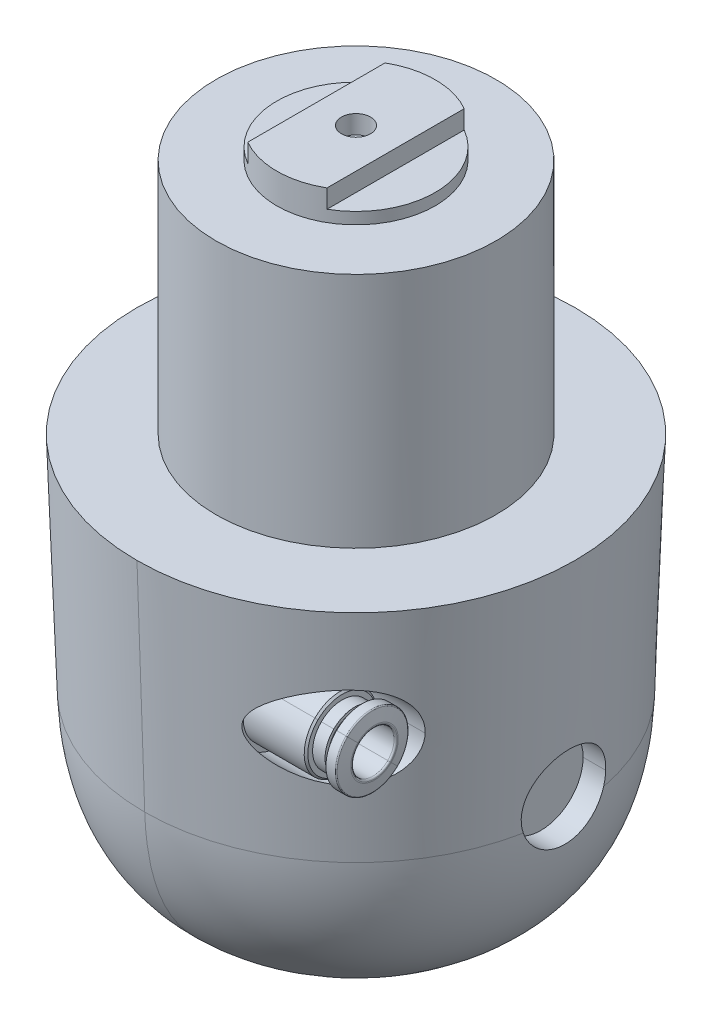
ISO-10303-21;
HEADER;
FILE_DESCRIPTION(('STEP AP214'),'2;1');
FILE_NAME('part.step','',(''),(''),'','','');
FILE_SCHEMA(('AUTOMOTIVE_DESIGN { 1 0 10303 214 1 1 1 1 }'));
ENDSEC;
DATA;
#1=APPLICATION_CONTEXT('core data for automotive mechanical design processes');
#2=APPLICATION_PROTOCOL_DEFINITION('international standard','automotive_design',2000,#1);
#3=PRODUCT_CONTEXT('',#1,'mechanical');
#4=PRODUCT('Part','Part','',(#3));
#5=PRODUCT_RELATED_PRODUCT_CATEGORY('part','',(#4));
#6=PRODUCT_DEFINITION_FORMATION('','',#4);
#7=PRODUCT_DEFINITION_CONTEXT('part definition',#1,'design');
#8=PRODUCT_DEFINITION('design','',#6,#7);
#9=PRODUCT_DEFINITION_SHAPE('','',#8);
#10=(LENGTH_UNIT() NAMED_UNIT(*) SI_UNIT(.MILLI.,.METRE.));
#11=(NAMED_UNIT(*) PLANE_ANGLE_UNIT() SI_UNIT($,.RADIAN.));
#12=(NAMED_UNIT(*) SI_UNIT($,.STERADIAN.) SOLID_ANGLE_UNIT());
#13=UNCERTAINTY_MEASURE_WITH_UNIT(LENGTH_MEASURE(1.E-05),#10,'distance_accuracy_value','');
#14=(GEOMETRIC_REPRESENTATION_CONTEXT(3) GLOBAL_UNCERTAINTY_ASSIGNED_CONTEXT((#13)) GLOBAL_UNIT_ASSIGNED_CONTEXT((#10,
#11,#12)) REPRESENTATION_CONTEXT('',''));
#15=CARTESIAN_POINT('',(0.,0.,0.));
#16=DIRECTION('',(0.,0.,1.));
#17=DIRECTION('',(1.,0.,0.));
#18=AXIS2_PLACEMENT_3D('',#15,#16,#17);
#19=CARTESIAN_POINT('',(41.4646055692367,-936.641128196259,27.4999270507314));
#20=DIRECTION('',(-0.999999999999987,0.,1.56103903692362E-07));
#21=DIRECTION('',(-1.56103903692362E-07,0.,-0.999999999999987));
#22=AXIS2_PLACEMENT_3D('',#19,#20,#21);
#23=CYLINDRICAL_SURFACE('',#22,8.);
#24=DIRECTION('',(-0.999999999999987,0.,1.56103903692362E-07));
#25=VECTOR('',#24,1.);
#26=CARTESIAN_POINT('',(41.464606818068,-936.641128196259,35.4999270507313));
#27=LINE('',#26,#25);
#28=CARTESIAN_POINT('',(39.2788684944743,-936.641128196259,35.4999273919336));
#29=VERTEX_POINT('',#28);
#30=CARTESIAN_POINT('',(34.9979344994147,-936.641128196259,35.4999280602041));
#31=VERTEX_POINT('',#30);
#32=EDGE_CURVE('E779',#29,#31,#27,.T.);
#33=ORIENTED_EDGE('',*,*,#32,.T.);
#34=CARTESIAN_POINT('',(34.9979332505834,-936.641128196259,27.4999280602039));
#35=DIRECTION('',(0.999999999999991,0.,-1.56103905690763E-07));
#36=DIRECTION('',(-1.56103905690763E-07,0.,-0.999999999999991));
#37=AXIS2_PLACEMENT_3D('',#34,#35,#36);
#38=CIRCLE('',#37,7.99999999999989);
#39=CARTESIAN_POINT('',(34.9979320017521,-936.641128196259,19.4999280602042));
#40=VERTEX_POINT('',#39);
#41=EDGE_CURVE('E388',#40,#31,#38,.T.);
#42=ORIENTED_EDGE('',*,*,#41,.F.);
#43=DIRECTION('',(-0.999999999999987,0.,1.56103903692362E-07));
#44=VECTOR('',#43,1.);
#45=CARTESIAN_POINT('',(41.4646043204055,-936.641128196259,19.4999270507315));
#46=LINE('',#45,#44);
#47=CARTESIAN_POINT('',(39.2788659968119,-936.641128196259,19.4999273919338));
#48=VERTEX_POINT('',#47);
#49=EDGE_CURVE('E805',#48,#40,#46,.T.);
#50=ORIENTED_EDGE('',*,*,#49,.F.);
#51=CARTESIAN_POINT('',(39.2788659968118,-936.641128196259,19.4999273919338));
#52=CARTESIAN_POINT('',(39.2834740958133,-936.511835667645,19.4999243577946));
#53=CARTESIAN_POINT('',(39.2887285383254,-936.382566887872,19.5030616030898));
#54=CARTESIAN_POINT('',(39.3005539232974,-936.122986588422,19.5156563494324));
#55=CARTESIAN_POINT('',(39.3071385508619,-935.992679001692,19.5251821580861));
#56=CARTESIAN_POINT('',(39.3216244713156,-935.73134535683,19.5507310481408));
#57=CARTESIAN_POINT('',(39.3295392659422,-935.600326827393,19.5668234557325));
#58=CARTESIAN_POINT('',(39.3466840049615,-935.337911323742,19.605663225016));
#59=CARTESIAN_POINT('',(39.355927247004,-935.206525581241,19.628480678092));
#60=CARTESIAN_POINT('',(39.375067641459,-934.952606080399,19.6791419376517));
#61=CARTESIAN_POINT('',(39.3848973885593,-934.829994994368,19.7066246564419));
#62=CARTESIAN_POINT('',(39.4058616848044,-934.58260436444,19.7682254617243));
#63=CARTESIAN_POINT('',(39.417026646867,-934.45787096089,19.8025186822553));
#64=CARTESIAN_POINT('',(39.4406628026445,-934.206663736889,19.8781761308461));
#65=CARTESIAN_POINT('',(39.4531627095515,-934.080246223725,19.9197182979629));
#66=CARTESIAN_POINT('',(39.4794649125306,-933.8261441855,20.0102963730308));
#67=CARTESIAN_POINT('',(39.4932942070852,-933.698526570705,20.0595124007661));
#68=CARTESIAN_POINT('',(39.5198686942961,-933.463858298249,20.1569887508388));
#69=CARTESIAN_POINT('',(39.5324921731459,-933.356442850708,20.2044070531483));
#70=CARTESIAN_POINT('',(39.5592584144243,-933.136023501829,20.3075621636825));
#71=CARTESIAN_POINT('',(39.5734445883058,-933.023190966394,20.3636544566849));
#72=CARTESIAN_POINT('',(39.6033364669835,-932.79270433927,20.4851039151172));
#73=CARTESIAN_POINT('',(39.6190796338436,-932.675250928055,20.5508327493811));
#74=CARTESIAN_POINT('',(39.6520931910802,-932.436421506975,20.692509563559));
#75=CARTESIAN_POINT('',(39.6693967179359,-932.31527829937,20.7688427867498));
#76=CARTESIAN_POINT('',(39.7013305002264,-932.098621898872,20.9136204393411));
#77=CARTESIAN_POINT('',(39.7158845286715,-932.002404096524,20.9810294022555));
#78=CARTESIAN_POINT('',(39.7390846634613,-931.852275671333,21.0912127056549));
#79=CARTESIAN_POINT('',(39.747680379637,-931.79735197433,21.1326231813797));
#80=CARTESIAN_POINT('',(39.7657602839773,-931.683291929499,21.2209498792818));
#81=CARTESIAN_POINT('',(39.7752493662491,-931.624267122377,21.2680091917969));
#82=CARTESIAN_POINT('',(39.7990728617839,-931.477917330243,21.3881180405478));
#83=CARTESIAN_POINT('',(39.8134188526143,-931.39145503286,21.4622214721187));
#84=CARTESIAN_POINT('',(39.8380151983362,-931.245863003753,21.5924947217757));
#85=CARTESIAN_POINT('',(39.8482719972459,-931.185942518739,21.6477830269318));
#86=CARTESIAN_POINT('',(39.8668707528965,-931.079018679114,21.7495095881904));
#87=CARTESIAN_POINT('',(39.875207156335,-931.031719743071,21.7956389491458));
#88=CARTESIAN_POINT('',(39.9022166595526,-930.879523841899,21.9477970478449));
#89=CARTESIAN_POINT('',(39.920709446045,-930.776970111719,22.056224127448));
#90=CARTESIAN_POINT('',(39.955767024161,-930.586532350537,22.2692000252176));
#91=CARTESIAN_POINT('',(39.9723619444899,-930.498142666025,22.3732934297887));
#92=CARTESIAN_POINT('',(40.0035742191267,-930.334743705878,22.5760214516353));
#93=CARTESIAN_POINT('',(40.0182319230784,-930.259254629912,22.6742629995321));
#94=CARTESIAN_POINT('',(40.0455620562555,-930.12039564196,22.8639365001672));
#95=CARTESIAN_POINT('',(40.0582839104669,-930.056576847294,22.9550333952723));
#96=CARTESIAN_POINT('',(40.0862441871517,-929.917563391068,23.1625473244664));
#97=CARTESIAN_POINT('',(40.1013340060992,-929.843420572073,23.2796917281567));
#98=CARTESIAN_POINT('',(40.1300774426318,-929.703939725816,23.5132963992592));
#99=CARTESIAN_POINT('',(40.1437636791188,-929.638375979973,23.6296180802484));
#100=CARTESIAN_POINT('',(40.1696838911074,-929.515544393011,23.8608990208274));
#101=CARTESIAN_POINT('',(40.1819536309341,-929.45805320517,23.9757356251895));
#102=CARTESIAN_POINT('',(40.2050466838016,-929.350839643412,24.2034316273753));
#103=CARTESIAN_POINT('',(40.215908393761,-929.300897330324,24.3161836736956));
#104=CARTESIAN_POINT('',(40.2376978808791,-929.201206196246,24.5560894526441));
#105=CARTESIAN_POINT('',(40.2485095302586,-929.152044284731,24.683498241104));
#106=CARTESIAN_POINT('',(40.268673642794,-929.060823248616,24.939226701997));
#107=CARTESIAN_POINT('',(40.2780419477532,-929.018686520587,25.0675174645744));
#108=CARTESIAN_POINT('',(40.2953252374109,-928.941402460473,25.3246056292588));
#109=CARTESIAN_POINT('',(40.3032562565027,-928.906177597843,25.4533786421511));
#110=CARTESIAN_POINT('',(40.3176630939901,-928.842583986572,25.7110434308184));
#111=CARTESIAN_POINT('',(40.3241552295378,-928.814138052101,25.8399152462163));
#112=CARTESIAN_POINT('',(40.3356844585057,-928.763949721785,26.0974091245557));
#113=CARTESIAN_POINT('',(40.3407381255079,-928.742130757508,26.2260155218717));
#114=CARTESIAN_POINT('',(40.3493900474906,-928.705026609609,26.4826293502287));
#115=CARTESIAN_POINT('',(40.3530051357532,-928.689665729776,26.6106252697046));
#116=CARTESIAN_POINT('',(40.3587796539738,-928.665292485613,26.8656888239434));
#117=CARTESIAN_POINT('',(40.3609561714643,-928.65620553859,26.9927489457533));
#118=CARTESIAN_POINT('',(40.3638533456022,-928.644181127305,27.2456316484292));
#119=CARTESIAN_POINT('',(40.3645913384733,-928.641170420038,27.3714505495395));
#120=CARTESIAN_POINT('',(40.3646111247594,-928.641086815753,27.6232078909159));
#121=CARTESIAN_POINT('',(40.3638915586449,-928.644019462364,27.7491463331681));
#122=CARTESIAN_POINT('',(40.3610283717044,-928.655898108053,28.0022719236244));
#123=CARTESIAN_POINT('',(40.3588673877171,-928.664917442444,28.1294554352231));
#124=CARTESIAN_POINT('',(40.3531211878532,-928.689166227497,28.38476889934));
#125=CARTESIAN_POINT('',(40.3495188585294,-928.704470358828,28.5128913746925));
#126=CARTESIAN_POINT('',(40.340889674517,-928.741472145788,28.769760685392));
#127=CARTESIAN_POINT('',(40.3358459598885,-928.763245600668,28.8984960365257));
#128=CARTESIAN_POINT('',(40.3243338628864,-928.813354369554,29.1562493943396));
#129=CARTESIAN_POINT('',(40.3178488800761,-928.841766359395,29.2852517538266));
#130=CARTESIAN_POINT('',(40.3034535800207,-928.905303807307,29.5431783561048));
#131=CARTESIAN_POINT('',(40.2955269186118,-928.940506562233,29.6720826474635));
#132=CARTESIAN_POINT('',(40.2782495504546,-929.017758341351,29.9294332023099));
#133=CARTESIAN_POINT('',(40.2688827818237,-929.059885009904,30.0578550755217));
#134=CARTESIAN_POINT('',(40.2487190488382,-929.151098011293,30.3138446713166));
#135=CARTESIAN_POINT('',(40.2379062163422,-929.200262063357,30.4413834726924));
#136=CARTESIAN_POINT('',(40.2161089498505,-929.299980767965,30.6815622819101));
#137=CARTESIAN_POINT('',(40.2052406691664,-929.349948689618,30.7944570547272));
#138=CARTESIAN_POINT('',(40.1821303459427,-929.457232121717,31.0224506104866));
#139=CARTESIAN_POINT('',(40.1698497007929,-929.51476860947,31.1374416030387));
#140=CARTESIAN_POINT('',(40.1439035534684,-929.637712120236,31.3690411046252));
#141=CARTESIAN_POINT('',(40.1302021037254,-929.703343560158,31.4855264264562));
#142=CARTESIAN_POINT('',(40.1014243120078,-929.842983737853,31.7194654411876));
#143=CARTESIAN_POINT('',(40.0863151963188,-929.917219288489,31.8367799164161));
#144=CARTESIAN_POINT('',(40.0583106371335,-930.056448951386,32.0446411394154));
#145=CARTESIAN_POINT('',(40.0455640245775,-930.120390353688,32.135915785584));
#146=CARTESIAN_POINT('',(40.0181716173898,-930.259565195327,32.3260102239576));
#147=CARTESIAN_POINT('',(40.003475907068,-930.335251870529,32.4244916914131));
#148=CARTESIAN_POINT('',(39.9721751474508,-930.499128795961,32.6277533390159));
#149=CARTESIAN_POINT('',(39.9555294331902,-930.587803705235,32.7321363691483));
#150=CARTESIAN_POINT('',(39.9203566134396,-930.778907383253,32.9457303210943));
#151=CARTESIAN_POINT('',(39.9017990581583,-930.881847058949,33.0544808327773));
#152=CARTESIAN_POINT('',(39.8747071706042,-931.034574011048,33.2070227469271));
#153=CARTESIAN_POINT('',(39.8663522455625,-931.082002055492,33.2532308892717));
#154=CARTESIAN_POINT('',(39.8477461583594,-931.189021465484,33.3549388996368));
#155=CARTESIAN_POINT('',(39.8375003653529,-931.248903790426,33.410134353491));
#156=CARTESIAN_POINT('',(39.8129397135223,-931.394343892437,33.540139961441));
#157=CARTESIAN_POINT('',(39.7986184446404,-931.480688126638,33.6140725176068));
#158=CARTESIAN_POINT('',(39.7749259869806,-931.626280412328,33.7334554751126));
#159=CARTESIAN_POINT('',(39.7655429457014,-931.684656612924,33.7799719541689));
#160=CARTESIAN_POINT('',(39.7476445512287,-931.797580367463,33.8673986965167));
#161=CARTESIAN_POINT('',(39.7391244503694,-931.852021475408,33.9084455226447));
#162=CARTESIAN_POINT('',(39.7160600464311,-932.001259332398,34.0180017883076));
#163=CARTESIAN_POINT('',(39.7015662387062,-932.097065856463,34.0851521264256));
#164=CARTESIAN_POINT('',(39.6695985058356,-932.313888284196,34.2301340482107));
#165=CARTESIAN_POINT('',(39.6522040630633,-932.435643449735,34.3068800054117));
#166=CARTESIAN_POINT('',(39.619023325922,-932.675678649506,34.4492789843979));
#167=CARTESIAN_POINT('',(39.6032034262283,-932.793722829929,34.5153222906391));
#168=CARTESIAN_POINT('',(39.5731719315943,-933.025359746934,34.6373099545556));
#169=CARTESIAN_POINT('',(39.5589223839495,-933.138749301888,34.6936308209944));
#170=CARTESIAN_POINT('',(39.5320435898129,-933.360240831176,34.7971650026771));
#171=CARTESIAN_POINT('',(39.519370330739,-933.46816942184,34.8447383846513));
#172=CARTESIAN_POINT('',(39.4928452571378,-933.702647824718,34.941956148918));
#173=CARTESIAN_POINT('',(39.4791067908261,-933.829536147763,34.990817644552));
#174=CARTESIAN_POINT('',(39.4529702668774,-934.082197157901,35.0807820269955));
#175=CARTESIAN_POINT('',(39.4405457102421,-934.207904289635,35.1220615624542));
#176=CARTESIAN_POINT('',(39.4170443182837,-934.45771718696,35.1972806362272));
#177=CARTESIAN_POINT('',(39.4059393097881,-934.581767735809,35.2313947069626));
#178=CARTESIAN_POINT('',(39.3850787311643,-934.827826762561,35.292715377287));
#179=CARTESIAN_POINT('',(39.3752933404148,-934.949789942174,35.3200937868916));
#180=CARTESIAN_POINT('',(39.3561583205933,-935.203340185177,35.3707979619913));
#181=CARTESIAN_POINT('',(39.3468844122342,-935.335014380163,35.3937178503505));
#182=CARTESIAN_POINT('',(39.3296843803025,-935.59800904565,35.4327318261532));
#183=CARTESIAN_POINT('',(39.321744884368,-935.729318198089,35.4488963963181));
#184=CARTESIAN_POINT('',(39.3072153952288,-935.991233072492,35.474559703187));
#185=CARTESIAN_POINT('',(39.300611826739,-936.121831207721,35.4841281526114));
#186=CARTESIAN_POINT('',(39.2887544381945,-936.381990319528,35.496779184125));
#187=CARTESIAN_POINT('',(39.2834868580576,-936.511547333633,35.4999304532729));
#188=CARTESIAN_POINT('',(39.2788684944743,-936.641128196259,35.4999273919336));
#189=B_SPLINE_CURVE_WITH_KNOTS('',3,(#51,#52,#53,#54,#55,#56,#57,#58,#59,#60,#61,#62,#63,#64,
#65,#66,#67,#68,#69,#70,#71,#72,#73,#74,#75,#76,#77,#78,#79,#80,#81,#82,#83,#84,#85,#86,#87,#88,
#89,#90,#91,#92,#93,#94,#95,#96,#97,#98,#99,#100,#101,#102,#103,#104,#105,#106,#107,#108,#109,
#110,#111,#112,#113,#114,#115,#116,#117,#118,#119,#120,#121,#122,#123,#124,#125,#126,#127,#128,
#129,#130,#131,#132,#133,#134,#135,#136,#137,#138,#139,#140,#141,#142,#143,#144,#145,#146,#147,
#148,#149,#150,#151,#152,#153,#154,#155,#156,#157,#158,#159,#160,#161,#162,#163,#164,#165,#166,
#167,#168,#169,#170,#171,#172,#173,#174,#175,#176,#177,#178,#179,#180,#181,#182,#183,#184,#185,
#186,#187,#188),.UNSPECIFIED.,.F.,.F.,(4,2,2,2,2,2,2,2,2,2,2,2,2,2,2,2,2,2,2,2,2,2,2,2,2,2,2,2,
2,2,2,2,2,2,2,2,2,2,2,2,2,2,2,2,2,2,2,2,2,2,2,2,2,2,2,2,2,2,2,2,2,2,2,2,2,2,2,2,4),(0.,
0.388083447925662,0.780383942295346,1.17693791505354,1.57778063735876,1.95575159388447,
2.34512293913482,2.74591817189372,3.15815881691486,3.51232744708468,3.89259095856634,
4.29895673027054,4.73143056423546,5.08645226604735,5.29439289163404,5.52261271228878,
5.86681862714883,6.11330180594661,6.3130649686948,6.76396079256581,7.17647846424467,
7.55061915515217,7.88638543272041,8.30455276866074,8.70706428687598,9.09393726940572,
9.46519124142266,9.87597842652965,10.2818743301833,10.682918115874,11.0791503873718,
11.4706132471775,11.8573503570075,12.2394070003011,12.6168301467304,12.9946054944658,
13.3770157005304,13.7641078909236,14.1559275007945,14.5525183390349,14.9539226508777,
15.3601811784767,15.7713332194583,16.1430094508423,16.5303578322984,16.9333979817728,
17.3521472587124,17.6885650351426,18.0636435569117,18.4773853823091,18.9297916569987,
19.1300005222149,19.3762088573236,19.7198082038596,19.9454725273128,20.1515867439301,
20.5051432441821,20.9398435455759,21.3482273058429,21.7303004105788,22.086070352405,
22.4958754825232,22.8943916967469,23.2816401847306,23.6576440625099,24.0593947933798,
24.4568423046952,24.8500220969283,25.2389708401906),.UNSPECIFIED.);
#190=EDGE_CURVE('E589',#48,#29,#189,.T.);
#191=ORIENTED_EDGE('',*,*,#190,.T.);
#192=EDGE_LOOP('',(#33,#42,#50,#191));
#193=FACE_BOUND('',#192,.T.);
#194=ADVANCED_FACE('F16',(#193),#23,.F.);
#195=CARTESIAN_POINT('',(41.4646055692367,-936.641128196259,27.4999270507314));
#196=DIRECTION('',(-0.999999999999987,0.,1.56103903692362E-07));
#197=DIRECTION('',(-1.56103903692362E-07,0.,-0.999999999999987));
#198=AXIS2_PLACEMENT_3D('',#195,#196,#197);
#199=CYLINDRICAL_SURFACE('',#198,8.);
#200=ORIENTED_EDGE('',*,*,#49,.T.);
#201=EDGE_CURVE('E386',#31,#40,#38,.T.);
#202=ORIENTED_EDGE('',*,*,#201,.F.);
#203=ORIENTED_EDGE('',*,*,#32,.F.);
#204=CARTESIAN_POINT('',(39.2788684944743,-936.641128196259,35.4999273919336));
#205=CARTESIAN_POINT('',(39.2751744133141,-936.744786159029,35.4999286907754));
#206=CARTESIAN_POINT('',(39.2719050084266,-936.848459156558,35.497912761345));
#207=CARTESIAN_POINT('',(39.2661835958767,-937.056296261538,35.4898279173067));
#208=CARTESIAN_POINT('',(39.2637366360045,-937.160459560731,35.4837346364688));
#209=CARTESIAN_POINT('',(39.2596600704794,-937.369114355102,35.4674272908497));
#210=CARTESIAN_POINT('',(39.2580355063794,-937.473604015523,35.457188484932));
#211=CARTESIAN_POINT('',(39.2556037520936,-937.682743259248,35.4325304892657));
#212=CARTESIAN_POINT('',(39.2548015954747,-937.787389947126,35.4180862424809));
#213=CARTESIAN_POINT('',(39.2540146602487,-937.996669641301,35.3849638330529));
#214=CARTESIAN_POINT('',(39.254034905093,-938.101298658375,35.3662603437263));
#215=CARTESIAN_POINT('',(39.2548927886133,-938.310364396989,35.3245732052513));
#216=CARTESIAN_POINT('',(39.2557354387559,-938.414796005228,35.3015640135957));
#217=CARTESIAN_POINT('',(39.2582381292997,-938.623283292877,35.2512260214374));
#218=CARTESIAN_POINT('',(39.2599031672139,-938.727332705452,35.2238715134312));
#219=CARTESIAN_POINT('',(39.2640507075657,-938.934868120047,35.1648132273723));
#220=CARTESIAN_POINT('',(39.2665381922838,-939.038346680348,35.1330836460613));
#221=CARTESIAN_POINT('',(39.2694253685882,-939.14112819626,35.099269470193));
#222=B_SPLINE_CURVE_WITH_KNOTS('',3,(#204,#205,#206,#207,#208,#209,#210,#211,#212,#213,#214,
#215,#216,#217,#218,#219,#220,#221),.UNSPECIFIED.,.F.,.F.,(4,2,2,2,2,2,2,2,4),(0.,
0.31115075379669,0.624177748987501,0.939101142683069,1.25594072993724,1.57471594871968,
1.89544588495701,2.21814927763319,2.54284452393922),.UNSPECIFIED.);
#223=CARTESIAN_POINT('',(39.2694253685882,-939.141128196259,35.099269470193));
#224=VERTEX_POINT('',#223);
#225=EDGE_CURVE('E812',#29,#224,#222,.T.);
#226=ORIENTED_EDGE('',*,*,#225,.T.);
#227=CARTESIAN_POINT('',(39.2694229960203,-939.14112819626,19.9005853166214));
#228=CARTESIAN_POINT('',(39.272241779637,-939.241507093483,19.9336025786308));
#229=CARTESIAN_POINT('',(39.2751741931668,-939.341246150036,19.9685630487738));
#230=CARTESIAN_POINT('',(39.2812369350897,-939.538688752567,20.0421488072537));
#231=CARTESIAN_POINT('',(39.2843659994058,-939.636400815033,20.0807513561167));
#232=CARTESIAN_POINT('',(39.2908125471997,-939.829810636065,20.161617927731));
#233=CARTESIAN_POINT('',(39.2941291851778,-939.925515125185,20.2038659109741));
#234=CARTESIAN_POINT('',(39.3009366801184,-940.114931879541,20.2920129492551));
#235=CARTESIAN_POINT('',(39.3044270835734,-940.20864850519,20.3379026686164));
#236=CARTESIAN_POINT('',(39.3115650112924,-940.39411168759,20.4333250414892));
#237=CARTESIAN_POINT('',(39.315212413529,-940.485859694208,20.4828548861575));
#238=CARTESIAN_POINT('',(39.3226438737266,-940.667408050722,20.5855492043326));
#239=CARTESIAN_POINT('',(39.3264280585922,-940.757206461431,20.6387170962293));
#240=CARTESIAN_POINT('',(39.3341094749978,-940.934878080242,20.7486801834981));
#241=CARTESIAN_POINT('',(39.3380069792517,-941.022745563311,20.8054846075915));
#242=CARTESIAN_POINT('',(39.3458879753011,-941.196578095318,20.9227128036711));
#243=CARTESIAN_POINT('',(39.3498717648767,-941.282533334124,20.9831510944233));
#244=CARTESIAN_POINT('',(39.357895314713,-941.452550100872,21.1076347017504));
#245=CARTESIAN_POINT('',(39.3619352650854,-941.536597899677,21.1716987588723));
#246=CARTESIAN_POINT('',(39.3700093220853,-941.701541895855,21.3026257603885));
#247=CARTESIAN_POINT('',(39.3740432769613,-941.782455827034,21.3694663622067));
#248=CARTESIAN_POINT('',(39.3820966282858,-941.941167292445,21.5059357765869));
#249=CARTESIAN_POINT('',(39.3861159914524,-942.018978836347,21.5755482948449));
#250=CARTESIAN_POINT('',(39.3941288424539,-942.171519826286,21.7175525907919));
#251=CARTESIAN_POINT('',(39.3981223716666,-942.246259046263,21.7899338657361));
#252=CARTESIAN_POINT('',(39.4060693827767,-942.39268914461,21.9374672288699));
#253=CARTESIAN_POINT('',(39.4100229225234,-942.46438512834,22.0126142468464));
#254=CARTESIAN_POINT('',(39.4178729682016,-942.604761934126,22.1656713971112));
#255=CARTESIAN_POINT('',(39.4217694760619,-942.67344285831,22.2435814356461));
#256=CARTESIAN_POINT('',(39.4294858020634,-942.807821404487,22.4021583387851));
#257=CARTESIAN_POINT('',(39.4333054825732,-942.873513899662,22.4828295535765));
#258=CARTESIAN_POINT('',(39.4408452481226,-943.001948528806,22.6469213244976));
#259=CARTESIAN_POINT('',(39.4445649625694,-943.064680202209,22.7303500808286));
#260=CARTESIAN_POINT('',(39.4519087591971,-943.187685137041,22.9006052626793));
#261=CARTESIAN_POINT('',(39.4555310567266,-943.247917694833,22.9874611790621));
#262=CARTESIAN_POINT('',(39.4625993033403,-943.364526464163,23.1628824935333));
#263=CARTESIAN_POINT('',(39.4660462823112,-943.420926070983,23.2514322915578));
#264=CARTESIAN_POINT('',(39.472761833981,-943.529905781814,23.4302335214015));
#265=CARTESIAN_POINT('',(39.4760312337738,-943.582504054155,23.5204738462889));
#266=CARTESIAN_POINT('',(39.4823873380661,-943.683914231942,23.7026511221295));
#267=CARTESIAN_POINT('',(39.4854746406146,-943.732738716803,23.7945810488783));
#268=CARTESIAN_POINT('',(39.4914594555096,-943.826633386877,23.9801330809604));
#269=CARTESIAN_POINT('',(39.4943573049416,-943.871710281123,24.0737517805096));
#270=CARTESIAN_POINT('',(39.4999534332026,-943.958140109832,24.2626779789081));
#271=CARTESIAN_POINT('',(39.502651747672,-943.999493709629,24.3579851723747));
#272=CARTESIAN_POINT('',(39.507836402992,-944.078504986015,24.5502862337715));
#273=CARTESIAN_POINT('',(39.510322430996,-944.116157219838,24.6472823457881));
#274=CARTESIAN_POINT('',(39.5150670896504,-944.187793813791,24.842958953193));
#275=CARTESIAN_POINT('',(39.5173250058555,-944.221766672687,24.941643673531));
#276=CARTESIAN_POINT('',(39.5216057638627,-944.286202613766,25.1411318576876));
#277=CARTESIAN_POINT('',(39.5236263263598,-944.316631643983,25.2419463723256));
#278=CARTESIAN_POINT('',(39.5273983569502,-944.373358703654,25.4441370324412));
#279=CARTESIAN_POINT('',(39.529151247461,-944.399678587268,25.5455070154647));
#280=CARTESIAN_POINT('',(39.5323924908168,-944.448210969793,25.7488070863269));
#281=CARTESIAN_POINT('',(39.5338818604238,-944.470439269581,25.8507333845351));
#282=CARTESIAN_POINT('',(39.5365981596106,-944.510807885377,26.0551463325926));
#283=CARTESIAN_POINT('',(39.5378256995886,-944.528957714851,26.1576310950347));
#284=CARTESIAN_POINT('',(39.5400175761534,-944.561187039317,26.3631618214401));
#285=CARTESIAN_POINT('',(39.5409821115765,-944.575269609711,26.4662073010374));
#286=CARTESIAN_POINT('',(39.542644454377,-944.599379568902,26.6728611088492));
#287=CARTESIAN_POINT('',(39.5433420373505,-944.609403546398,26.776469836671));
#288=CARTESIAN_POINT('',(39.5444641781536,-944.62540892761,26.9842525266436));
#289=CARTESIAN_POINT('',(39.5448880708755,-944.63138048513,27.0884272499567));
#290=CARTESIAN_POINT('',(39.5454537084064,-944.639291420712,27.2973445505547));
#291=CARTESIAN_POINT('',(39.5455943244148,-944.641214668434,27.4020877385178));
#292=CARTESIAN_POINT('',(39.5455817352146,-944.641035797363,27.6115382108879));
#293=CARTESIAN_POINT('',(39.5454286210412,-944.638934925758,27.7162454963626));
#294=CARTESIAN_POINT('',(39.5448384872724,-944.630670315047,27.9250887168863));
#295=CARTESIAN_POINT('',(39.5444025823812,-944.624522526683,28.0292252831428));
#296=CARTESIAN_POINT('',(39.5432567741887,-944.608166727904,28.2369293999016));
#297=CARTESIAN_POINT('',(39.5425475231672,-944.597968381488,28.3404977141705));
#298=CARTESIAN_POINT('',(39.5408621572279,-944.573511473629,28.5470684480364));
#299=CARTESIAN_POINT('',(39.5398862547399,-944.559256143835,28.6500712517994));
#300=CARTESIAN_POINT('',(39.5376718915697,-944.526683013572,28.8555143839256));
#301=CARTESIAN_POINT('',(39.5364332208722,-944.508361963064,28.9579541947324));
#302=CARTESIAN_POINT('',(39.5336948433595,-944.467652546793,29.1622750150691));
#303=CARTESIAN_POINT('',(39.5321945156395,-944.44525450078,29.2641540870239));
#304=CARTESIAN_POINT('',(39.5289315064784,-944.396383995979,29.4673574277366));
#305=CARTESIAN_POINT('',(39.5271677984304,-944.36989557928,29.5686778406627));
#306=CARTESIAN_POINT('',(39.523374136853,-944.312833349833,29.7707672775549));
#307=CARTESIAN_POINT('',(39.5213427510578,-944.282237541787,29.8715300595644));
#308=CARTESIAN_POINT('',(39.5170422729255,-944.217492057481,30.0708452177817));
#309=CARTESIAN_POINT('',(39.5147756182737,-944.18337884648,30.1694094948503));
#310=CARTESIAN_POINT('',(39.5100144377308,-944.111465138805,30.3648460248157));
#311=CARTESIAN_POINT('',(39.507520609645,-944.073675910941,30.4617224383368));
#312=CARTESIAN_POINT('',(39.5023210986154,-943.994394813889,30.6537851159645));
#313=CARTESIAN_POINT('',(39.499615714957,-943.952908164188,30.7489735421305));
#314=CARTESIAN_POINT('',(39.4940061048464,-943.866216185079,30.9376631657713));
#315=CARTESIAN_POINT('',(39.4911018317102,-943.821009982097,31.0311639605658));
#316=CARTESIAN_POINT('',(39.4851047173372,-943.726860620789,31.2164811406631));
#317=CARTESIAN_POINT('',(39.4820115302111,-943.677910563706,31.3082940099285));
#318=CARTESIAN_POINT('',(39.4756440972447,-943.576253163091,31.490238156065));
#319=CARTESIAN_POINT('',(39.4723692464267,-943.523533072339,31.5803622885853));
#320=CARTESIAN_POINT('',(39.4656431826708,-943.414313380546,31.7589319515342));
#321=CARTESIAN_POINT('',(39.4621911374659,-943.357795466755,31.847366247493));
#322=CARTESIAN_POINT('',(39.4551129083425,-943.240954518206,32.0225579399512));
#323=CARTESIAN_POINT('',(39.4514856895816,-943.18060797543,32.1092996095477));
#324=CARTESIAN_POINT('',(39.4441353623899,-943.057421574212,32.2792686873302));
#325=CARTESIAN_POINT('',(39.4404141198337,-942.994624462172,32.3625271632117));
#326=CARTESIAN_POINT('',(39.4328725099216,-942.86606162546,32.5262826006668));
#327=CARTESIAN_POINT('',(39.4290525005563,-942.800306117,32.6067875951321));
#328=CARTESIAN_POINT('',(39.4213363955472,-942.665805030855,32.7650368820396));
#329=CARTESIAN_POINT('',(39.4174404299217,-942.597064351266,32.8427853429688));
#330=CARTESIAN_POINT('',(39.4095922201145,-942.45657130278,32.9955240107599));
#331=CARTESIAN_POINT('',(39.4056399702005,-942.38481862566,33.0705139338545));
#332=CARTESIAN_POINT('',(39.3976961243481,-942.238278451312,33.2177378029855));
#333=CARTESIAN_POINT('',(39.3937044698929,-942.163485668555,33.2899664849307));
#334=CARTESIAN_POINT('',(39.3856957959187,-942.010840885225,33.4316703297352));
#335=CARTESIAN_POINT('',(39.3816787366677,-941.93297895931,33.5011347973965));
#336=CARTESIAN_POINT('',(39.3736303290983,-941.774169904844,33.6373126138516));
#337=CARTESIAN_POINT('',(39.3695990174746,-941.693208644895,33.704009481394));
#338=CARTESIAN_POINT('',(39.3615302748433,-941.528173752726,33.8346543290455));
#339=CARTESIAN_POINT('',(39.3574929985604,-941.444082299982,33.8985797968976));
#340=CARTESIAN_POINT('',(39.34949105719,-941.274313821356,34.0225468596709));
#341=CARTESIAN_POINT('',(39.3455260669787,-941.188659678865,34.0826197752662));
#342=CARTESIAN_POINT('',(39.3376829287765,-941.015444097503,34.1991472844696));
#343=CARTESIAN_POINT('',(39.3338044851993,-940.92789221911,34.2556160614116));
#344=CARTESIAN_POINT('',(39.3261608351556,-940.750867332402,34.3649386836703));
#345=CARTESIAN_POINT('',(39.3223953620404,-940.661399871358,34.4178014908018));
#346=CARTESIAN_POINT('',(39.3150006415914,-940.480528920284,34.5199161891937));
#347=CARTESIAN_POINT('',(39.3113712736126,-940.389127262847,34.5691713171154));
#348=CARTESIAN_POINT('',(39.3042683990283,-940.204372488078,34.6640747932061));
#349=CARTESIAN_POINT('',(39.3007950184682,-940.111017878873,34.7097202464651));
#350=CARTESIAN_POINT('',(39.2940202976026,-939.922341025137,34.7974091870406));
#351=CARTESIAN_POINT('',(39.290719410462,-939.827014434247,34.8394433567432));
#352=CARTESIAN_POINT('',(39.2843028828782,-939.634376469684,34.9199126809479));
#353=CARTESIAN_POINT('',(39.2811880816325,-939.537058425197,34.958331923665));
#354=CARTESIAN_POINT('',(39.2751522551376,-939.340420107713,35.0315812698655));
#355=CARTESIAN_POINT('',(39.2722324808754,-939.241091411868,35.0663888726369));
#356=CARTESIAN_POINT('',(39.2694253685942,-939.14112819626,35.0992694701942));
#357=B_SPLINE_CURVE_WITH_KNOTS('',3,(#227,#228,#229,#230,#231,#232,#233,#234,#235,#236,#237,
#238,#239,#240,#241,#242,#243,#244,#245,#246,#247,#248,#249,#250,#251,#252,#253,#254,#255,#256,
#257,#258,#259,#260,#261,#262,#263,#264,#265,#266,#267,#268,#269,#270,#271,#272,#273,#274,#275,
#276,#277,#278,#279,#280,#281,#282,#283,#284,#285,#286,#287,#288,#289,#290,#291,#292,#293,#294,
#295,#296,#297,#298,#299,#300,#301,#302,#303,#304,#305,#306,#307,#308,#309,#310,#311,#312,#313,
#314,#315,#316,#317,#318,#319,#320,#321,#322,#323,#324,#325,#326,#327,#328,#329,#330,#331,#332,
#333,#334,#335,#336,#337,#338,#339,#340,#341,#342,#343,#344,#345,#346,#347,#348,#349,#350,#351,
#352,#353,#354,#355,#356),.UNSPECIFIED.,.F.,.F.,(4,2,2,2,2,2,2,2,2,2,2,2,2,2,2,2,2,2,2,2,2,2,2,
2,2,2,2,2,2,2,2,2,2,2,2,2,2,2,2,2,2,2,2,2,2,2,2,2,2,2,2,2,2,2,2,2,2,2,2,2,2,2,2,2,4),(0.,
0.317105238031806,0.632347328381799,0.946266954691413,1.25940633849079,1.57230658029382,
1.88550497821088,2.19953239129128,2.51491071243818,2.83210228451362,3.14710694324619,
3.46047464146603,3.77275298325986,4.08448487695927,4.39620620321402,4.70844355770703,
5.02171212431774,5.33890989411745,5.6539551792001,5.96737858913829,6.27970763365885,
6.59146492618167,6.9031663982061,7.21531957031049,7.52842192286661,7.84432031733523,
8.15847676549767,8.47139331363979,8.78357219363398,9.09551440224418,9.40771826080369,
9.72067799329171,10.0348823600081,10.3489893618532,10.661865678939,10.9739999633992,
11.2858863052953,11.5980228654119,11.9109104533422,12.2250510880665,12.5409465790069,
12.8538454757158,13.1658137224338,13.4773483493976,13.788956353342,14.1011530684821,
14.414460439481,14.729405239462,15.0465172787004,15.3594963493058,15.6714670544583,
15.982943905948,16.2944527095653,16.6065284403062,16.9197129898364,17.2345528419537,
17.5515967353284,17.8656057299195,18.1782912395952,18.4901689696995,18.8017633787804,
19.1136052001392,19.4262288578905,19.740169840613,20.0559620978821),.UNSPECIFIED.);
#358=CARTESIAN_POINT('',(39.2694229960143,-939.141128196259,19.9005853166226));
#359=VERTEX_POINT('',#358);
#360=EDGE_CURVE('E815',#224,#359,#357,.F.);
#361=ORIENTED_EDGE('',*,*,#360,.T.);
#362=CARTESIAN_POINT('',(39.2694229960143,-939.14112819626,19.9005853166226));
#363=CARTESIAN_POINT('',(39.2665358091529,-939.038346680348,19.8667711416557));
#364=CARTESIAN_POINT('',(39.2640483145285,-938.934868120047,19.8350415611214));
#365=CARTESIAN_POINT('',(39.2599007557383,-938.727332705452,19.7759832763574));
#366=CARTESIAN_POINT('',(39.2582357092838,-938.623283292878,19.748628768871));
#367=CARTESIAN_POINT('',(39.255733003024,-938.414796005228,19.6982907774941));
#368=CARTESIAN_POINT('',(39.2548903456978,-938.310364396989,19.6752815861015));
#369=CARTESIAN_POINT('',(39.2540324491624,-938.101298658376,19.6335944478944));
#370=CARTESIAN_POINT('',(39.2540121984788,-937.996669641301,19.6148909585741));
#371=CARTESIAN_POINT('',(39.2547991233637,-937.787389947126,19.5817685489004));
#372=CARTESIAN_POINT('',(39.255601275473,-937.682743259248,19.5673243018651));
#373=CARTESIAN_POINT('',(39.2580330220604,-937.473604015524,19.5426663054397));
#374=CARTESIAN_POINT('',(39.2596575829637,-937.369114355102,19.5324274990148));
#375=CARTESIAN_POINT('',(39.2637341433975,-937.160459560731,19.5161201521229));
#376=CARTESIAN_POINT('',(39.2661811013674,-937.056296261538,19.510026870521));
#377=CARTESIAN_POINT('',(39.2719025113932,-936.848459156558,19.5019420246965));
#378=CARTESIAN_POINT('',(39.2751719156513,-936.744786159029,19.4999260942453));
#379=CARTESIAN_POINT('',(39.2788659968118,-936.641128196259,19.4999273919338));
#380=B_SPLINE_CURVE_WITH_KNOTS('',3,(#362,#363,#364,#365,#366,#367,#368,#369,#370,#371,#372,
#373,#374,#375,#376,#377,#378,#379),.UNSPECIFIED.,.F.,.F.,(4,2,2,2,2,2,2,2,4),(0.,
0.324695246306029,0.647398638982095,0.968128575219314,1.28690379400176,1.60374338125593,
1.9186667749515,2.23169377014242,2.54284452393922),.UNSPECIFIED.);
#381=EDGE_CURVE('E820',#359,#48,#380,.T.);
#382=ORIENTED_EDGE('',*,*,#381,.T.);
#383=EDGE_LOOP('',(#200,#202,#203,#226,#361,#382));
#384=FACE_BOUND('',#383,.T.);
#385=ADVANCED_FACE('F504',(#384),#199,.F.);
#386=CARTESIAN_POINT('',(-16.102066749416,-852.241128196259,27.4999360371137));
#387=DIRECTION('',(0.,1.,0.));
#388=DIRECTION('',(-0.999999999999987,0.,1.56103903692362E-07));
#389=AXIS2_PLACEMENT_3D('',#386,#387,#388);
#390=PLANE('',#389);
#391=CARTESIAN_POINT('',(-0.00206674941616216,-852.241128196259,27.4999335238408));
#392=DIRECTION('',(0.,1.,0.));
#393=DIRECTION('',(0.866025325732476,0.,-0.50000013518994));
#394=AXIS2_PLACEMENT_3D('',#391,#392,#393);
#395=CIRCLE('',#394,15.);
#396=CARTESIAN_POINT('',(12.988313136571,-852.241128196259,19.9999314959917));
#397=VERTEX_POINT('',#396);
#398=EDGE_CURVE('E424',#397,#397,#395,.T.);
#399=ORIENTED_EDGE('',*,*,#398,.F.);
#400=EDGE_LOOP('',(#399));
#401=FACE_BOUND('',#400,.T.);
#402=CARTESIAN_POINT('',(-0.00206674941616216,-852.241128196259,27.4999335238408));
#403=DIRECTION('',(0.,-1.,0.));
#404=DIRECTION('',(1.56103903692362E-07,0.,0.999999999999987));
#405=AXIS2_PLACEMENT_3D('',#402,#403,#404);
#406=CIRCLE('',#405,26.5);
#407=CARTESIAN_POINT('',(-0.00206261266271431,-852.241128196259,53.9999335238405));
#408=VERTEX_POINT('',#407);
#409=EDGE_CURVE('E456',#408,#408,#406,.T.);
#410=ORIENTED_EDGE('',*,*,#409,.F.);
#411=EDGE_LOOP('',(#410));
#412=FACE_BOUND('',#411,.T.);
#413=ADVANCED_FACE('F567',(#401,#412),#390,.T.);
#414=CARTESIAN_POINT('',(-0.00206674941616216,-889.041128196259,27.4999335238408));
#415=DIRECTION('',(0.,-1.,0.));
#416=DIRECTION('',(1.56103903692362E-07,0.,0.999999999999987));
#417=AXIS2_PLACEMENT_3D('',#414,#415,#416);
#418=CYLINDRICAL_SURFACE('',#417,26.5);
#419=ORIENTED_EDGE('',*,*,#409,.T.);
#420=EDGE_LOOP('',(#419));
#421=FACE_BOUND('',#420,.T.);
#422=CARTESIAN_POINT('',(-0.00206674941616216,-897.141128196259,27.4999335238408));
#423=DIRECTION('',(0.,1.,0.));
#424=DIRECTION('',(0.866025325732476,0.,-0.50000013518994));
#425=AXIS2_PLACEMENT_3D('',#422,#423,#424);
#426=CIRCLE('',#425,26.5);
#427=CARTESIAN_POINT('',(22.9476043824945,-897.141128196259,14.2499299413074));
#428=VERTEX_POINT('',#427);
#429=EDGE_CURVE('E392',#428,#428,#426,.T.);
#430=ORIENTED_EDGE('',*,*,#429,.T.);
#431=EDGE_LOOP('',(#430));
#432=FACE_BOUND('',#431,.T.);
#433=ADVANCED_FACE('F603',(#421,#432),#418,.T.);
#434=CARTESIAN_POINT('',(-0.00206674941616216,-846.541128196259,27.4999335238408));
#435=DIRECTION('',(0.,-1.,0.));
#436=DIRECTION('',(-0.866025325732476,0.,0.50000013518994));
#437=AXIS2_PLACEMENT_3D('',#434,#435,#436);
#438=CYLINDRICAL_SURFACE('',#437,15.);
#439=CARTESIAN_POINT('',(-0.00206674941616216,-846.541128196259,27.4999335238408));
#440=DIRECTION('',(0.,1.,0.));
#441=DIRECTION('',(0.866025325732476,0.,-0.50000013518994));
#442=AXIS2_PLACEMENT_3D('',#439,#440,#441);
#443=CIRCLE('',#442,15.);
#444=CARTESIAN_POINT('',(7.49793122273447,-846.541128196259,14.5095512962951));
#445=VERTEX_POINT('',#444);
#446=CARTESIAN_POINT('',(-7.50206877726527,-846.541128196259,14.5095536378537));
#447=VERTEX_POINT('',#446);
#448=EDGE_CURVE('E420',#445,#447,#443,.T.);
#449=ORIENTED_EDGE('',*,*,#448,.F.);
#450=DIRECTION('',(0.,-1.,0.));
#451=VECTOR('',#450,1.);
#452=CARTESIAN_POINT('',(7.49793122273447,-846.541128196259,14.5095512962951));
#453=LINE('',#452,#451);
#454=CARTESIAN_POINT('',(7.49793122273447,-850.041128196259,14.5095512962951));
#455=VERTEX_POINT('',#454);
#456=EDGE_CURVE('E416',#445,#455,#453,.T.);
#457=ORIENTED_EDGE('',*,*,#456,.T.);
#458=CARTESIAN_POINT('',(-0.00206674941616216,-850.041128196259,27.4999335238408));
#459=DIRECTION('',(0.,1.,0.));
#460=DIRECTION('',(0.866025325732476,0.,-0.50000013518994));
#461=AXIS2_PLACEMENT_3D('',#458,#459,#460);
#462=CIRCLE('',#461,15.);
#463=CARTESIAN_POINT('',(7.49793527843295,-850.041128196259,40.490313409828));
#464=VERTEX_POINT('',#463);
#465=EDGE_CURVE('E802',#464,#455,#462,.T.);
#466=ORIENTED_EDGE('',*,*,#465,.F.);
#467=DIRECTION('',(0.,-1.,0.));
#468=VECTOR('',#467,1.);
#469=CARTESIAN_POINT('',(7.49793527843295,-846.541128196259,40.490313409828));
#470=LINE('',#469,#468);
#471=CARTESIAN_POINT('',(7.49793527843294,-846.541128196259,40.490313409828));
#472=VERTEX_POINT('',#471);
#473=EDGE_CURVE('E413',#464,#472,#470,.F.);
#474=ORIENTED_EDGE('',*,*,#473,.T.);
#475=CARTESIAN_POINT('',(-7.50206472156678,-846.541128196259,40.4903157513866));
#476=VERTEX_POINT('',#475);
#477=EDGE_CURVE('E419',#476,#472,#443,.T.);
#478=ORIENTED_EDGE('',*,*,#477,.F.);
#479=DIRECTION('',(0.,-1.,0.));
#480=VECTOR('',#479,1.);
#481=CARTESIAN_POINT('',(-7.50206472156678,-846.541128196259,40.4903157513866));
#482=LINE('',#481,#480);
#483=CARTESIAN_POINT('',(-7.50206472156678,-850.041128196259,40.4903157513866));
#484=VERTEX_POINT('',#483);
#485=EDGE_CURVE('E410',#476,#484,#482,.T.);
#486=ORIENTED_EDGE('',*,*,#485,.T.);
#487=CARTESIAN_POINT('',(-0.00206674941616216,-850.041128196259,27.4999335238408));
#488=DIRECTION('',(0.,-1.,0.));
#489=DIRECTION('',(-0.866025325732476,0.,0.50000013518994));
#490=AXIS2_PLACEMENT_3D('',#487,#488,#489);
#491=CIRCLE('',#490,15.);
#492=CARTESIAN_POINT('',(-7.50206877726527,-850.041128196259,14.5095536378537));
#493=VERTEX_POINT('',#492);
#494=EDGE_CURVE('E842',#484,#493,#491,.T.);
#495=ORIENTED_EDGE('',*,*,#494,.T.);
#496=DIRECTION('',(0.,-1.,0.));
#497=VECTOR('',#496,1.);
#498=CARTESIAN_POINT('',(-7.50206877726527,-846.541128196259,14.5095536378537));
#499=LINE('',#498,#497);
#500=EDGE_CURVE('E405',#493,#447,#499,.F.);
#501=ORIENTED_EDGE('',*,*,#500,.T.);
#502=EDGE_LOOP('',(#449,#457,#466,#474,#478,#486,#495,#501));
#503=FACE_BOUND('',#502,.T.);
#504=ORIENTED_EDGE('',*,*,#398,.T.);
#505=EDGE_LOOP('',(#504));
#506=FACE_BOUND('',#505,.T.);
#507=ADVANCED_FACE('F614',(#503,#506),#438,.T.);
#508=CARTESIAN_POINT('',(-0.00206674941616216,-846.541128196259,27.4999335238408));
#509=DIRECTION('',(0.,1.,0.));
#510=DIRECTION('',(0.866025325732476,0.,-0.50000013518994));
#511=AXIS2_PLACEMENT_3D('',#508,#509,#510);
#512=PLANE('',#511);
#513=DIRECTION('',(1.56103905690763E-07,0.,0.999999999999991));
#514=VECTOR('',#513,1.);
#515=CARTESIAN_POINT('',(7.49793325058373,-846.541128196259,27.4999323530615));
#516=LINE('',#515,#514);
#517=EDGE_CURVE('E841',#445,#472,#516,.T.);
#518=ORIENTED_EDGE('',*,*,#517,.F.);
#519=ORIENTED_EDGE('',*,*,#448,.T.);
#520=DIRECTION('',(-1.56103905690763E-07,0.,-0.999999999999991));
#521=VECTOR('',#520,1.);
#522=CARTESIAN_POINT('',(-7.50206674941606,-846.541128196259,27.4999346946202));
#523=LINE('',#522,#521);
#524=EDGE_CURVE('E427',#476,#447,#523,.T.);
#525=ORIENTED_EDGE('',*,*,#524,.F.);
#526=ORIENTED_EDGE('',*,*,#477,.T.);
#527=EDGE_LOOP('',(#518,#519,#525,#526));
#528=FACE_BOUND('',#527,.T.);
#529=CARTESIAN_POINT('',(-0.00206674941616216,-846.541128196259,27.4999335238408));
#530=DIRECTION('',(0.,1.,0.));
#531=DIRECTION('',(0.866025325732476,0.,-0.50000013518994));
#532=AXIS2_PLACEMENT_3D('',#529,#530,#531);
#533=CIRCLE('',#532,2.75);
#534=CARTESIAN_POINT('',(2.37950289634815,-846.541128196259,26.1249331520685));
#535=VERTEX_POINT('',#534);
#536=EDGE_CURVE('E401',#535,#535,#533,.T.);
#537=ORIENTED_EDGE('',*,*,#536,.F.);
#538=EDGE_LOOP('',(#537));
#539=FACE_BOUND('',#538,.T.);
#540=ADVANCED_FACE('F618',(#528,#539),#512,.T.);
#541=CARTESIAN_POINT('',(-0.00206674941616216,-850.041128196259,27.4999335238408));
#542=DIRECTION('',(0.,1.,0.));
#543=DIRECTION('',(0.866025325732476,0.,-0.50000013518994));
#544=AXIS2_PLACEMENT_3D('',#541,#542,#543);
#545=CYLINDRICAL_SURFACE('',#544,2.75);
#546=CARTESIAN_POINT('',(-0.00206674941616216,-850.041128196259,27.4999335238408));
#547=DIRECTION('',(0.,1.,0.));
#548=DIRECTION('',(0.866025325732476,0.,-0.50000013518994));
#549=AXIS2_PLACEMENT_3D('',#546,#547,#548);
#550=CIRCLE('',#549,2.75);
#551=CARTESIAN_POINT('',(2.37950289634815,-850.041128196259,26.1249331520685));
#552=VERTEX_POINT('',#551);
#553=EDGE_CURVE('E402',#552,#552,#550,.T.);
#554=ORIENTED_EDGE('',*,*,#553,.F.);
#555=EDGE_LOOP('',(#554));
#556=FACE_BOUND('',#555,.T.);
#557=ORIENTED_EDGE('',*,*,#536,.T.);
#558=EDGE_LOOP('',(#557));
#559=FACE_BOUND('',#558,.T.);
#560=ADVANCED_FACE('F622',(#556,#559),#545,.F.);
#561=CARTESIAN_POINT('',(-0.00206674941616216,-850.041128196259,27.4999335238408));
#562=DIRECTION('',(0.,1.,0.));
#563=DIRECTION('',(0.866025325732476,0.,-0.50000013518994));
#564=AXIS2_PLACEMENT_3D('',#561,#562,#563);
#565=PLANE('',#564);
#566=ORIENTED_EDGE('',*,*,#553,.T.);
#567=EDGE_LOOP('',(#566));
#568=FACE_BOUND('',#567,.T.);
#569=ADVANCED_FACE('F626',(#568),#565,.T.);
#570=CARTESIAN_POINT('',(-0.00206245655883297,-850.041128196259,54.9999335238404));
#571=DIRECTION('',(0.,-1.,0.));
#572=DIRECTION('',(-0.866025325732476,0.,0.50000013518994));
#573=AXIS2_PLACEMENT_3D('',#570,#571,#572);
#574=PLANE('',#573);
#575=DIRECTION('',(-1.56103905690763E-07,0.,-0.999999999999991));
#576=VECTOR('',#575,1.);
#577=CARTESIAN_POINT('',(-7.50206366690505,-850.041128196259,47.2464677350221));
#578=LINE('',#577,#576);
#579=EDGE_CURVE('E395',#484,#493,#578,.T.);
#580=ORIENTED_EDGE('',*,*,#579,.T.);
#581=ORIENTED_EDGE('',*,*,#494,.F.);
#582=EDGE_LOOP('',(#580,#581));
#583=FACE_BOUND('',#582,.T.);
#584=ADVANCED_FACE('F630',(#583),#574,.F.);
#585=CARTESIAN_POINT('',(-7.50206366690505,-850.041128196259,47.2464677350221));
#586=DIRECTION('',(0.999999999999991,0.,-1.56103905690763E-07));
#587=DIRECTION('',(-1.56103905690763E-07,0.,-0.999999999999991));
#588=AXIS2_PLACEMENT_3D('',#585,#586,#587);
#589=PLANE('',#588);
#590=ORIENTED_EDGE('',*,*,#524,.T.);
#591=ORIENTED_EDGE('',*,*,#500,.F.);
#592=ORIENTED_EDGE('',*,*,#579,.F.);
#593=ORIENTED_EDGE('',*,*,#485,.F.);
#594=EDGE_LOOP('',(#590,#591,#592,#593));
#595=FACE_BOUND('',#594,.T.);
#596=ADVANCED_FACE('F640',(#595),#589,.F.);
#597=CARTESIAN_POINT('',(-0.00206245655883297,-850.041128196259,54.9999335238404));
#598=DIRECTION('',(0.,1.,0.));
#599=DIRECTION('',(0.866025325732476,0.,-0.50000013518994));
#600=AXIS2_PLACEMENT_3D('',#597,#598,#599);
#601=PLANE('',#600);
#602=ORIENTED_EDGE('',*,*,#465,.T.);
#603=DIRECTION('',(1.56103905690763E-07,0.,0.999999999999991));
#604=VECTOR('',#603,1.);
#605=CARTESIAN_POINT('',(7.49793639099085,-850.041128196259,47.6173471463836));
#606=LINE('',#605,#604);
#607=EDGE_CURVE('E398',#455,#464,#606,.T.);
#608=ORIENTED_EDGE('',*,*,#607,.T.);
#609=EDGE_LOOP('',(#602,#608));
#610=FACE_BOUND('',#609,.T.);
#611=ADVANCED_FACE('F636',(#610),#601,.T.);
#612=CARTESIAN_POINT('',(7.49793639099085,-850.041128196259,47.6173471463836));
#613=DIRECTION('',(-0.999999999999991,0.,1.56103905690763E-07));
#614=DIRECTION('',(1.56103905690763E-07,0.,0.999999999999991));
#615=AXIS2_PLACEMENT_3D('',#612,#613,#614);
#616=PLANE('',#615);
#617=ORIENTED_EDGE('',*,*,#517,.T.);
#618=ORIENTED_EDGE('',*,*,#473,.F.);
#619=ORIENTED_EDGE('',*,*,#607,.F.);
#620=ORIENTED_EDGE('',*,*,#456,.F.);
#621=EDGE_LOOP('',(#617,#618,#619,#620));
#622=FACE_BOUND('',#621,.T.);
#623=ADVANCED_FACE('F632',(#622),#616,.F.);
#624=CARTESIAN_POINT('',(-0.00206674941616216,-897.141128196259,27.4999335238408));
#625=DIRECTION('',(0.,1.,0.));
#626=DIRECTION('',(0.866025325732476,0.,-0.50000013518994));
#627=AXIS2_PLACEMENT_3D('',#624,#625,#626);
#628=PLANE('',#627);
#629=CARTESIAN_POINT('',(-0.00206674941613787,-897.141128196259,27.4999335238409));
#630=DIRECTION('',(0.,-1.,0.));
#631=DIRECTION('',(1.56103903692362E-07,0.,0.999999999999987));
#632=AXIS2_PLACEMENT_3D('',#629,#630,#631);
#633=CIRCLE('',#632,41.4666723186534);
#634=CARTESIAN_POINT('',(-0.00206027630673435,-897.141128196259,68.9666058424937));
#635=VERTEX_POINT('',#634);
#636=CARTESIAN_POINT('',(-0.00207322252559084,-897.141128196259,-13.9667387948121));
#637=VERTEX_POINT('',#636);
#638=EDGE_CURVE('E433',#635,#637,#633,.T.);
#639=ORIENTED_EDGE('',*,*,#638,.F.);
#640=CARTESIAN_POINT('',(-0.00206674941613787,-897.141128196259,27.4999335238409));
#641=DIRECTION('',(0.,-1.,0.));
#642=DIRECTION('',(1.56103903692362E-07,0.,0.999999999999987));
#643=AXIS2_PLACEMENT_3D('',#640,#641,#642);
#644=CIRCLE('',#643,41.4666723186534);
#645=EDGE_CURVE('E439',#637,#635,#644,.T.);
#646=ORIENTED_EDGE('',*,*,#645,.F.);
#647=EDGE_LOOP('',(#639,#646));
#648=FACE_BOUND('',#647,.T.);
#649=ORIENTED_EDGE('',*,*,#429,.F.);
#650=EDGE_LOOP('',(#649));
#651=FACE_BOUND('',#650,.T.);
#652=ADVANCED_FACE('F635',(#648,#651),#628,.T.);
#653=CARTESIAN_POINT('',(-0.00206674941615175,-974.141128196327,27.4999335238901));
#654=CARTESIAN_POINT('',(-0.00206674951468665,-974.141128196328,27.4999335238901));
#655=CARTESIAN_POINT('',(-0.00206674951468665,-974.141128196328,27.4999335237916));
#656=CARTESIAN_POINT('',(-0.00206674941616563,-974.141128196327,27.4999335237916));
#657=CARTESIAN_POINT('',(-0.00207280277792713,-974.141128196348,-11.2778395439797));
#658=CARTESIAN_POINT('',(77.553473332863,-974.141128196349,-11.2778516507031));
#659=CARTESIAN_POINT('',(77.5534854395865,-974.141128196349,66.2776944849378));
#660=CARTESIAN_POINT('',(-0.00206069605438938,-974.141128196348,66.2777065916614));
#661=CARTESIAN_POINT('',(-0.0020729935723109,-939.141128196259,-12.5000664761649));
#662=CARTESIAN_POINT('',(79.9979270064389,-939.14112819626,-12.5000789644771));
#663=CARTESIAN_POINT('',(79.9979394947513,-939.14112819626,67.4999210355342));
#664=CARTESIAN_POINT('',(-0.00206050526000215,-939.141128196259,67.4999335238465));
#665=(BOUNDED_SURFACE() B_SPLINE_SURFACE(2,3,((#653,#654,#655,#656),(#657,#658,#659,#660),(#661,
#662,#663,#664)),.UNSPECIFIED.,.F.,.F.,.F.) B_SPLINE_SURFACE_WITH_KNOTS((3,3),(4,4),
(0.498020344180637,0.501602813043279),(0.,1.),
.UNSPECIFIED.) GEOMETRIC_REPRESENTATION_ITEM() RATIONAL_B_SPLINE_SURFACE(((1.,0.333333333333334,
0.333333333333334,1.),(1.,0.333333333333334,0.333333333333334,1.),(1.,0.333333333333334,
0.333333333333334,1.))) REPRESENTATION_ITEM('') SURFACE());
#666=CARTESIAN_POINT('',(-0.00206674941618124,-974.141128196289,27.499933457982));
#667=CARTESIAN_POINT('',(-0.00206069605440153,-974.14112822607,66.2777065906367));
#668=CARTESIAN_POINT('',(-0.00206050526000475,-939.141128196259,67.4999335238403));
#669=(BOUNDED_CURVE() B_SPLINE_CURVE(2,(#666,#667,#668),.UNSPECIFIED.,.F.,
.F.) B_SPLINE_CURVE_WITH_KNOTS((3,3),(0.498020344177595,0.501602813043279),
.UNSPECIFIED.) CURVE() GEOMETRIC_REPRESENTATION_ITEM() RATIONAL_B_SPLINE_CURVE((1.,1.,1.)) REPRESENTATION_ITEM(''));
#670=CARTESIAN_POINT('',(-0.00206674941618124,-974.141128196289,27.499933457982));
#671=VERTEX_POINT('',#670);
#672=CARTESIAN_POINT('',(-0.00206050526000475,-939.141128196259,67.4999335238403));
#673=VERTEX_POINT('',#672);
#674=EDGE_CURVE('E423',#671,#673,#669,.T.);
#675=CARTESIAN_POINT('',(-0.00206674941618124,-974.141128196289,27.499933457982));
#676=CARTESIAN_POINT('',(-0.00207280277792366,-974.141128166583,-11.2778395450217));
#677=CARTESIAN_POINT('',(-0.00207299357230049,-939.141128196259,-12.5000664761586));
#678=(BOUNDED_CURVE() B_SPLINE_CURVE(2,(#675,#676,#677),.UNSPECIFIED.,.F.,
.F.) B_SPLINE_CURVE_WITH_KNOTS((3,3),(0.498020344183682,0.501602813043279),
.UNSPECIFIED.) CURVE() GEOMETRIC_REPRESENTATION_ITEM() RATIONAL_B_SPLINE_CURVE((1.,1.,1.)) REPRESENTATION_ITEM(''));
#679=CARTESIAN_POINT('',(-0.00207299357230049,-939.141128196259,-12.5000664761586));
#680=VERTEX_POINT('',#679);
#681=EDGE_CURVE('E449',#671,#680,#678,.T.);
#682=CARTESIAN_POINT('',(-0.00206674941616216,-939.141128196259,27.4999335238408));
#683=DIRECTION('',(0.,-1.,0.));
#684=DIRECTION('',(1.56103903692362E-07,0.,0.999999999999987));
#685=AXIS2_PLACEMENT_3D('',#682,#683,#684);
#686=CIRCLE('',#685,40.);
#687=EDGE_CURVE('E455',#680,#359,#686,.T.);
#688=CARTESIAN_POINT('',(-0.00206674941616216,-939.141128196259,27.4999335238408));
#689=DIRECTION('',(0.,-1.,0.));
#690=DIRECTION('',(1.56103903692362E-07,0.,0.999999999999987));
#691=AXIS2_PLACEMENT_3D('',#688,#689,#690);
#692=CIRCLE('',#691,40.);
#693=EDGE_CURVE('E464',#224,#673,#692,.T.);
#694=ORIENTED_EDGE('',*,*,#674,.F.);
#695=ORIENTED_EDGE('',*,*,#681,.T.);
#696=ORIENTED_EDGE('',*,*,#687,.T.);
#697=ORIENTED_EDGE('',*,*,#360,.F.);
#698=ORIENTED_EDGE('',*,*,#693,.T.);
#699=EDGE_LOOP('',(#694,#695,#696,#697,#698));
#700=FACE_BOUND('',#699,.T.);
#701=ADVANCED_FACE('F18',(#700),#665,.T.);
#702=CARTESIAN_POINT('',(41.4646101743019,-918.141128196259,56.999927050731));
#703=DIRECTION('',(-0.999999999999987,0.,1.56103903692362E-07));
#704=DIRECTION('',(-1.56103903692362E-07,0.,-0.999999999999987));
#705=AXIS2_PLACEMENT_3D('',#702,#703,#704);
#706=CYLINDRICAL_SURFACE('',#705,8.);
#707=DIRECTION('',(-0.999999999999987,0.,1.56103903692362E-07));
#708=VECTOR('',#707,1.);
#709=CARTESIAN_POINT('',(41.4646089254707,-918.141128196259,48.9999270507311));
#710=LINE('',#709,#708);
#711=CARTESIAN_POINT('',(34.5949693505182,-918.141128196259,48.9999281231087));
#712=VERTEX_POINT('',#711);
#713=CARTESIAN_POINT('',(14.9979366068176,-918.141128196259,48.999931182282));
#714=VERTEX_POINT('',#713);
#715=EDGE_CURVE('E895',#712,#714,#710,.T.);
#716=ORIENTED_EDGE('',*,*,#715,.T.);
#717=CARTESIAN_POINT('',(14.9979378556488,-918.141128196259,56.9999311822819));
#718=DIRECTION('',(0.999999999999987,0.,-1.56103903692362E-07));
#719=DIRECTION('',(-1.56103904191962E-07,0.,-0.999999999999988));
#720=AXIS2_PLACEMENT_3D('',#717,#718,#719);
#721=CIRCLE('',#720,8.);
#722=CARTESIAN_POINT('',(14.9979391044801,-918.141128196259,64.9999311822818));
#723=VERTEX_POINT('',#722);
#724=EDGE_CURVE('E387',#723,#714,#721,.T.);
#725=ORIENTED_EDGE('',*,*,#724,.F.);
#726=DIRECTION('',(-0.999999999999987,0.,1.56103903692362E-07));
#727=VECTOR('',#726,1.);
#728=CARTESIAN_POINT('',(41.4646114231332,-918.141128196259,64.999927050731));
#729=LINE('',#728,#727);
#730=CARTESIAN_POINT('',(15.9024879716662,-918.141128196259,64.9999310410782));
#731=VERTEX_POINT('',#730);
#732=EDGE_CURVE('E897',#731,#723,#729,.T.);
#733=ORIENTED_EDGE('',*,*,#732,.F.);
#734=CARTESIAN_POINT('',(15.9024879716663,-918.14112819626,64.9999310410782));
#735=CARTESIAN_POINT('',(15.8995953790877,-918.173464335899,64.9999312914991));
#736=CARTESIAN_POINT('',(15.8971741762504,-918.205842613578,64.9997349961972));
#737=CARTESIAN_POINT('',(15.8932743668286,-918.270657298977,64.9989479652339));
#738=CARTESIAN_POINT('',(15.8917959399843,-918.3030937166,64.9983571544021));
#739=CARTESIAN_POINT('',(15.889781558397,-918.368019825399,64.9967789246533));
#740=CARTESIAN_POINT('',(15.8892465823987,-918.40050953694,64.9957910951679));
#741=CARTESIAN_POINT('',(15.8891181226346,-918.465537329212,64.9934170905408));
#742=CARTESIAN_POINT('',(15.8895264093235,-918.498075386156,64.9920301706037));
#743=CARTESIAN_POINT('',(15.8912837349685,-918.563194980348,64.9888562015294));
#744=CARTESIAN_POINT('',(15.8926353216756,-918.595776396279,64.9870680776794));
#745=CARTESIAN_POINT('',(15.8962784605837,-918.660977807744,64.9830899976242));
#746=CARTESIAN_POINT('',(15.8985733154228,-918.693597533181,64.9808986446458));
#747=CARTESIAN_POINT('',(15.9041022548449,-918.758870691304,64.976112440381));
#748=CARTESIAN_POINT('',(15.9073403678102,-918.791523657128,64.9735158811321));
#749=CARTESIAN_POINT('',(15.9147550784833,-918.856858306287,64.9679176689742));
#750=CARTESIAN_POINT('',(15.9189363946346,-918.889539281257,64.9649140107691));
#751=CARTESIAN_POINT('',(15.9282369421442,-918.954925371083,64.9584999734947));
#752=CARTESIAN_POINT('',(15.9333615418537,-918.987629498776,64.9550873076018));
#753=CARTESIAN_POINT('',(15.9445476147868,-919.053055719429,64.9478539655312));
#754=CARTESIAN_POINT('',(15.950615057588,-919.085776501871,64.9440307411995));
#755=CARTESIAN_POINT('',(15.9702989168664,-919.184340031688,64.9318994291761));
#756=CARTESIAN_POINT('',(15.9852908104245,-919.249841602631,64.923002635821));
#757=CARTESIAN_POINT('',(16.018989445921,-919.380861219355,64.9035710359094));
#758=CARTESIAN_POINT('',(16.0377560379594,-919.44635989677,64.893010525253));
#759=CARTESIAN_POINT('',(16.0789994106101,-919.577346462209,64.8702411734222));
#760=CARTESIAN_POINT('',(16.1015419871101,-919.642808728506,64.8580039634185));
#761=CARTESIAN_POINT('',(16.1379303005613,-919.740417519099,64.838514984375));
#762=CARTESIAN_POINT('',(16.1505990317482,-919.773111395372,64.8317720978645));
#763=CARTESIAN_POINT('',(16.1768702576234,-919.838478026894,64.8178675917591));
#764=CARTESIAN_POINT('',(16.1904816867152,-919.871146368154,64.8107021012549));
#765=CARTESIAN_POINT('',(16.2329709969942,-919.969698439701,64.788443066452));
#766=CARTESIAN_POINT('',(16.2630615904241,-920.034945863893,64.7728236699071));
#767=CARTESIAN_POINT('',(16.3200769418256,-920.151316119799,64.74344581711));
#768=CARTESIAN_POINT('',(16.3464986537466,-920.202743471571,64.7299066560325));
#769=CARTESIAN_POINT('',(16.4018372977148,-920.305949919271,64.7016509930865));
#770=CARTESIAN_POINT('',(16.4308044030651,-920.357695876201,64.6869117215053));
#771=CARTESIAN_POINT('',(16.4912363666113,-920.46150725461,64.6562261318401));
#772=CARTESIAN_POINT('',(16.5227494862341,-920.513537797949,64.6402571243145));
#773=CARTESIAN_POINT('',(16.588275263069,-920.617887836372,64.6070819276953));
#774=CARTESIAN_POINT('',(16.6223341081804,-920.670171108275,64.5898531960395));
#775=CARTESIAN_POINT('',(16.6929535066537,-920.774993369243,64.5541290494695));
#776=CARTESIAN_POINT('',(16.7295581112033,-920.827495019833,64.5356113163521));
#777=CARTESIAN_POINT('',(16.8052711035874,-920.932719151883,64.4972801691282));
#778=CARTESIAN_POINT('',(16.8444213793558,-920.985403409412,64.4774447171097));
#779=CARTESIAN_POINT('',(16.92522810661,-921.090956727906,64.4364495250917));
#780=CARTESIAN_POINT('',(16.9669243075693,-921.143786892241,64.4152680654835));
#781=CARTESIAN_POINT('',(17.0528241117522,-921.249591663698,64.3715537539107));
#782=CARTESIAN_POINT('',(17.0970653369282,-921.302526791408,64.3489995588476));
#783=CARTESIAN_POINT('',(17.2354852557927,-921.463745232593,64.2782810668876));
#784=CARTESIAN_POINT('',(17.33173567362,-921.569727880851,64.2288956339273));
#785=CARTESIAN_POINT('',(17.508889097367,-921.755450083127,64.1375169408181));
#786=CARTESIAN_POINT('',(17.5890063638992,-921.836195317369,64.096023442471));
#787=CARTESIAN_POINT('',(17.7562896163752,-921.999048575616,64.0088870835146));
#788=CARTESIAN_POINT('',(17.8435939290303,-922.080960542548,63.9631434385));
#789=CARTESIAN_POINT('',(18.0252646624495,-922.245883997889,63.8672866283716));
#790=CARTESIAN_POINT('',(18.1197532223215,-922.328701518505,63.8170720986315));
#791=CARTESIAN_POINT('',(18.3158088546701,-922.495154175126,63.7120578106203));
#792=CARTESIAN_POINT('',(18.417484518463,-922.578596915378,63.6571563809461));
#793=CARTESIAN_POINT('',(18.6279251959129,-922.745998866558,63.5425580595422));
#794=CARTESIAN_POINT('',(18.7367870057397,-922.829766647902,63.4827594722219));
#795=CARTESIAN_POINT('',(18.9342409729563,-922.977052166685,63.3733503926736));
#796=CARTESIAN_POINT('',(19.0225198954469,-923.041261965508,63.3241017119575));
#797=CARTESIAN_POINT('',(19.30498163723,-923.241999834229,63.1653139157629));
#798=CARTESIAN_POINT('',(19.5008978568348,-923.374215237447,63.053377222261));
#799=CARTESIAN_POINT('',(19.9178872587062,-923.64297666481,62.8107797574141));
#800=CARTESIAN_POINT('',(20.1393158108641,-923.778342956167,62.6794275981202));
#801=CARTESIAN_POINT('',(20.5426322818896,-924.01274850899,62.4356462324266));
#802=CARTESIAN_POINT('',(20.7240454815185,-924.113805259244,62.3243592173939));
#803=CARTESIAN_POINT('',(21.1222923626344,-924.327130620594,62.0758523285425));
#804=CARTESIAN_POINT('',(21.3393459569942,-924.43791306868,61.9377036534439));
#805=CARTESIAN_POINT('',(21.6786086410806,-924.602836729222,61.7175634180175));
#806=CARTESIAN_POINT('',(21.8004905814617,-924.66043681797,61.6376335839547));
#807=CARTESIAN_POINT('',(22.0274002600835,-924.764724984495,61.4871498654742));
#808=CARTESIAN_POINT('',(22.1324076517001,-924.811814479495,61.4168432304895));
#809=CARTESIAN_POINT('',(22.4476096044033,-924.949764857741,61.203631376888));
#810=CARTESIAN_POINT('',(22.6578243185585,-925.037230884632,61.0585377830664));
#811=CARTESIAN_POINT('',(23.0788122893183,-925.202686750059,60.7633226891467));
#812=CARTESIAN_POINT('',(23.289585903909,-925.280666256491,60.6131959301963));
#813=CARTESIAN_POINT('',(23.7310722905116,-925.434339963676,60.2928931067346));
#814=CARTESIAN_POINT('',(23.9617341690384,-925.509077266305,60.12218559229));
#815=CARTESIAN_POINT('',(24.4105161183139,-925.643868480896,59.7821368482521));
#816=CARTESIAN_POINT('',(24.6287158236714,-925.70444766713,59.6131089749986));
#817=CARTESIAN_POINT('',(25.0528177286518,-925.811849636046,59.2779743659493));
#818=CARTESIAN_POINT('',(25.2587960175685,-925.859203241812,59.1121342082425));
#819=CARTESIAN_POINT('',(25.6583789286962,-925.941301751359,58.7843955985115));
#820=CARTESIAN_POINT('',(25.85207225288,-925.976572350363,58.6227373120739));
#821=CARTESIAN_POINT('',(26.2271089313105,-926.035639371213,58.3043363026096));
#822=CARTESIAN_POINT('',(26.4085503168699,-926.059956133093,58.1478054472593));
#823=CARTESIAN_POINT('',(26.8067453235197,-926.103506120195,57.7984315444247));
#824=CARTESIAN_POINT('',(27.0230281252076,-926.120642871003,57.6047832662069));
#825=CARTESIAN_POINT('',(27.4441042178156,-926.140328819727,57.2201270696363));
#826=CARTESIAN_POINT('',(27.6490263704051,-926.143394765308,57.0292869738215));
#827=CARTESIAN_POINT('',(28.0473974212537,-926.135677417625,56.6512937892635));
#828=CARTESIAN_POINT('',(28.2409858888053,-926.125417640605,56.4642774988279));
#829=CARTESIAN_POINT('',(28.6166834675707,-926.091840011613,56.0948203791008));
#830=CARTESIAN_POINT('',(28.7989449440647,-926.069050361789,55.9124879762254));
#831=CARTESIAN_POINT('',(29.0664121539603,-926.025255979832,55.6402845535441));
#832=CARTESIAN_POINT('',(29.1532495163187,-926.00937921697,55.5511674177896));
#833=CARTESIAN_POINT('',(29.3240661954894,-925.974743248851,55.374376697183));
#834=CARTESIAN_POINT('',(29.4080674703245,-925.956050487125,55.2867114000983));
#835=CARTESIAN_POINT('',(29.5894491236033,-925.911947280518,55.0958394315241));
#836=CARTESIAN_POINT('',(29.686622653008,-925.885934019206,54.9925747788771));
#837=CARTESIAN_POINT('',(29.8779592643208,-925.829791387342,54.7873260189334));
#838=CARTESIAN_POINT('',(29.9721456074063,-925.799728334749,54.6853454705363));
#839=CARTESIAN_POINT('',(30.1575043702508,-925.735552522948,54.4828202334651));
#840=CARTESIAN_POINT('',(30.2487007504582,-925.701505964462,54.3822765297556));
#841=CARTESIAN_POINT('',(30.4280796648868,-925.629436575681,54.1827813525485));
#842=CARTESIAN_POINT('',(30.5162868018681,-925.591479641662,54.0838282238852));
#843=CARTESIAN_POINT('',(30.689686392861,-925.511668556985,53.8876655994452));
#844=CARTESIAN_POINT('',(30.7749040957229,-925.469879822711,53.790451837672));
#845=CARTESIAN_POINT('',(30.9423241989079,-925.382489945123,53.5979156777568));
#846=CARTESIAN_POINT('',(31.02455247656,-925.336953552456,53.5025864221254));
#847=CARTESIAN_POINT('',(31.1859931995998,-925.242158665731,53.3139627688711));
#848=CARTESIAN_POINT('',(31.2652321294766,-925.192964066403,53.2206589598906));
#849=CARTESIAN_POINT('',(31.4206931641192,-925.090948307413,53.0362252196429));
#850=CARTESIAN_POINT('',(31.4969423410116,-925.038189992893,52.945083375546));
#851=CARTESIAN_POINT('',(31.6464247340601,-924.92914769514,52.7651084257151));
#852=CARTESIAN_POINT('',(31.71968555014,-924.872925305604,52.6762609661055));
#853=CARTESIAN_POINT('',(31.8631854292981,-924.757059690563,52.5010033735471));
#854=CARTESIAN_POINT('',(31.9334526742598,-924.697476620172,52.4145765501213));
#855=CARTESIAN_POINT('',(32.0833153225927,-924.564021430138,52.2290213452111));
#856=CARTESIAN_POINT('',(32.1625511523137,-924.489408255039,52.1301338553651));
#857=CARTESIAN_POINT('',(32.3172004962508,-924.335433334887,51.9357632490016));
#858=CARTESIAN_POINT('',(32.3926487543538,-924.25614029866,51.8402533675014));
#859=CARTESIAN_POINT('',(32.539719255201,-924.092950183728,51.6528667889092));
#860=CARTESIAN_POINT('',(32.6113760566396,-924.009118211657,51.5609605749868));
#861=CARTESIAN_POINT('',(32.7508649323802,-923.837010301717,51.3810093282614));
#862=CARTESIAN_POINT('',(32.8187311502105,-923.748795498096,51.292932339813));
#863=CARTESIAN_POINT('',(32.9506390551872,-923.568092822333,51.1208595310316));
#864=CARTESIAN_POINT('',(33.0147142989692,-923.475661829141,51.0368297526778));
#865=CARTESIAN_POINT('',(33.1390409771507,-923.286709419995,50.8730644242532));
#866=CARTESIAN_POINT('',(33.1993251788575,-923.190240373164,50.79329337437));
#867=CARTESIAN_POINT('',(33.3160706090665,-922.993405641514,50.6382505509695));
#868=CARTESIAN_POINT('',(33.3725636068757,-922.893087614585,50.5629422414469));
#869=CARTESIAN_POINT('',(33.4817277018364,-922.68875959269,50.4170214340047));
#870=CARTESIAN_POINT('',(33.5344293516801,-922.584792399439,50.3463719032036));
#871=CARTESIAN_POINT('',(33.6360120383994,-922.373381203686,50.2099560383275));
#872=CARTESIAN_POINT('',(33.6849221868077,-922.26597506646,50.1441527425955));
#873=CARTESIAN_POINT('',(33.7789233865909,-922.047911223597,50.0176070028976));
#874=CARTESIAN_POINT('',(33.8240418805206,-921.93728643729,49.9568282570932));
#875=CARTESIAN_POINT('',(33.9104615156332,-921.713020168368,49.8404989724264));
#876=CARTESIAN_POINT('',(33.9517882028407,-921.599406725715,49.7849133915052));
#877=CARTESIAN_POINT('',(34.0306261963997,-921.369407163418,49.6791269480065));
#878=CARTESIAN_POINT('',(34.0681609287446,-921.253044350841,49.6288929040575));
#879=CARTESIAN_POINT('',(34.1394172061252,-921.01779869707,49.5339546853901));
#880=CARTESIAN_POINT('',(34.1731598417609,-920.898934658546,49.4892197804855));
#881=CARTESIAN_POINT('',(34.236834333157,-920.658947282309,49.4054131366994));
#882=CARTESIAN_POINT('',(34.2667847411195,-920.537838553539,49.3663136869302));
#883=CARTESIAN_POINT('',(34.3228773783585,-920.293630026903,49.2938989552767));
#884=CARTESIAN_POINT('',(34.3490354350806,-920.170541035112,49.2605595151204));
#885=CARTESIAN_POINT('',(34.3975461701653,-919.9226471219,49.1997730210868));
#886=CARTESIAN_POINT('',(34.4199117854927,-919.797849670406,49.1723058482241));
#887=CARTESIAN_POINT('',(34.4608405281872,-919.5468202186,49.1233591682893));
#888=CARTESIAN_POINT('',(34.4794135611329,-919.420592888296,49.1018640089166));
#889=CARTESIAN_POINT('',(34.512760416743,-919.166990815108,49.0649424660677));
#890=CARTESIAN_POINT('',(34.5275409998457,-919.039618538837,49.0495052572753));
#891=CARTESIAN_POINT('',(34.5533053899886,-918.784018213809,49.0247694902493));
#892=CARTESIAN_POINT('',(34.5642927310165,-918.655791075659,49.0154652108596));
#893=CARTESIAN_POINT('',(34.5824766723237,-918.398778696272,49.0030415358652));
#894=CARTESIAN_POINT('',(34.5896735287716,-918.269993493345,48.9999217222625));
#895=CARTESIAN_POINT('',(34.5949693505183,-918.141128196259,48.9999281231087));
#896=B_SPLINE_CURVE_WITH_KNOTS('',3,(#734,#735,#736,#737,#738,#739,#740,#741,#742,#743,#744,
#745,#746,#747,#748,#749,#750,#751,#752,#753,#754,#755,#756,#757,#758,#759,#760,#761,#762,#763,
#764,#765,#766,#767,#768,#769,#770,#771,#772,#773,#774,#775,#776,#777,#778,#779,#780,#781,#782,
#783,#784,#785,#786,#787,#788,#789,#790,#791,#792,#793,#794,#795,#796,#797,#798,#799,#800,#801,
#802,#803,#804,#805,#806,#807,#808,#809,#810,#811,#812,#813,#814,#815,#816,#817,#818,#819,#820,
#821,#822,#823,#824,#825,#826,#827,#828,#829,#830,#831,#832,#833,#834,#835,#836,#837,#838,#839,
#840,#841,#842,#843,#844,#845,#846,#847,#848,#849,#850,#851,#852,#853,#854,#855,#856,#857,#858,
#859,#860,#861,#862,#863,#864,#865,#866,#867,#868,#869,#870,#871,#872,#873,#874,#875,#876,#877,
#878,#879,#880,#881,#882,#883,#884,#885,#886,#887,#888,#889,#890,#891,#892,#893,#894,#895),
.UNSPECIFIED.,.F.,.F.,(4,2,2,2,2,2,2,2,2,2,2,2,2,2,2,2,2,2,2,2,2,2,2,2,2,2,2,2,2,2,2,2,2,2,2,2,
2,2,2,2,2,2,2,2,2,2,2,2,2,2,2,2,2,2,2,2,2,2,2,2,2,2,2,2,2,2,2,2,2,2,2,2,2,2,2,2,2,2,2,2,4),(0.,
0.0973916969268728,0.194801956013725,0.292313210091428,0.390007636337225,0.487966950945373,
0.586272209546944,0.68500361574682,0.784240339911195,0.884060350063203,0.984540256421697,
1.18775671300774,1.39449327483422,1.60530173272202,1.7124064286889,1.82072149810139,
2.04120272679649,2.21930883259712,2.40258604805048,2.591220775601,2.78538398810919,
2.98523246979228,3.19091000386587,3.40254849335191,3.6202690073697,4.07435114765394,
4.43751487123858,4.82189894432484,5.2277448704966,5.65525777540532,6.10461310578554,
6.46385293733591,7.2480927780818,8.12036114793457,8.82701851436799,9.66711245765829,
10.1372407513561,10.5417956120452,11.3515204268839,12.1621193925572,13.0514169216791,
13.8988884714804,14.7045938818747,15.4686029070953,16.1909974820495,17.0630341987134,
17.9027748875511,18.7105022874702,19.4865341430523,19.8628088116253,20.2312973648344,
20.6637069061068,21.0897432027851,21.5095017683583,21.92308246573,22.330589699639,
22.7321326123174,23.12782528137,23.5177869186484,23.9021420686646,24.2810208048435,
24.7220213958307,25.1576638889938,25.5881834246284,26.0138236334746,26.4348366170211,
26.8514828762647,27.2640311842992,27.6727583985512,28.0779492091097,28.4798958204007,
28.878897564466,29.2752604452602,29.6692966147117,30.061323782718,30.4516645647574,
30.8406457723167,31.2285976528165,31.6158530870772,32.0027467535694,32.3896142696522),.UNSPECIFIED.);
#897=EDGE_CURVE('E428',#731,#712,#896,.T.);
#898=ORIENTED_EDGE('',*,*,#897,.T.);
#899=EDGE_LOOP('',(#716,#725,#733,#898));
#900=FACE_BOUND('',#899,.T.);
#901=ADVANCED_FACE('F483',(#900),#706,.F.);
#902=CARTESIAN_POINT('',(41.4646101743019,-918.141128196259,56.999927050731));
#903=DIRECTION('',(-0.999999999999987,0.,1.56103903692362E-07));
#904=DIRECTION('',(-1.56103903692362E-07,0.,-0.999999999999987));
#905=AXIS2_PLACEMENT_3D('',#902,#903,#904);
#906=CYLINDRICAL_SURFACE('',#905,8.);
#907=ORIENTED_EDGE('',*,*,#732,.T.);
#908=EDGE_CURVE('E384',#714,#723,#721,.T.);
#909=ORIENTED_EDGE('',*,*,#908,.F.);
#910=ORIENTED_EDGE('',*,*,#715,.F.);
#911=CARTESIAN_POINT('',(34.5949693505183,-918.141128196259,48.9999281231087));
#912=CARTESIAN_POINT('',(34.6004254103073,-918.008488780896,48.9999207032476));
#913=CARTESIAN_POINT('',(34.6038584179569,-917.875765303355,49.003226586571));
#914=CARTESIAN_POINT('',(34.6066366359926,-917.611037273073,49.0164152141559));
#915=CARTESIAN_POINT('',(34.6059951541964,-917.479031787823,49.0262764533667));
#916=CARTESIAN_POINT('',(34.6006250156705,-917.21606108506,49.0524959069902));
#917=CARTESIAN_POINT('',(34.5959058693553,-917.085094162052,49.0688389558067));
#918=CARTESIAN_POINT('',(34.5823850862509,-916.824514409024,49.1079157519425));
#919=CARTESIAN_POINT('',(34.5735890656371,-916.694899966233,49.1306406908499));
#920=CARTESIAN_POINT('',(34.5519182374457,-916.437329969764,49.1823633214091));
#921=CARTESIAN_POINT('',(34.5390451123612,-916.309373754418,49.211358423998));
#922=CARTESIAN_POINT('',(34.5092240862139,-916.055415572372,49.2754887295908));
#923=CARTESIAN_POINT('',(34.4922739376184,-915.92941472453,49.3106273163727));
#924=CARTESIAN_POINT('',(34.4543027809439,-915.679652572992,49.3868989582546));
#925=CARTESIAN_POINT('',(34.4332756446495,-915.555894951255,49.4280410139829));
#926=CARTESIAN_POINT('',(34.3871543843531,-915.310893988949,49.5161614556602));
#927=CARTESIAN_POINT('',(34.362050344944,-915.189657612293,49.5631540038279));
#928=CARTESIAN_POINT('',(34.307779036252,-914.949962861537,49.6628056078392));
#929=CARTESIAN_POINT('',(34.2785981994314,-914.831515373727,49.715483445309));
#930=CARTESIAN_POINT('',(34.216176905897,-914.597650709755,49.8263248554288));
#931=CARTESIAN_POINT('',(34.1829194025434,-914.48224889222,49.884511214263));
#932=CARTESIAN_POINT('',(34.1123481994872,-914.254716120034,50.006178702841));
#933=CARTESIAN_POINT('',(34.0750141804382,-914.14260544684,50.0696859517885));
#934=CARTESIAN_POINT('',(33.9962931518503,-913.921883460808,50.2017948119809));
#935=CARTESIAN_POINT('',(33.9548827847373,-913.813297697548,50.2704251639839));
#936=CARTESIAN_POINT('',(33.8680120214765,-913.599841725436,50.4125711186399));
#937=CARTESIAN_POINT('',(33.8225254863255,-913.495002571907,50.4861173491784));
#938=CARTESIAN_POINT('',(33.7275050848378,-913.289243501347,50.6378779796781));
#939=CARTESIAN_POINT('',(33.6779425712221,-913.188360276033,50.716124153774));
#940=CARTESIAN_POINT('',(33.574772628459,-912.990704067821,50.8770603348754));
#941=CARTESIAN_POINT('',(33.5211343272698,-912.893973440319,50.9597825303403));
#942=CARTESIAN_POINT('',(33.4098149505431,-912.704800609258,51.1294398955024));
#943=CARTESIAN_POINT('',(33.3521010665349,-912.612406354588,51.2164069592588));
#944=CARTESIAN_POINT('',(33.2326323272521,-912.432071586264,51.3943172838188));
#945=CARTESIAN_POINT('',(33.1708430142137,-912.344184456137,51.4852914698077));
#946=CARTESIAN_POINT('',(33.0432251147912,-912.173016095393,51.6709743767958));
#947=CARTESIAN_POINT('',(32.9773607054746,-912.089793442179,51.7657124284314));
#948=CARTESIAN_POINT('',(32.8415933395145,-911.928093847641,51.9586758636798));
#949=CARTESIAN_POINT('',(32.7716534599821,-911.849680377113,52.0569283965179));
#950=CARTESIAN_POINT('',(32.6277382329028,-911.697723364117,52.2566737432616));
#951=CARTESIAN_POINT('',(32.5537251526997,-911.624247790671,52.35819105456));
#952=CARTESIAN_POINT('',(32.4125778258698,-911.492482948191,52.5494051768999));
#953=CARTESIAN_POINT('',(32.3458285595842,-911.433470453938,52.6388894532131));
#954=CARTESIAN_POINT('',(32.2090996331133,-911.318960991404,52.8202509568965));
#955=CARTESIAN_POINT('',(32.1390868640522,-911.263528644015,52.9121440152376));
#956=CARTESIAN_POINT('',(31.9958342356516,-911.156280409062,53.0981851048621));
#957=CARTESIAN_POINT('',(31.9225617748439,-911.10453099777,53.1923463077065));
#958=CARTESIAN_POINT('',(31.7727882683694,-911.004744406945,53.3827810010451));
#959=CARTESIAN_POINT('',(31.6962551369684,-910.9567752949,53.4790648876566));
#960=CARTESIAN_POINT('',(31.5399600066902,-910.864639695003,53.6735980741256));
#961=CARTESIAN_POINT('',(31.4601665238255,-910.820542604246,53.7718549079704));
#962=CARTESIAN_POINT('',(31.297350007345,-910.736235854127,53.9701830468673));
#963=CARTESIAN_POINT('',(31.214296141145,-910.696096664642,54.070258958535));
#964=CARTESIAN_POINT('',(31.0449581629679,-910.619784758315,54.2720703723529));
#965=CARTESIAN_POINT('',(30.9586439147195,-910.583683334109,54.3738075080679));
#966=CARTESIAN_POINT('',(30.7827846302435,-910.515519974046,54.5787831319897));
#967=CARTESIAN_POINT('',(30.6932101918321,-910.483529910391,54.6820202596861));
#968=CARTESIAN_POINT('',(30.5108291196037,-910.423656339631,54.8898330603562));
#969=CARTESIAN_POINT('',(30.4179938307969,-910.395845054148,54.9944043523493));
#970=CARTESIAN_POINT('',(30.2290928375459,-910.344388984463,55.2047238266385));
#971=CARTESIAN_POINT('',(30.1329992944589,-910.320816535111,55.3104646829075));
#972=CARTESIAN_POINT('',(29.9535717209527,-910.281408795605,55.5055457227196));
#973=CARTESIAN_POINT('',(29.8704746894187,-910.264943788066,55.5949774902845));
#974=CARTESIAN_POINT('',(29.7013536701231,-910.23489877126,55.7751621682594));
#975=CARTESIAN_POINT('',(29.6153049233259,-910.221386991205,55.8659031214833));
#976=CARTESIAN_POINT('',(29.3500527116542,-910.184952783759,56.1428082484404));
#977=CARTESIAN_POINT('',(29.1690090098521,-910.167284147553,56.3279262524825));
#978=CARTESIAN_POINT('',(28.7953081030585,-910.144376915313,56.7023228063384));
#979=CARTESIAN_POINT('',(28.6024789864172,-910.139677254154,56.8914610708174));
#980=CARTESIAN_POINT('',(28.2051693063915,-910.143424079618,57.2729978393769));
#981=CARTESIAN_POINT('',(28.0005306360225,-910.152401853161,57.4652259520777));
#982=CARTESIAN_POINT('',(27.5796244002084,-910.18417690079,57.8519849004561));
#983=CARTESIAN_POINT('',(27.363213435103,-910.207496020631,58.0463164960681));
#984=CARTESIAN_POINT('',(26.9712640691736,-910.261286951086,58.3898512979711));
#985=CARTESIAN_POINT('',(26.7963762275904,-910.289335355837,58.5401860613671));
#986=CARTESIAN_POINT('',(26.4304180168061,-910.356027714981,58.8490266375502));
#987=CARTESIAN_POINT('',(26.2391903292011,-910.395348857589,59.007199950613));
#988=CARTESIAN_POINT('',(25.8405682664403,-910.486221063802,59.3307465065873));
#989=CARTESIAN_POINT('',(25.6330431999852,-910.538471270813,59.495761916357));
#990=CARTESIAN_POINT('',(25.2017672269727,-910.656809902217,59.8316978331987));
#991=CARTESIAN_POINT('',(24.9779011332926,-910.723612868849,60.0022181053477));
#992=CARTESIAN_POINT('',(24.5140451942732,-910.872745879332,60.3478022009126));
#993=CARTESIAN_POINT('',(24.273963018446,-910.955808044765,60.5224275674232));
#994=CARTESIAN_POINT('',(23.9002830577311,-911.093339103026,60.7867385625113));
#995=CARTESIAN_POINT('',(23.7672887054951,-911.143895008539,60.8793481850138));
#996=CARTESIAN_POINT('',(23.3981502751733,-911.289121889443,61.1333245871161));
#997=CARTESIAN_POINT('',(23.1619055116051,-911.387629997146,61.2923831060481));
#998=CARTESIAN_POINT('',(22.7687591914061,-911.560481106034,61.5508075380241));
#999=CARTESIAN_POINT('',(22.6118910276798,-911.631810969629,61.6522602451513));
#1000=CARTESIAN_POINT('',(22.3301713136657,-911.764184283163,61.8315288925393));
#1001=CARTESIAN_POINT('',(22.2053014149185,-911.824366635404,61.9099531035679));
#1002=CARTESIAN_POINT('',(21.8594679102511,-911.995407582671,62.1244656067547));
#1003=CARTESIAN_POINT('',(21.6387272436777,-912.109526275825,62.258339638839));
#1004=CARTESIAN_POINT('',(21.2360423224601,-912.326822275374,62.4967692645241));
#1005=CARTESIAN_POINT('',(21.0539393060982,-912.428517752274,62.602414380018));
#1006=CARTESIAN_POINT('',(20.6438411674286,-912.666134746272,62.8359329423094));
#1007=CARTESIAN_POINT('',(20.4162314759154,-912.804077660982,62.9624393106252));
#1008=CARTESIAN_POINT('',(19.9879082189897,-913.076098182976,63.1946050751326));
#1009=CARTESIAN_POINT('',(19.7869003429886,-913.209036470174,63.3010530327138));
#1010=CARTESIAN_POINT('',(19.4968195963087,-913.409700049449,63.4512662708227));
#1011=CARTESIAN_POINT('',(19.4063753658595,-913.473533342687,63.4976113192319));
#1012=CARTESIAN_POINT('',(19.20394546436,-913.61954192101,63.6003160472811));
#1013=CARTESIAN_POINT('',(19.0922042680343,-913.702326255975,63.6562955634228));
#1014=CARTESIAN_POINT('',(18.8755785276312,-913.867415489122,63.7634057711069));
#1015=CARTESIAN_POINT('',(18.7706204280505,-913.949556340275,63.814640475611));
#1016=CARTESIAN_POINT('',(18.5675715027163,-914.11307557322,63.9124854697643));
#1017=CARTESIAN_POINT('',(18.4693983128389,-914.194289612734,63.9591990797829));
#1018=CARTESIAN_POINT('',(18.2799272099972,-914.355691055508,64.0482293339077));
#1019=CARTESIAN_POINT('',(18.1885368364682,-914.435713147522,64.0906483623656));
#1020=CARTESIAN_POINT('',(18.012644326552,-914.59449033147,64.1713220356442));
#1021=CARTESIAN_POINT('',(17.928037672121,-914.673078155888,64.2096777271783));
#1022=CARTESIAN_POINT('',(17.7407602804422,-914.852715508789,64.2936546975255));
#1023=CARTESIAN_POINT('',(17.6386690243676,-914.954601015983,64.3387899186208));
#1024=CARTESIAN_POINT('',(17.4437349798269,-915.158000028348,64.4237065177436));
#1025=CARTESIAN_POINT('',(17.3506881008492,-915.259251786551,64.4636445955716));
#1026=CARTESIAN_POINT('',(17.1738672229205,-915.461099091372,64.5383916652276));
#1027=CARTESIAN_POINT('',(17.0898639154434,-915.561433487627,64.5733612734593));
#1028=CARTESIAN_POINT('',(16.9311478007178,-915.761193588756,64.6384074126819));
#1029=CARTESIAN_POINT('',(16.8561781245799,-915.860359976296,64.6686478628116));
#1030=CARTESIAN_POINT('',(16.7492043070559,-916.010374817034,64.7111198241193));
#1031=CARTESIAN_POINT('',(16.7151781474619,-916.059458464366,64.7245204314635));
#1032=CARTESIAN_POINT('',(16.649426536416,-916.157275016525,64.7502089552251));
#1033=CARTESIAN_POINT('',(16.6176629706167,-916.205976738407,64.7625178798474));
#1034=CARTESIAN_POINT('',(16.5470453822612,-916.317900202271,64.7896677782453));
#1035=CARTESIAN_POINT('',(16.5086255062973,-916.381453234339,64.8042815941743));
#1036=CARTESIAN_POINT('',(16.4532736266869,-916.477427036,64.8250917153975));
#1037=CARTESIAN_POINT('',(16.4353785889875,-916.509189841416,64.8317788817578));
#1038=CARTESIAN_POINT('',(16.4004620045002,-916.572704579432,64.8447435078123));
#1039=CARTESIAN_POINT('',(16.3834319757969,-916.604450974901,64.8510252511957));
#1040=CARTESIAN_POINT('',(16.3339756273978,-916.699047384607,64.8691413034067));
#1041=CARTESIAN_POINT('',(16.3024770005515,-916.762476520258,64.8805118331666));
#1042=CARTESIAN_POINT('',(16.2430101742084,-916.889245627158,64.9016279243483));
#1043=CARTESIAN_POINT('',(16.214973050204,-916.952547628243,64.9114071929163));
#1044=CARTESIAN_POINT('',(16.1624281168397,-917.079020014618,64.9293639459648));
#1045=CARTESIAN_POINT('',(16.1378518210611,-917.142157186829,64.9375742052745));
#1046=CARTESIAN_POINT('',(16.0922281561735,-917.26825458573,64.9524168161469));
#1047=CARTESIAN_POINT('',(16.0711138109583,-917.331186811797,64.9590805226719));
#1048=CARTESIAN_POINT('',(16.0324121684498,-917.456830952,64.9708553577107));
#1049=CARTESIAN_POINT('',(16.0147606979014,-917.519520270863,64.9759958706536));
#1050=CARTESIAN_POINT('',(15.9829811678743,-917.644635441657,64.9847512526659));
#1051=CARTESIAN_POINT('',(15.9687931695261,-917.707044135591,64.988392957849));
#1052=CARTESIAN_POINT('',(15.9439373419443,-917.831558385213,64.9941778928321));
#1053=CARTESIAN_POINT('',(15.933215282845,-917.8936519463,64.9963448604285));
#1054=CARTESIAN_POINT('',(15.9152796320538,-918.017489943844,64.9992127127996));
#1055=CARTESIAN_POINT('',(15.9080191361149,-918.079227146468,64.9999336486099));
#1056=CARTESIAN_POINT('',(15.9024879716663,-918.14112819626,64.9999310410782));
#1057=B_SPLINE_CURVE_WITH_KNOTS('',3,(#911,#912,#913,#914,#915,#916,#917,#918,#919,#920,#921,
#922,#923,#924,#925,#926,#927,#928,#929,#930,#931,#932,#933,#934,#935,#936,#937,#938,#939,#940,
#941,#942,#943,#944,#945,#946,#947,#948,#949,#950,#951,#952,#953,#954,#955,#956,#957,#958,#959,
#960,#961,#962,#963,#964,#965,#966,#967,#968,#969,#970,#971,#972,#973,#974,#975,#976,#977,#978,
#979,#980,#981,#982,#983,#984,#985,#986,#987,#988,#989,#990,#991,#992,#993,#994,#995,#996,#997,
#998,#999,#1000,#1001,#1002,#1003,#1004,#1005,#1006,#1007,#1008,#1009,#1010,#1011,#1012,#1013,
#1014,#1015,#1016,#1017,#1018,#1019,#1020,#1021,#1022,#1023,#1024,#1025,#1026,#1027,#1028,#1029,
#1030,#1031,#1032,#1033,#1034,#1035,#1036,#1037,#1038,#1039,#1040,#1041,#1042,#1043,#1044,#1045,
#1046,#1047,#1048,#1049,#1050,#1051,#1052,#1053,#1054,#1055,#1056),.UNSPECIFIED.,.F.,.F.,(4,2,2,
2,2,2,2,2,2,2,2,2,2,2,2,2,2,2,2,2,2,2,2,2,2,2,2,2,2,2,2,2,2,2,2,2,2,2,2,2,2,2,2,2,2,2,2,2,2,2,2,
2,2,2,2,2,2,2,2,2,2,2,2,2,2,2,2,2,2,2,2,2,4),(0.,0.398199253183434,0.795098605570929,
1.19107475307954,1.5865070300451,1.98177633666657,2.3772640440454,2.77335089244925,
3.17041589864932,3.56883528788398,3.96898146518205,4.37122203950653,4.77591891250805,
5.18342744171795,5.59409568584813,6.00826373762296,6.42626314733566,6.84841643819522,
7.27503671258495,7.70642734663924,8.14288176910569,8.52160778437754,8.90591481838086,
9.29596876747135,9.69192830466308,10.0939451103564,10.5021641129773,10.9167237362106,
11.3377561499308,11.7653875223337,12.1997382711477,12.5692398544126,12.9465405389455,
13.7247050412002,14.5347519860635,15.3770762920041,16.2520291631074,16.9488168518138,
17.7023875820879,18.5128438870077,19.3802678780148,20.3047262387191,20.8139832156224,
21.7177195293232,22.3175545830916,22.7953087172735,23.6418239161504,24.3431080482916,
25.2268296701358,26.0169075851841,26.3769182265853,26.826581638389,27.2548837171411,
27.6619373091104,28.0478739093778,28.4128478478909,28.8660830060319,29.295503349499,
29.7016792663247,30.085284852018,30.2688881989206,30.4471615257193,30.6741475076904,
30.7853351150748,30.8950355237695,31.1101323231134,31.3198130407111,31.5244679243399,
31.7245166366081,31.9204084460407,32.1126217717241,32.3016629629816,32.4880642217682),.UNSPECIFIED.);
#1058=EDGE_CURVE('E463',#712,#731,#1057,.T.);
#1059=ORIENTED_EDGE('',*,*,#1058,.T.);
#1060=EDGE_LOOP('',(#907,#909,#910,#1059));
#1061=FACE_BOUND('',#1060,.T.);
#1062=ADVANCED_FACE('F493',(#1061),#906,.F.);
#1063=CARTESIAN_POINT('',(-35.002067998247,-936.641128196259,19.4999389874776));
#1064=VERTEX_POINT('',#1063);
#1065=CARTESIAN_POINT('',(-39.2830019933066,-936.641128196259,19.499939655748));
#1066=VERTEX_POINT('',#1065);
#1067=EDGE_CURVE('E790',#1064,#1066,#46,.T.);
#1068=ORIENTED_EDGE('',*,*,#1067,.F.);
#1069=CARTESIAN_POINT('',(-35.0020667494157,-936.641128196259,27.499938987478));
#1070=DIRECTION('',(-0.999999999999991,0.,1.56103905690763E-07));
#1071=DIRECTION('',(1.56103905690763E-07,0.,0.999999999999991));
#1072=AXIS2_PLACEMENT_3D('',#1069,#1070,#1071);
#1073=CIRCLE('',#1072,8.);
#1074=CARTESIAN_POINT('',(-35.0020655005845,-936.641128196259,35.4999389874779));
#1075=VERTEX_POINT('',#1074);
#1076=EDGE_CURVE('E390',#1075,#1064,#1073,.T.);
#1077=ORIENTED_EDGE('',*,*,#1076,.F.);
#1078=CARTESIAN_POINT('',(-39.2829994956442,-936.641128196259,35.4999396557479));
#1079=VERTEX_POINT('',#1078);
#1080=EDGE_CURVE('E784',#1075,#1079,#27,.T.);
#1081=ORIENTED_EDGE('',*,*,#1080,.T.);
#1082=CARTESIAN_POINT('',(-39.2829994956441,-936.641128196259,35.4999396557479));
#1083=CARTESIAN_POINT('',(-39.2876075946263,-936.511835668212,35.499942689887));
#1084=CARTESIAN_POINT('',(-39.2928620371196,-936.382566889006,35.4968054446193));
#1085=CARTESIAN_POINT('',(-39.3046874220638,-936.122986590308,35.4842106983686));
#1086=CARTESIAN_POINT('',(-39.3112720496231,-935.992679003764,35.4746848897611));
#1087=CARTESIAN_POINT('',(-39.3257579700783,-935.731345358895,35.4491359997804));
#1088=CARTESIAN_POINT('',(-39.3336727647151,-935.600326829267,35.4330435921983));
#1089=CARTESIAN_POINT('',(-39.3508175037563,-935.33791132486,35.3942038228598));
#1090=CARTESIAN_POINT('',(-39.3600607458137,-935.206525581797,35.3713863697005));
#1091=CARTESIAN_POINT('',(-39.3792011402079,-934.952606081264,35.3207251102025));
#1092=CARTESIAN_POINT('',(-39.3890308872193,-934.829994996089,35.2932423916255));
#1093=CARTESIAN_POINT('',(-39.4099951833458,-934.582604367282,35.2316415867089));
#1094=CARTESIAN_POINT('',(-39.4211601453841,-934.457870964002,35.1973483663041));
#1095=CARTESIAN_POINT('',(-39.4447963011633,-934.206663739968,35.1216909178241));
#1096=CARTESIAN_POINT('',(-39.4572962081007,-934.080246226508,35.0801487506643));
#1097=CARTESIAN_POINT('',(-39.483598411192,-933.826144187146,34.9895706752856));
#1098=CARTESIAN_POINT('',(-39.4974277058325,-933.698526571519,34.9403546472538));
#1099=CARTESIAN_POINT('',(-39.5240021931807,-933.463858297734,34.8428782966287));
#1100=CARTESIAN_POINT('',(-39.5366256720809,-933.356442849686,34.7954599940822));
#1101=CARTESIAN_POINT('',(-39.5633919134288,-933.136023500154,34.6923048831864));
#1102=CARTESIAN_POINT('',(-39.5775780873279,-933.023190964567,34.6362125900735));
#1103=CARTESIAN_POINT('',(-39.607469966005,-932.792704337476,34.5147631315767));
#1104=CARTESIAN_POINT('',(-39.6232131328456,-932.675250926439,34.449034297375));
#1105=CARTESIAN_POINT('',(-39.6562266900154,-932.436421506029,34.3073574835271));
#1106=CARTESIAN_POINT('',(-39.6735302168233,-932.315278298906,34.231024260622));
#1107=CARTESIAN_POINT('',(-39.7054639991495,-932.09862189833,34.0862466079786));
#1108=CARTESIAN_POINT('',(-39.7200180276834,-932.002404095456,34.0188376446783));
#1109=CARTESIAN_POINT('',(-39.7432181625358,-931.852275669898,33.9086543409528));
#1110=CARTESIAN_POINT('',(-39.7518138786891,-931.797351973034,33.8672438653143));
#1111=CARTESIAN_POINT('',(-39.7698937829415,-931.683291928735,33.7789171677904));
#1112=CARTESIAN_POINT('',(-39.7793828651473,-931.624267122,33.731857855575));
#1113=CARTESIAN_POINT('',(-39.8032063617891,-931.477917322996,33.6117490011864));
#1114=CARTESIAN_POINT('',(-39.817552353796,-931.391455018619,33.5376455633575));
#1115=CARTESIAN_POINT('',(-39.842148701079,-931.245862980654,33.4073723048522));
#1116=CARTESIAN_POINT('',(-39.8524055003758,-931.185942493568,33.3520839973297));
#1117=CARTESIAN_POINT('',(-39.8710042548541,-931.079018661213,33.2503574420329));
#1118=CARTESIAN_POINT('',(-39.8793406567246,-931.03171973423,33.2042280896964));
#1119=CARTESIAN_POINT('',(-39.9063501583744,-930.87952384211,33.0520700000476));
#1120=CARTESIAN_POINT('',(-39.9248429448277,-930.776970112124,32.9436429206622));
#1121=CARTESIAN_POINT('',(-39.959900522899,-930.586532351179,32.7306670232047));
#1122=CARTESIAN_POINT('',(-39.9764954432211,-930.498142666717,32.6265736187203));
#1123=CARTESIAN_POINT('',(-40.0077077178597,-930.334743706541,32.4238455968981));
#1124=CARTESIAN_POINT('',(-40.02236542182,-930.259254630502,32.325604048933));
#1125=CARTESIAN_POINT('',(-40.0496955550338,-930.120395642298,32.1359305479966));
#1126=CARTESIAN_POINT('',(-40.0624174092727,-930.056576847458,32.0448336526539));
#1127=CARTESIAN_POINT('',(-40.0903776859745,-929.917563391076,31.8373197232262));
#1128=CARTESIAN_POINT('',(-40.1054675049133,-929.843420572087,31.7201753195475));
#1129=CARTESIAN_POINT('',(-40.1342109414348,-929.703939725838,31.4865706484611));
#1130=CARTESIAN_POINT('',(-40.1478971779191,-929.638375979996,31.3702489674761));
#1131=CARTESIAN_POINT('',(-40.1738173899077,-929.515544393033,31.138968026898));
#1132=CARTESIAN_POINT('',(-40.1860871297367,-929.45805320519,31.0241314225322));
#1133=CARTESIAN_POINT('',(-40.2091801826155,-929.350839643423,30.7964354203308));
#1134=CARTESIAN_POINT('',(-40.2200418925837,-929.300897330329,30.6836833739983));
#1135=CARTESIAN_POINT('',(-40.2418313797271,-929.201206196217,30.4437775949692));
#1136=CARTESIAN_POINT('',(-40.2526430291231,-929.152044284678,30.3163688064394));
#1137=CARTESIAN_POINT('',(-40.2728071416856,-929.060823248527,30.0606403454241));
#1138=CARTESIAN_POINT('',(-40.2821754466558,-929.018686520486,29.9323495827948));
#1139=CARTESIAN_POINT('',(-40.2994587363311,-928.94140246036,29.6752614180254));
#1140=CARTESIAN_POINT('',(-40.3073897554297,-928.906177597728,29.5464884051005));
#1141=CARTESIAN_POINT('',(-40.321796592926,-928.842583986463,29.2888236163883));
#1142=CARTESIAN_POINT('',(-40.328288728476,-928.814138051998,29.1599518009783));
#1143=CARTESIAN_POINT('',(-40.3398179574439,-928.763949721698,28.9024579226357));
#1144=CARTESIAN_POINT('',(-40.3448716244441,-928.742130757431,28.7738515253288));
#1145=CARTESIAN_POINT('',(-40.3535235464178,-928.705026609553,28.5172376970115));
#1146=CARTESIAN_POINT('',(-40.3571386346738,-928.689665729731,28.3892417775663));
#1147=CARTESIAN_POINT('',(-40.362913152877,-928.665292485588,28.1341782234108));
#1148=CARTESIAN_POINT('',(-40.365089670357,-928.656205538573,28.0071181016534));
#1149=CARTESIAN_POINT('',(-40.3679868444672,-928.644181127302,27.7542353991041));
#1150=CARTESIAN_POINT('',(-40.3687248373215,-928.641170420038,27.628416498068));
#1151=CARTESIAN_POINT('',(-40.3687446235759,-928.641086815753,27.3766591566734));
#1152=CARTESIAN_POINT('',(-40.3680250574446,-928.644019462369,27.2507207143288));
#1153=CARTESIAN_POINT('',(-40.3651618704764,-928.655898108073,26.9975951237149));
#1154=CARTESIAN_POINT('',(-40.3630008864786,-928.664917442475,26.8704116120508));
#1155=CARTESIAN_POINT('',(-40.3572546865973,-928.689166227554,26.6150981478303));
#1156=CARTESIAN_POINT('',(-40.3536523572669,-928.704470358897,26.4869756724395));
#1157=CARTESIAN_POINT('',(-40.3450231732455,-928.741472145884,26.2301063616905));
#1158=CARTESIAN_POINT('',(-40.339979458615,-928.763245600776,26.1013710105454));
#1159=CARTESIAN_POINT('',(-40.3284673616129,-928.813354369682,25.8436176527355));
#1160=CARTESIAN_POINT('',(-40.3219823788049,-928.84176635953,25.7146152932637));
#1161=CARTESIAN_POINT('',(-40.3075870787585,-928.90530380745,25.4566886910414));
#1162=CARTESIAN_POINT('',(-40.2996604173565,-928.940506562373,25.3277843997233));
#1163=CARTESIAN_POINT('',(-40.2823830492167,-929.017758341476,25.0704338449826));
#1164=CARTESIAN_POINT('',(-40.2730162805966,-929.059885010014,24.9420119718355));
#1165=CARTESIAN_POINT('',(-40.252852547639,-929.151098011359,24.6860223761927));
#1166=CARTESIAN_POINT('',(-40.2420397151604,-929.200262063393,24.5584835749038));
#1167=CARTESIAN_POINT('',(-40.2202424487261,-929.299980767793,24.3183047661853));
#1168=CARTESIAN_POINT('',(-40.2093741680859,-929.349948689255,24.2054099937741));
#1169=CARTESIAN_POINT('',(-40.1862638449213,-929.457232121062,23.9774164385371));
#1170=CARTESIAN_POINT('',(-40.1739831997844,-929.514768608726,23.8624254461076));
#1171=CARTESIAN_POINT('',(-40.1480370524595,-929.637712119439,23.6308259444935));
#1172=CARTESIAN_POINT('',(-40.1343356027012,-929.703343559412,23.5143406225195));
#1173=CARTESIAN_POINT('',(-40.1055578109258,-929.842983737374,23.2804016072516));
#1174=CARTESIAN_POINT('',(-40.0904486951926,-929.91721928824,23.163087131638));
#1175=CARTESIAN_POINT('',(-40.0624441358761,-930.056448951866,22.9552259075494));
#1176=CARTESIAN_POINT('',(-40.0496975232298,-930.120390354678,22.863951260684));
#1177=CARTESIAN_POINT('',(-40.0223051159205,-930.259565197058,22.6738568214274));
#1178=CARTESIAN_POINT('',(-40.0076094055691,-930.335251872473,22.5753753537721));
#1179=CARTESIAN_POINT('',(-39.976308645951,-930.499128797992,22.3721137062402));
#1180=CARTESIAN_POINT('',(-39.9596629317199,-930.58780370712,22.2677306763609));
#1181=CARTESIAN_POINT('',(-39.9244901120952,-930.778907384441,22.054136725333));
#1182=CARTESIAN_POINT('',(-39.9059325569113,-930.881847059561,21.9453862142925));
#1183=CARTESIAN_POINT('',(-39.8788406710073,-931.03457400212,21.7928443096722));
#1184=CARTESIAN_POINT('',(-39.8704857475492,-931.082002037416,21.7466361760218));
#1185=CARTESIAN_POINT('',(-39.8518796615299,-931.189021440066,21.6449281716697));
#1186=CARTESIAN_POINT('',(-39.8416338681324,-931.248903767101,21.5897327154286));
#1187=CARTESIAN_POINT('',(-39.8170732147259,-931.394343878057,21.4597270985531));
#1188=CARTESIAN_POINT('',(-39.8027519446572,-931.480688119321,21.3857945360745));
#1189=CARTESIAN_POINT('',(-39.7790594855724,-931.626280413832,21.2664115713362));
#1190=CARTESIAN_POINT('',(-39.7696764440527,-931.684656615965,21.2198950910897));
#1191=CARTESIAN_POINT('',(-39.7517780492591,-931.797580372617,21.1324683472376));
#1192=CARTESIAN_POINT('',(-39.7432579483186,-931.852021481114,21.0914215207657));
#1193=CARTESIAN_POINT('',(-39.7201935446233,-932.001259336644,20.9818652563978));
#1194=CARTESIAN_POINT('',(-39.7056997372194,-932.097065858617,20.9147149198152));
#1195=CARTESIAN_POINT('',(-39.6737320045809,-932.313888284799,20.769732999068));
#1196=CARTESIAN_POINT('',(-39.6563375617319,-932.435643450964,20.6929870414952));
#1197=CARTESIAN_POINT('',(-39.6231568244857,-932.675678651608,20.5505880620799));
#1198=CARTESIAN_POINT('',(-39.6073369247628,-932.793722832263,20.4845447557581));
#1199=CARTESIAN_POINT('',(-39.5773054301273,-933.025359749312,20.3625570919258));
#1200=CARTESIAN_POINT('',(-39.5630558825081,-933.138749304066,20.3062362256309));
#1201=CARTESIAN_POINT('',(-39.5361770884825,-933.360240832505,20.2027020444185));
#1202=CARTESIAN_POINT('',(-39.523503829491,-933.468169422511,20.1551286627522));
#1203=CARTESIAN_POINT('',(-39.4969787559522,-933.702647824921,20.0579108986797));
#1204=CARTESIAN_POINT('',(-39.4832402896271,-933.829536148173,20.0090494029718));
#1205=CARTESIAN_POINT('',(-39.4571037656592,-934.082197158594,19.9190850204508));
#1206=CARTESIAN_POINT('',(-39.4446792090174,-934.207904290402,19.8778054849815));
#1207=CARTESIAN_POINT('',(-39.4211778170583,-934.457717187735,19.8025864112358));
#1208=CARTESIAN_POINT('',(-39.4100728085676,-934.581767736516,19.7684723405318));
#1209=CARTESIAN_POINT('',(-39.3892122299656,-934.82782676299,19.7071516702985));
#1210=CARTESIAN_POINT('',(-39.3794268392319,-934.949789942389,19.679773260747));
#1211=CARTESIAN_POINT('',(-39.360291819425,-935.20334018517,19.6290690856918));
#1212=CARTESIAN_POINT('',(-39.3510179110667,-935.335014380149,19.6061491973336));
#1213=CARTESIAN_POINT('',(-39.3338178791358,-935.598009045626,19.5671352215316));
#1214=CARTESIAN_POINT('',(-39.3258783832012,-935.729318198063,19.5509706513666));
#1215=CARTESIAN_POINT('',(-39.3113488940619,-935.991233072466,19.5253073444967));
#1216=CARTESIAN_POINT('',(-39.3047453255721,-936.121831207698,19.5157388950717));
#1217=CARTESIAN_POINT('',(-39.2928879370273,-936.381990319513,19.5030878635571));
#1218=CARTESIAN_POINT('',(-39.2876203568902,-936.511547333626,19.4999365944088));
#1219=CARTESIAN_POINT('',(-39.2830019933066,-936.641128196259,19.4999396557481));
#1220=B_SPLINE_CURVE_WITH_KNOTS('',3,(#1082,#1083,#1084,#1085,#1086,#1087,#1088,#1089,#1090,
#1091,#1092,#1093,#1094,#1095,#1096,#1097,#1098,#1099,#1100,#1101,#1102,#1103,#1104,#1105,#1106,
#1107,#1108,#1109,#1110,#1111,#1112,#1113,#1114,#1115,#1116,#1117,#1118,#1119,#1120,#1121,#1122,
#1123,#1124,#1125,#1126,#1127,#1128,#1129,#1130,#1131,#1132,#1133,#1134,#1135,#1136,#1137,#1138,
#1139,#1140,#1141,#1142,#1143,#1144,#1145,#1146,#1147,#1148,#1149,#1150,#1151,#1152,#1153,#1154,
#1155,#1156,#1157,#1158,#1159,#1160,#1161,#1162,#1163,#1164,#1165,#1166,#1167,#1168,#1169,#1170,
#1171,#1172,#1173,#1174,#1175,#1176,#1177,#1178,#1179,#1180,#1181,#1182,#1183,#1184,#1185,#1186,
#1187,#1188,#1189,#1190,#1191,#1192,#1193,#1194,#1195,#1196,#1197,#1198,#1199,#1200,#1201,#1202,
#1203,#1204,#1205,#1206,#1207,#1208,#1209,#1210,#1211,#1212,#1213,#1214,#1215,#1216,#1217,#1218,
#1219),.UNSPECIFIED.,.F.,.F.,(4,2,2,2,2,2,2,2,2,2,2,2,2,2,2,2,2,2,2,2,2,2,2,2,2,2,2,2,2,2,2,2,2,
2,2,2,2,2,2,2,2,2,2,2,2,2,2,2,2,2,2,2,2,2,2,2,2,2,2,2,2,2,2,2,2,2,2,2,4),(0.,0.388083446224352,
0.780383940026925,1.17693791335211,1.57778063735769,1.95575159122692,2.34512293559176,
2.74591816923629,3.15815881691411,3.51232744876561,3.89259096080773,4.29895673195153,
4.73143056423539,5.0864522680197,5.29439289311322,5.5226127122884,5.86681865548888,
6.11330184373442,6.31306496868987,6.76396079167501,7.17647846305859,7.55061915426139,
7.88638543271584,8.30455276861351,8.70706428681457,9.09393726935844,9.46519124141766,
9.87597842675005,10.2818743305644,10.6829181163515,11.0791503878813,11.4706132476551,
11.8573503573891,12.2394070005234,12.61683014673,12.9946054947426,13.3770157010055,
13.7641078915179,14.1559275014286,14.5525183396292,14.9539226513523,15.3601811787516,
15.7713332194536,16.1430094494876,16.5303578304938,16.933397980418,17.3521472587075,
17.6885650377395,18.0636435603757,18.4773853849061,18.9297916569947,19.1300004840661,
19.3762088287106,19.719808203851,19.9454725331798,20.1515867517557,20.5051432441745,
20.9398435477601,21.3482273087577,21.7303004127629,22.0860703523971,22.4958754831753,
22.894391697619,23.2816401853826,23.6576440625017,24.0593947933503,24.4568423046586,
24.8500220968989,25.2389708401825),.UNSPECIFIED.);
#1221=EDGE_CURVE('E783',#1079,#1066,#1220,.T.);
#1222=ORIENTED_EDGE('',*,*,#1221,.T.);
#1223=EDGE_LOOP('',(#1068,#1077,#1081,#1222));
#1224=FACE_BOUND('',#1223,.T.);
#1225=ADVANCED_FACE('F502',(#1224),#23,.F.);
#1226=ORIENTED_EDGE('',*,*,#1080,.F.);
#1227=CARTESIAN_POINT('',(-35.0020667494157,-936.641128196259,27.4999389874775));
#1228=DIRECTION('',(-0.999999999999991,0.,1.56103905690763E-07));
#1229=DIRECTION('',(1.56103905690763E-07,0.,0.999999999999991));
#1230=AXIS2_PLACEMENT_3D('',#1227,#1228,#1229);
#1231=CIRCLE('',#1230,8.);
#1232=EDGE_CURVE('E806',#1075,#1064,#1231,.F.);
#1233=ORIENTED_EDGE('',*,*,#1232,.T.);
#1234=ORIENTED_EDGE('',*,*,#1067,.T.);
#1235=CARTESIAN_POINT('',(-39.2830019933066,-936.641128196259,19.4999396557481));
#1236=CARTESIAN_POINT('',(-39.2793079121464,-936.744786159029,19.4999383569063));
#1237=CARTESIAN_POINT('',(-39.276038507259,-936.848459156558,19.5019542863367));
#1238=CARTESIAN_POINT('',(-39.270317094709,-937.056296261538,19.510039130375));
#1239=CARTESIAN_POINT('',(-39.2678701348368,-937.160459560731,19.5161324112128));
#1240=CARTESIAN_POINT('',(-39.2637935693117,-937.369114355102,19.532439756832));
#1241=CARTESIAN_POINT('',(-39.2621690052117,-937.473604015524,19.5426785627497));
#1242=CARTESIAN_POINT('',(-39.2597372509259,-937.682743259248,19.567336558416));
#1243=CARTESIAN_POINT('',(-39.258935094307,-937.787389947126,19.5817808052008));
#1244=CARTESIAN_POINT('',(-39.2581481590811,-937.996669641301,19.6149032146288));
#1245=CARTESIAN_POINT('',(-39.2581684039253,-938.101298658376,19.6336067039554));
#1246=CARTESIAN_POINT('',(-39.2590262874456,-938.310364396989,19.6752938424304));
#1247=CARTESIAN_POINT('',(-39.2598689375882,-938.414796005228,19.698303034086));
#1248=CARTESIAN_POINT('',(-39.2623716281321,-938.623283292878,19.7486410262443));
#1249=CARTESIAN_POINT('',(-39.2640366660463,-938.727332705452,19.7759955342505));
#1250=CARTESIAN_POINT('',(-39.268184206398,-938.934868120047,19.8350538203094));
#1251=CARTESIAN_POINT('',(-39.2706716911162,-939.038346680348,19.8667834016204));
#1252=CARTESIAN_POINT('',(-39.2735588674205,-939.14112819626,19.9005975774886));
#1253=B_SPLINE_CURVE_WITH_KNOTS('',3,(#1235,#1236,#1237,#1238,#1239,#1240,#1241,#1242,#1243,
#1244,#1245,#1246,#1247,#1248,#1249,#1250,#1251,#1252),.UNSPECIFIED.,.F.,.F.,(4,2,2,2,2,2,2,2,
4),(0.,0.311150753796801,0.624177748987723,0.939101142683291,1.25594072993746,1.57471594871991,
1.89544588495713,2.21814927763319,2.54284452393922),.UNSPECIFIED.);
#1254=CARTESIAN_POINT('',(-39.2735588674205,-939.141128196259,19.9005975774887));
#1255=VERTEX_POINT('',#1254);
#1256=EDGE_CURVE('E552',#1066,#1255,#1253,.T.);
#1257=ORIENTED_EDGE('',*,*,#1256,.T.);
#1258=CARTESIAN_POINT('',(-39.2735564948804,-939.14112819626,35.0992817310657));
#1259=CARTESIAN_POINT('',(-39.2763752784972,-939.241507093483,35.0662644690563));
#1260=CARTESIAN_POINT('',(-39.279307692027,-939.341246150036,35.0313039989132));
#1261=CARTESIAN_POINT('',(-39.2853704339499,-939.538688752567,34.957718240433));
#1262=CARTESIAN_POINT('',(-39.288499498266,-939.636400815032,34.9191156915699));
#1263=CARTESIAN_POINT('',(-39.2949460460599,-939.829810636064,34.8382491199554));
#1264=CARTESIAN_POINT('',(-39.298262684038,-939.925515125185,34.7960011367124));
#1265=CARTESIAN_POINT('',(-39.3050701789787,-940.114931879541,34.7078540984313));
#1266=CARTESIAN_POINT('',(-39.3085605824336,-940.20864850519,34.6619643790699));
#1267=CARTESIAN_POINT('',(-39.3156985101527,-940.39411168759,34.5665420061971));
#1268=CARTESIAN_POINT('',(-39.3193459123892,-940.485859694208,34.517012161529));
#1269=CARTESIAN_POINT('',(-39.3267773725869,-940.667408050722,34.4143178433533));
#1270=CARTESIAN_POINT('',(-39.3305615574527,-940.75720646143,34.3611499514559));
#1271=CARTESIAN_POINT('',(-39.3382429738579,-940.934878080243,34.2511868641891));
#1272=CARTESIAN_POINT('',(-39.3421404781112,-941.022745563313,34.1943824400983));
#1273=CARTESIAN_POINT('',(-39.3500214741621,-941.196578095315,34.0771542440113));
#1274=CARTESIAN_POINT('',(-39.35400526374,-941.282533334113,34.0167159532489));
#1275=CARTESIAN_POINT('',(-39.3620288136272,-941.452550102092,33.8922323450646));
#1276=CARTESIAN_POINT('',(-39.3660687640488,-941.5365979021,33.8281682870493));
#1277=CARTESIAN_POINT('',(-39.3741428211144,-941.701541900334,33.697241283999));
#1278=CARTESIAN_POINT('',(-39.3781767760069,-941.782455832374,33.6304006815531));
#1279=CARTESIAN_POINT('',(-39.3862301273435,-941.941167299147,33.4939312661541));
#1280=CARTESIAN_POINT('',(-39.3902494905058,-942.01897884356,33.4243187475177));
#1281=CARTESIAN_POINT('',(-39.3982623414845,-942.171519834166,33.2823144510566));
#1282=CARTESIAN_POINT('',(-39.4022558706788,-942.246259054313,33.209933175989));
#1283=CARTESIAN_POINT('',(-39.4102028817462,-942.392689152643,33.0623998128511));
#1284=CARTESIAN_POINT('',(-39.4141564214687,-942.464385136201,32.9872527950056));
#1285=CARTESIAN_POINT('',(-39.4220064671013,-942.604761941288,32.8341956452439));
#1286=CARTESIAN_POINT('',(-39.4259029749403,-942.673442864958,32.7562856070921));
#1287=CARTESIAN_POINT('',(-39.4336193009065,-942.807821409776,32.5977087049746));
#1288=CARTESIAN_POINT('',(-39.4374389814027,-942.873513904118,32.5170374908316));
#1289=CARTESIAN_POINT('',(-39.4449787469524,-943.001948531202,32.352945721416));
#1290=CARTESIAN_POINT('',(-39.4486984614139,-943.064680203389,32.2695169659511));
#1291=CARTESIAN_POINT('',(-39.4560422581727,-943.187685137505,32.0992617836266));
#1292=CARTESIAN_POINT('',(-39.4596645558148,-943.247917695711,32.0124058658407));
#1293=CARTESIAN_POINT('',(-39.4667328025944,-943.364526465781,31.8369845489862));
#1294=CARTESIAN_POINT('',(-39.4701797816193,-943.42092607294,31.7484347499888));
#1295=CARTESIAN_POINT('',(-39.4768953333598,-943.52990578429,31.5696335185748));
#1296=CARTESIAN_POINT('',(-39.48016473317,-943.582504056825,31.4793931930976));
#1297=CARTESIAN_POINT('',(-39.486520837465,-943.683914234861,31.2972159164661));
#1298=CARTESIAN_POINT('',(-39.4896081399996,-943.732738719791,31.2052859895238));
#1299=CARTESIAN_POINT('',(-39.4955929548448,-943.826633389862,31.0197339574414));
#1300=CARTESIAN_POINT('',(-39.4984908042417,-943.87171028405,30.9261152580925));
#1301=CARTESIAN_POINT('',(-39.5040869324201,-943.958140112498,30.7371890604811));
#1302=CARTESIAN_POINT('',(-39.5067852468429,-943.999493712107,30.6418818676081));
#1303=CARTESIAN_POINT('',(-39.5119699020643,-944.07850498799,30.4495808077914));
#1304=CARTESIAN_POINT('',(-39.514455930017,-944.116157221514,30.3525846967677));
#1305=CARTESIAN_POINT('',(-39.5192005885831,-944.187793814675,30.1569080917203));
#1306=CARTESIAN_POINT('',(-39.5214585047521,-944.221766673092,30.0582233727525));
#1307=CARTESIAN_POINT('',(-39.5257392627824,-944.286202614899,29.8587351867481));
#1308=CARTESIAN_POINT('',(-39.5277598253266,-944.316631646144,29.7579206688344));
#1309=CARTESIAN_POINT('',(-39.5315318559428,-944.373358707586,29.5557300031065));
#1310=CARTESIAN_POINT('',(-39.5332847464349,-944.39967859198,29.4543600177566));
#1311=CARTESIAN_POINT('',(-39.5365259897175,-944.448210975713,29.2510599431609));
#1312=CARTESIAN_POINT('',(-39.5380153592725,-944.470439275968,29.1491336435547));
#1313=CARTESIAN_POINT('',(-39.5407316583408,-944.510807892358,28.9447206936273));
#1314=CARTESIAN_POINT('',(-39.5419591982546,-944.528957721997,28.8422359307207));
#1315=CARTESIAN_POINT('',(-39.5441510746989,-944.56118704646,28.6367052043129));
#1316=CARTESIAN_POINT('',(-39.5451156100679,-944.575269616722,28.5336597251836));
#1317=CARTESIAN_POINT('',(-39.5467779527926,-944.599379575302,28.3270059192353));
#1318=CARTESIAN_POINT('',(-39.5474755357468,-944.609403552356,28.2233971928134));
#1319=CARTESIAN_POINT('',(-39.5485976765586,-944.62540893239,28.0156145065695));
#1320=CARTESIAN_POINT('',(-39.5490215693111,-944.63138048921,27.911439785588));
#1321=CARTESIAN_POINT('',(-39.5495872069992,-944.639291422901,27.7025224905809));
#1322=CARTESIAN_POINT('',(-39.5497278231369,-944.641214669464,27.5977793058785));
#1323=CARTESIAN_POINT('',(-39.5497152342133,-944.641035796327,27.3883288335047));
#1324=CARTESIAN_POINT('',(-39.5495621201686,-944.63893492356,27.2836215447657));
#1325=CARTESIAN_POINT('',(-39.548971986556,-944.63067031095,27.0747783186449));
#1326=CARTESIAN_POINT('',(-39.5485360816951,-944.624522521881,26.9706417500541));
#1327=CARTESIAN_POINT('',(-39.5473902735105,-944.608166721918,26.7629376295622));
#1328=CARTESIAN_POINT('',(-39.5466810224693,-944.597968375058,26.6593693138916));
#1329=CARTESIAN_POINT('',(-39.5449956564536,-944.573511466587,26.4527985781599));
#1330=CARTESIAN_POINT('',(-39.5440197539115,-944.559256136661,26.3497957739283));
#1331=CARTESIAN_POINT('',(-39.5418053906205,-944.526683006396,26.1443526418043));
#1332=CARTESIAN_POINT('',(-39.5405667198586,-944.508361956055,26.0419128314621));
#1333=CARTESIAN_POINT('',(-39.5378283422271,-944.467652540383,25.8375920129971));
#1334=CARTESIAN_POINT('',(-39.5363280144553,-944.44525449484,25.7357129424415));
#1335=CARTESIAN_POINT('',(-39.5330650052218,-944.396383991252,25.5325096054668));
#1336=CARTESIAN_POINT('',(-39.5313012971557,-944.369895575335,25.4311891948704));
#1337=CARTESIAN_POINT('',(-39.5275076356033,-944.312833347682,25.2290997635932));
#1338=CARTESIAN_POINT('',(-39.5254762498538,-944.282237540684,25.1283369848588));
#1339=CARTESIAN_POINT('',(-39.5211757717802,-944.217492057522,24.9290218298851));
#1340=CARTESIAN_POINT('',(-39.5189091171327,-944.183378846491,24.830457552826));
#1341=CARTESIAN_POINT('',(-39.5141479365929,-944.111465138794,24.6350210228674));
#1342=CARTESIAN_POINT('',(-39.511654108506,-944.073675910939,24.5381446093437));
#1343=CARTESIAN_POINT('',(-39.5064545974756,-943.994394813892,24.3460819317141));
#1344=CARTESIAN_POINT('',(-39.5037492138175,-943.952908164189,24.2508935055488));
#1345=CARTESIAN_POINT('',(-39.498139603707,-943.866216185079,24.0622038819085));
#1346=CARTESIAN_POINT('',(-39.4952353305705,-943.821009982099,23.9687030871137));
#1347=CARTESIAN_POINT('',(-39.4892382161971,-943.726860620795,23.7833859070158));
#1348=CARTESIAN_POINT('',(-39.4861450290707,-943.677910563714,23.6915730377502));
#1349=CARTESIAN_POINT('',(-39.4797775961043,-943.576253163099,23.5096288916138));
#1350=CARTESIAN_POINT('',(-39.4765027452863,-943.523533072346,23.4195047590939));
#1351=CARTESIAN_POINT('',(-39.4697766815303,-943.414313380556,23.2409350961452));
#1352=CARTESIAN_POINT('',(-39.4663246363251,-943.357795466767,23.152500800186));
#1353=CARTESIAN_POINT('',(-39.4592464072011,-943.240954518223,22.977309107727));
#1354=CARTESIAN_POINT('',(-39.4556191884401,-943.180607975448,22.8905674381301));
#1355=CARTESIAN_POINT('',(-39.4482688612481,-943.057421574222,22.7205983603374));
#1356=CARTESIAN_POINT('',(-39.4445476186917,-942.994624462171,22.6373398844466));
#1357=CARTESIAN_POINT('',(-39.4370060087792,-942.866061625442,22.4735844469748));
#1358=CARTESIAN_POINT('',(-39.4331859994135,-942.800306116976,22.3930794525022));
#1359=CARTESIAN_POINT('',(-39.4254698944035,-942.66580503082,22.2348301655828));
#1360=CARTESIAN_POINT('',(-39.4215739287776,-942.597064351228,22.1570817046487));
#1361=CARTESIAN_POINT('',(-39.41372571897,-942.456571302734,22.0043430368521));
#1362=CARTESIAN_POINT('',(-39.4097734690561,-942.384818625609,21.9293531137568));
#1363=CARTESIAN_POINT('',(-39.4018296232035,-942.23827845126,21.7821292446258));
#1364=CARTESIAN_POINT('',(-39.397837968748,-942.163485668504,21.7099005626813));
#1365=CARTESIAN_POINT('',(-39.3898292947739,-942.010840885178,21.568196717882));
#1366=CARTESIAN_POINT('',(-39.3858122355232,-941.932978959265,21.4987322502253));
#1367=CARTESIAN_POINT('',(-39.3777638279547,-941.774169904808,21.3625544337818));
#1368=CARTESIAN_POINT('',(-39.3737325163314,-941.693208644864,21.2958575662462));
#1369=CARTESIAN_POINT('',(-39.3656637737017,-941.528173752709,21.1652127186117));
#1370=CARTESIAN_POINT('',(-39.3616264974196,-941.444082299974,21.1012872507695));
#1371=CARTESIAN_POINT('',(-39.3536245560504,-941.274313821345,20.9773201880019));
#1372=CARTESIAN_POINT('',(-39.3496595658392,-941.188659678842,20.9172472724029));
#1373=CARTESIAN_POINT('',(-39.3418164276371,-941.015444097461,20.800719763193));
#1374=CARTESIAN_POINT('',(-39.3379379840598,-940.927892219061,20.744250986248));
#1375=CARTESIAN_POINT('',(-39.3302943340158,-940.75086733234,20.6349283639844));
#1376=CARTESIAN_POINT('',(-39.3265288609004,-940.661399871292,20.5820655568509));
#1377=CARTESIAN_POINT('',(-39.3191341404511,-940.480528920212,20.4799508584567));
#1378=CARTESIAN_POINT('',(-39.3155047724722,-940.389127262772,20.4306957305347));
#1379=CARTESIAN_POINT('',(-39.3084018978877,-940.204372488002,20.335792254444));
#1380=CARTESIAN_POINT('',(-39.3049285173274,-940.111017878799,20.2901468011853));
#1381=CARTESIAN_POINT('',(-39.2981537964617,-939.922341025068,20.2024578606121));
#1382=CARTESIAN_POINT('',(-39.2948529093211,-939.827014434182,20.1604236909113));
#1383=CARTESIAN_POINT('',(-39.2884363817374,-939.634376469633,20.0799543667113));
#1384=CARTESIAN_POINT('',(-39.2853215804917,-939.537058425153,20.0415351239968));
#1385=CARTESIAN_POINT('',(-39.279285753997,-939.34042010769,19.9682857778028));
#1386=CARTESIAN_POINT('',(-39.2763659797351,-939.241091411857,19.9334781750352));
#1387=CARTESIAN_POINT('',(-39.2735588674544,-939.14112819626,19.9005975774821));
#1388=B_SPLINE_CURVE_WITH_KNOTS('',3,(#1258,#1259,#1260,#1261,#1262,#1263,#1264,#1265,#1266,
#1267,#1268,#1269,#1270,#1271,#1272,#1273,#1274,#1275,#1276,#1277,#1278,#1279,#1280,#1281,#1282,
#1283,#1284,#1285,#1286,#1287,#1288,#1289,#1290,#1291,#1292,#1293,#1294,#1295,#1296,#1297,#1298,
#1299,#1300,#1301,#1302,#1303,#1304,#1305,#1306,#1307,#1308,#1309,#1310,#1311,#1312,#1313,#1314,
#1315,#1316,#1317,#1318,#1319,#1320,#1321,#1322,#1323,#1324,#1325,#1326,#1327,#1328,#1329,#1330,
#1331,#1332,#1333,#1334,#1335,#1336,#1337,#1338,#1339,#1340,#1341,#1342,#1343,#1344,#1345,#1346,
#1347,#1348,#1349,#1350,#1351,#1352,#1353,#1354,#1355,#1356,#1357,#1358,#1359,#1360,#1361,#1362,
#1363,#1364,#1365,#1366,#1367,#1368,#1369,#1370,#1371,#1372,#1373,#1374,#1375,#1376,#1377,#1378,
#1379,#1380,#1381,#1382,#1383,#1384,#1385,#1386,#1387),.UNSPECIFIED.,.F.,.F.,(4,2,2,2,2,2,2,2,2,
2,2,2,2,2,2,2,2,2,2,2,2,2,2,2,2,2,2,2,2,2,2,2,2,2,2,2,2,2,2,2,2,2,2,2,2,2,2,2,2,2,2,2,2,2,2,2,2,
2,2,2,2,2,2,2,4),(0.,0.317105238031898,0.632347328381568,0.946266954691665,1.25940633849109,
1.57230658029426,1.88550497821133,2.19953239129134,2.51491071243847,2.83210228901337,
3.14710695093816,3.46047465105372,3.77275299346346,4.08448488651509,4.39620621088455,
4.70844356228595,5.02171212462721,5.33890989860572,5.65395518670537,5.96737859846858,
6.27970764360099,6.59146493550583,6.90316640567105,7.21531957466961,7.5284219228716,
7.84432032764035,8.15847678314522,8.4713933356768,8.78357221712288,9.09551442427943,
9.4077182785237,9.72067800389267,10.0348823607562,10.3489893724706,10.6618656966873,
10.9739999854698,11.2858863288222,11.5980228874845,11.9109104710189,12.2250510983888,
12.5409465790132,12.8538454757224,13.1658137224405,13.4773483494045,13.7889563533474,
14.1011530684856,14.4144604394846,14.7294052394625,15.0465172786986,15.3594963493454,
15.6714670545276,15.9829439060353,16.294452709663,16.6065284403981,16.9197129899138,
17.234552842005,17.5515967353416,17.8656057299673,18.1782912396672,18.4901689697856,
18.8017633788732,19.1136052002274,19.4262288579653,19.7401698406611,20.0559620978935),.UNSPECIFIED.);
#1389=CARTESIAN_POINT('',(-39.2735564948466,-939.141128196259,35.0992817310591));
#1390=VERTEX_POINT('',#1389);
#1391=EDGE_CURVE('E443',#1255,#1390,#1388,.F.);
#1392=ORIENTED_EDGE('',*,*,#1391,.T.);
#1393=CARTESIAN_POINT('',(-39.2735564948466,-939.14112819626,35.0992817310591));
#1394=CARTESIAN_POINT('',(-39.2706693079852,-939.038346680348,35.133095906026));
#1395=CARTESIAN_POINT('',(-39.2681818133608,-938.934868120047,35.1648254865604));
#1396=CARTESIAN_POINT('',(-39.2640342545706,-938.727332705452,35.2238837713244));
#1397=CARTESIAN_POINT('',(-39.2623692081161,-938.623283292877,35.2512382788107));
#1398=CARTESIAN_POINT('',(-39.2598665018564,-938.414796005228,35.3015762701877));
#1399=CARTESIAN_POINT('',(-39.2590238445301,-938.310364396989,35.3245854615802));
#1400=CARTESIAN_POINT('',(-39.2581659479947,-938.101298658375,35.3662725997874));
#1401=CARTESIAN_POINT('',(-39.2581456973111,-937.996669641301,35.3849760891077));
#1402=CARTESIAN_POINT('',(-39.258932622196,-937.787389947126,35.4180984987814));
#1403=CARTESIAN_POINT('',(-39.2597347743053,-937.682743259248,35.4325427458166));
#1404=CARTESIAN_POINT('',(-39.2621665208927,-937.473604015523,35.457200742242));
#1405=CARTESIAN_POINT('',(-39.2637910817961,-937.369114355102,35.4674395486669));
#1406=CARTESIAN_POINT('',(-39.2678676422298,-937.160459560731,35.4837468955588));
#1407=CARTESIAN_POINT('',(-39.2703146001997,-937.056296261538,35.4898401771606));
#1408=CARTESIAN_POINT('',(-39.2760360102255,-936.848459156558,35.4979250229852));
#1409=CARTESIAN_POINT('',(-39.2793054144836,-936.744786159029,35.4999409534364));
#1410=CARTESIAN_POINT('',(-39.2829994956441,-936.641128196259,35.4999396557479));
#1411=B_SPLINE_CURVE_WITH_KNOTS('',3,(#1393,#1394,#1395,#1396,#1397,#1398,#1399,#1400,#1401,
#1402,#1403,#1404,#1405,#1406,#1407,#1408,#1409,#1410),.UNSPECIFIED.,.F.,.F.,(4,2,2,2,2,2,2,2,
4),(0.,0.324695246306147,0.647398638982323,0.968128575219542,1.28690379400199,1.60374338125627,
1.91866677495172,2.23169377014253,2.54284452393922),.UNSPECIFIED.);
#1412=EDGE_CURVE('E444',#1390,#1079,#1411,.T.);
#1413=ORIENTED_EDGE('',*,*,#1412,.T.);
#1414=EDGE_LOOP('',(#1226,#1233,#1234,#1257,#1392,#1413));
#1415=FACE_BOUND('',#1414,.T.);
#1416=ADVANCED_FACE('F497',(#1415),#199,.F.);
#1417=CARTESIAN_POINT('',(-0.00206674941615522,-974.141128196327,27.4999335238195));
#1418=CARTESIAN_POINT('',(-0.00206674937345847,-974.141128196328,27.4999335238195));
#1419=CARTESIAN_POINT('',(-0.00206674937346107,-974.141128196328,27.4999335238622));
#1420=CARTESIAN_POINT('',(-0.00206674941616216,-974.141128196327,27.4999335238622));
#1421=CARTESIAN_POINT('',(-0.00206069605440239,-974.141128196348,66.2777065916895));
#1422=CARTESIAN_POINT('',(-77.5576068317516,-974.141128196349,66.277718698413));
#1423=CARTESIAN_POINT('',(-77.5576189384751,-974.141128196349,-11.2778274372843));
#1424=CARTESIAN_POINT('',(-0.00207280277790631,-974.141128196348,-11.2778395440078));
#1425=CARTESIAN_POINT('',(-0.00206050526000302,-939.141128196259,67.4999335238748));
#1426=CARTESIAN_POINT('',(-80.0020605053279,-939.14112819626,67.4999460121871));
#1427=CARTESIAN_POINT('',(-80.0020729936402,-939.14112819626,-12.5000539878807));
#1428=CARTESIAN_POINT('',(-0.0020729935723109,-939.141128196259,-12.5000664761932));
#1429=(BOUNDED_SURFACE() B_SPLINE_SURFACE(2,3,((#1417,#1418,#1419,#1420),(#1421,#1422,#1423,
#1424),(#1425,#1426,#1427,#1428)),.UNSPECIFIED.,.F.,.F.,.F.) B_SPLINE_SURFACE_WITH_KNOTS((3,3),
(4,4),(0.498020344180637,0.501602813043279),(0.,1.),
.UNSPECIFIED.) GEOMETRIC_REPRESENTATION_ITEM() RATIONAL_B_SPLINE_SURFACE(((1.,0.333333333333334,
0.333333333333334,1.),(1.,0.333333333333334,0.333333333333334,1.),(1.,0.333333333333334,
0.333333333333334,1.))) REPRESENTATION_ITEM('') SURFACE());
#1430=CARTESIAN_POINT('',(-0.00206674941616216,-939.141128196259,27.4999335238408));
#1431=DIRECTION('',(0.,-1.,0.));
#1432=DIRECTION('',(1.56103903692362E-07,0.,0.999999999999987));
#1433=AXIS2_PLACEMENT_3D('',#1430,#1431,#1432);
#1434=CIRCLE('',#1433,40.);
#1435=EDGE_CURVE('E434',#673,#1390,#1434,.T.);
#1436=CARTESIAN_POINT('',(-0.00206674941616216,-939.141128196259,27.4999335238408));
#1437=DIRECTION('',(0.,-1.,0.));
#1438=DIRECTION('',(1.56103903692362E-07,0.,0.999999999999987));
#1439=AXIS2_PLACEMENT_3D('',#1436,#1437,#1438);
#1440=CIRCLE('',#1439,40.);
#1441=EDGE_CURVE('E448',#1255,#680,#1440,.T.);
#1442=ORIENTED_EDGE('',*,*,#681,.F.);
#1443=ORIENTED_EDGE('',*,*,#674,.T.);
#1444=ORIENTED_EDGE('',*,*,#1435,.T.);
#1445=ORIENTED_EDGE('',*,*,#1391,.F.);
#1446=ORIENTED_EDGE('',*,*,#1441,.T.);
#1447=EDGE_LOOP('',(#1442,#1443,#1444,#1445,#1446));
#1448=FACE_BOUND('',#1447,.T.);
#1449=ADVANCED_FACE('F501',(#1448),#1429,.T.);
#1450=CARTESIAN_POINT('',(-0.00206674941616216,-939.141128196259,27.4999335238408));
#1451=DIRECTION('',(0.,1.,0.));
#1452=DIRECTION('',(-1.56103903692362E-07,0.,-0.999999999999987));
#1453=AXIS2_PLACEMENT_3D('',#1450,#1451,#1452);
#1454=CONICAL_SURFACE('',#1453,40.,0.0349065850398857);
#1455=ORIENTED_EDGE('',*,*,#1435,.F.);
#1456=DIRECTION('',(5.44794759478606E-09,0.999390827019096,0.0348994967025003));
#1457=VECTOR('',#1456,1.);
#1458=CARTESIAN_POINT('',(-0.00206050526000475,-939.141128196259,67.4999335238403));
#1459=LINE('',#1458,#1457);
#1460=EDGE_CURVE('E429',#673,#635,#1459,.T.);
#1461=ORIENTED_EDGE('',*,*,#1460,.T.);
#1462=ORIENTED_EDGE('',*,*,#638,.T.);
#1463=DIRECTION('',(-5.44794773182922E-09,0.999390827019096,-0.0348994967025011));
#1464=VECTOR('',#1463,1.);
#1465=CARTESIAN_POINT('',(-0.00207299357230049,-939.141128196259,-12.5000664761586));
#1466=LINE('',#1465,#1464);
#1467=EDGE_CURVE('E438',#680,#637,#1466,.T.);
#1468=ORIENTED_EDGE('',*,*,#1467,.F.);
#1469=ORIENTED_EDGE('',*,*,#1441,.F.);
#1470=ORIENTED_EDGE('',*,*,#1256,.F.);
#1471=ORIENTED_EDGE('',*,*,#1221,.F.);
#1472=ORIENTED_EDGE('',*,*,#1412,.F.);
#1473=EDGE_LOOP('',(#1455,#1461,#1462,#1468,#1469,#1470,#1471,#1472));
#1474=FACE_BOUND('',#1473,.T.);
#1475=ADVANCED_FACE('F559',(#1474),#1454,.T.);
#1476=CARTESIAN_POINT('',(-0.00206674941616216,-939.141128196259,27.4999335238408));
#1477=DIRECTION('',(0.,1.,0.));
#1478=DIRECTION('',(-1.56103903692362E-07,0.,-0.999999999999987));
#1479=AXIS2_PLACEMENT_3D('',#1476,#1477,#1478);
#1480=CONICAL_SURFACE('',#1479,40.,0.0349065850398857);
#1481=ORIENTED_EDGE('',*,*,#1058,.F.);
#1482=ORIENTED_EDGE('',*,*,#897,.F.);
#1483=EDGE_LOOP('',(#1481,#1482));
#1484=FACE_BOUND('',#1483,.T.);
#1485=ORIENTED_EDGE('',*,*,#1460,.F.);
#1486=ORIENTED_EDGE('',*,*,#693,.F.);
#1487=ORIENTED_EDGE('',*,*,#225,.F.);
#1488=ORIENTED_EDGE('',*,*,#190,.F.);
#1489=ORIENTED_EDGE('',*,*,#381,.F.);
#1490=ORIENTED_EDGE('',*,*,#687,.F.);
#1491=ORIENTED_EDGE('',*,*,#1467,.T.);
#1492=ORIENTED_EDGE('',*,*,#645,.T.);
#1493=EDGE_LOOP('',(#1485,#1486,#1487,#1488,#1489,#1490,#1491,#1492));
#1494=FACE_BOUND('',#1493,.T.);
#1495=ADVANCED_FACE('F494',(#1484,#1494),#1480,.T.);
#1496=CARTESIAN_POINT('',(-35.0020667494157,-936.641128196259,27.499938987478));
#1497=DIRECTION('',(-0.999999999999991,0.,1.56103905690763E-07));
#1498=DIRECTION('',(1.56103905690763E-07,0.,0.999999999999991));
#1499=AXIS2_PLACEMENT_3D('',#1496,#1497,#1498);
#1500=PLANE('',#1499);
#1501=ORIENTED_EDGE('',*,*,#1076,.T.);
#1502=ORIENTED_EDGE('',*,*,#1232,.F.);
#1503=EDGE_LOOP('',(#1501,#1502));
#1504=FACE_BOUND('',#1503,.T.);
#1505=ADVANCED_FACE('F651',(#1504),#1500,.T.);
#1506=CARTESIAN_POINT('',(34.9979332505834,-936.641128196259,27.4999280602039));
#1507=DIRECTION('',(0.999999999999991,0.,-1.56103905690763E-07));
#1508=DIRECTION('',(-1.56103905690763E-07,0.,-0.999999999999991));
#1509=AXIS2_PLACEMENT_3D('',#1506,#1507,#1508);
#1510=PLANE('',#1509);
#1511=ORIENTED_EDGE('',*,*,#41,.T.);
#1512=ORIENTED_EDGE('',*,*,#201,.T.);
#1513=EDGE_LOOP('',(#1511,#1512));
#1514=FACE_BOUND('',#1513,.T.);
#1515=ADVANCED_FACE('F654',(#1514),#1510,.T.);
#1516=CARTESIAN_POINT('',(14.9979378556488,-918.141128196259,56.9999311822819));
#1517=DIRECTION('',(0.999999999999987,0.,-1.56103903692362E-07));
#1518=DIRECTION('',(-1.56103904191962E-07,0.,-0.999999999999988));
#1519=AXIS2_PLACEMENT_3D('',#1516,#1517,#1518);
#1520=PLANE('',#1519);
#1521=CARTESIAN_POINT('',(14.9979378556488,-918.141128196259,56.9999311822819));
#1522=DIRECTION('',(0.999999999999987,0.,-1.56103903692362E-07));
#1523=DIRECTION('',(-1.56103904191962E-07,0.,-0.999999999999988));
#1524=AXIS2_PLACEMENT_3D('',#1521,#1522,#1523);
#1525=CIRCLE('',#1524,6.85);
#1526=CARTESIAN_POINT('',(14.9979386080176,-913.273550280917,61.8195976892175));
#1527=VERTEX_POINT('',#1526);
#1528=CARTESIAN_POINT('',(14.9979371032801,-923.008706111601,52.1802646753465));
#1529=VERTEX_POINT('',#1528);
#1530=EDGE_CURVE('E10',#1527,#1529,#1525,.T.);
#1531=ORIENTED_EDGE('',*,*,#1530,.F.);
#1532=EDGE_CURVE('E23',#1529,#1527,#1525,.T.);
#1533=ORIENTED_EDGE('',*,*,#1532,.F.);
#1534=EDGE_LOOP('',(#1531,#1533));
#1535=FACE_BOUND('',#1534,.T.);
#1536=ORIENTED_EDGE('',*,*,#908,.T.);
#1537=ORIENTED_EDGE('',*,*,#724,.T.);
#1538=EDGE_LOOP('',(#1536,#1537));
#1539=FACE_BOUND('',#1538,.T.);
#1540=ADVANCED_FACE('F658',(#1535,#1539),#1520,.T.);
#1541=CARTESIAN_POINT('',(12.997937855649,-918.141128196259,56.9999314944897));
#1542=DIRECTION('',(0.999999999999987,0.,-1.56103903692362E-07));
#1543=DIRECTION('',(-1.098348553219E-07,-0.710595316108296,-0.703600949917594));
#1544=AXIS2_PLACEMENT_3D('',#1541,#1542,#1543);
#1545=CYLINDRICAL_SURFACE('',#1544,6.85);
#1546=DIRECTION('',(0.999999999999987,0.,-1.56103903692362E-07));
#1547=VECTOR('',#1546,1.);
#1548=CARTESIAN_POINT('',(12.9979386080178,-913.273550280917,61.8195980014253));
#1549=LINE('',#1548,#1547);
#1550=CARTESIAN_POINT('',(26.5377914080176,-913.273550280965,61.819595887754));
#1551=VERTEX_POINT('',#1550);
#1552=EDGE_CURVE('E284',#1527,#1551,#1549,.T.);
#1553=ORIENTED_EDGE('',*,*,#1552,.F.);
#1554=ORIENTED_EDGE('',*,*,#1530,.T.);
#1555=DIRECTION('',(0.999999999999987,0.,-1.56103903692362E-07));
#1556=VECTOR('',#1555,1.);
#1557=CARTESIAN_POINT('',(12.9979371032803,-923.008706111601,52.1802649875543));
#1558=LINE('',#1557,#1556);
#1559=CARTESIAN_POINT('',(26.5377899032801,-923.008706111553,52.1802628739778));
#1560=VERTEX_POINT('',#1559);
#1561=EDGE_CURVE('E253',#1529,#1560,#1558,.T.);
#1562=ORIENTED_EDGE('',*,*,#1561,.T.);
#1563=CARTESIAN_POINT('',(26.5377906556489,-918.141128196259,56.9999293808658));
#1564=DIRECTION('',(-0.999999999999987,0.,1.56103903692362E-07));
#1565=DIRECTION('',(-1.098348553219E-07,-0.710595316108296,-0.703600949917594));
#1566=AXIS2_PLACEMENT_3D('',#1563,#1564,#1565);
#1567=CIRCLE('',#1566,6.85);
#1568=EDGE_CURVE('E257',#1560,#1551,#1567,.T.);
#1569=ORIENTED_EDGE('',*,*,#1568,.T.);
#1570=EDGE_LOOP('',(#1553,#1554,#1562,#1569));
#1571=FACE_BOUND('',#1570,.T.);
#1572=ADVANCED_FACE('F256',(#1571),#1545,.T.);
#1573=CARTESIAN_POINT('',(32.9979373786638,-915.115644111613,53.9443685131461));
#1574=DIRECTION('',(-0.999999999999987,0.,1.56103903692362E-07));
#1575=DIRECTION('',(0.,1.,0.));
#1576=AXIS2_PLACEMENT_3D('',#1573,#1574,#1575);
#1577=PLANE('',#1576);
#1578=CARTESIAN_POINT('',(32.9979383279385,-915.085568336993,60.0254124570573));
#1579=CARTESIAN_POINT('',(32.9979392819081,-921.136536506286,66.1365321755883));
#1580=CARTESIAN_POINT('',(32.9979383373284,-927.247656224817,60.0855640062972));
#1581=CARTESIAN_POINT('',(32.9979373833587,-921.196688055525,53.9744442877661));
#1582=(BOUNDED_CURVE() B_SPLINE_CURVE(3,(#1578,#1579,#1580,#1581),.UNSPECIFIED.,.F.,
.F.) B_SPLINE_CURVE_WITH_KNOTS((4,4),(0.,0.5),
.UNSPECIFIED.) CURVE() GEOMETRIC_REPRESENTATION_ITEM() RATIONAL_B_SPLINE_CURVE((1.,
0.333333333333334,0.333333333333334,1.)) REPRESENTATION_ITEM(''));
#1583=CARTESIAN_POINT('',(32.9979383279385,-915.085568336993,60.0254124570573));
#1584=VERTEX_POINT('',#1583);
#1585=CARTESIAN_POINT('',(32.9979373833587,-921.196688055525,53.9744442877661));
#1586=VERTEX_POINT('',#1585);
#1587=EDGE_CURVE('E328',#1584,#1586,#1582,.T.);
#1588=ORIENTED_EDGE('',*,*,#1587,.F.);
#1589=CARTESIAN_POINT('',(32.9979373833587,-921.196688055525,53.9744442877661));
#1590=CARTESIAN_POINT('',(32.997936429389,-915.145719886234,47.863324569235));
#1591=CARTESIAN_POINT('',(32.9979373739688,-909.034600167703,53.9142927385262));
#1592=CARTESIAN_POINT('',(32.9979383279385,-915.085568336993,60.0254124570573));
#1593=(BOUNDED_CURVE() B_SPLINE_CURVE(3,(#1589,#1590,#1591,#1592),.UNSPECIFIED.,.F.,
.F.) B_SPLINE_CURVE_WITH_KNOTS((4,4),(0.5,1.),
.UNSPECIFIED.) CURVE() GEOMETRIC_REPRESENTATION_ITEM() RATIONAL_B_SPLINE_CURVE((1.,
0.333333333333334,0.333333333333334,1.)) REPRESENTATION_ITEM(''));
#1594=EDGE_CURVE('E1029',#1586,#1584,#1593,.T.);
#1595=ORIENTED_EDGE('',*,*,#1594,.F.);
#1596=EDGE_LOOP('',(#1588,#1595));
#1597=FACE_BOUND('',#1596,.T.);
#1598=CARTESIAN_POINT('',(32.9979378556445,-918.141128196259,56.9999283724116));
#1599=DIRECTION('',(-0.999999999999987,0.,1.56103903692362E-07));
#1600=DIRECTION('',(1.098348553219E-07,0.710595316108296,0.703600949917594));
#1601=AXIS2_PLACEMENT_3D('',#1598,#1599,#1600);
#1602=CIRCLE('',#1601,4.50000000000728);
#1603=CARTESIAN_POINT('',(32.9979383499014,-914.943449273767,60.166132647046));
#1604=VERTEX_POINT('',#1603);
#1605=CARTESIAN_POINT('',(32.9979373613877,-921.338807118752,53.8337240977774));
#1606=VERTEX_POINT('',#1605);
#1607=EDGE_CURVE('E1060',#1604,#1606,#1602,.T.);
#1608=ORIENTED_EDGE('',*,*,#1607,.F.);
#1609=CARTESIAN_POINT('',(32.9979378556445,-918.141128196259,56.9999283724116));
#1610=DIRECTION('',(-0.999999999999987,0.,1.56103903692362E-07));
#1611=DIRECTION('',(1.098348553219E-07,0.710595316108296,0.703600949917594));
#1612=AXIS2_PLACEMENT_3D('',#1609,#1610,#1611);
#1613=CIRCLE('',#1612,4.50000000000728);
#1614=EDGE_CURVE('E1026',#1606,#1604,#1613,.T.);
#1615=ORIENTED_EDGE('',*,*,#1614,.F.);
#1616=EDGE_LOOP('',(#1608,#1615));
#1617=FACE_BOUND('',#1616,.T.);
#1618=ADVANCED_FACE('F730',(#1597,#1617),#1577,.F.);
#1619=CARTESIAN_POINT('',(32.6127110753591,-918.141128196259,56.9999284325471));
#1620=DIRECTION('',(-0.999999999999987,0.,1.56103903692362E-07));
#1621=DIRECTION('',(1.09834855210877E-07,0.710595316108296,0.703600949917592));
#1622=AXIS2_PLACEMENT_3D('',#1619,#1620,#1621);
#1623=CONICAL_SURFACE('',#1622,6.68472963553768,1.39626340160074);
#1624=DIRECTION('',(-0.173648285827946,-0.699799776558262,-0.692911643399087));
#1625=VECTOR('',#1624,1.);
#1626=CARTESIAN_POINT('',(32.6127103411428,-922.891265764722,52.2965463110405));
#1627=LINE('',#1626,#1625);
#1628=CARTESIAN_POINT('',(32.6127103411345,-922.891265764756,52.2965463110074));
#1629=VERTEX_POINT('',#1628);
#1630=EDGE_CURVE('E351',#1606,#1629,#1627,.T.);
#1631=ORIENTED_EDGE('',*,*,#1630,.F.);
#1632=ORIENTED_EDGE('',*,*,#1614,.T.);
#1633=DIRECTION('',(-0.173648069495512,0.699799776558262,0.692911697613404));
#1634=VECTOR('',#1633,1.);
#1635=CARTESIAN_POINT('',(32.6127118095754,-913.390990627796,61.7033105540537));
#1636=LINE('',#1635,#1634);
#1637=CARTESIAN_POINT('',(32.6127118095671,-913.390990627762,61.7033105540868));
#1638=VERTEX_POINT('',#1637);
#1639=EDGE_CURVE('E276',#1604,#1638,#1636,.T.);
#1640=ORIENTED_EDGE('',*,*,#1639,.T.);
#1641=CARTESIAN_POINT('',(32.6127110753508,-918.141128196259,56.9999284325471));
#1642=DIRECTION('',(-0.999999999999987,0.,1.56103903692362E-07));
#1643=DIRECTION('',(1.098348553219E-07,0.710595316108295,0.703600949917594));
#1644=AXIS2_PLACEMENT_3D('',#1641,#1642,#1643);
#1645=CIRCLE('',#1644,6.6847296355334);
#1646=EDGE_CURVE('E297',#1629,#1638,#1645,.T.);
#1647=ORIENTED_EDGE('',*,*,#1646,.F.);
#1648=EDGE_LOOP('',(#1631,#1632,#1640,#1647));
#1649=FACE_BOUND('',#1648,.T.);
#1650=ADVANCED_FACE('F669',(#1649),#1623,.T.);
#1651=CARTESIAN_POINT('',(32.9979383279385,-915.085568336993,60.0254124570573));
#1652=CARTESIAN_POINT('',(32.9979373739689,-909.034600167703,53.9142927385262));
#1653=CARTESIAN_POINT('',(32.9979364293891,-915.145719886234,47.863324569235));
#1654=CARTESIAN_POINT('',(32.9979373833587,-921.196688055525,53.9744442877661));
#1655=CARTESIAN_POINT('',(32.9979383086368,-915.21044546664,59.9017644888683));
#1656=CARTESIAN_POINT('',(32.9979373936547,-909.406773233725,54.0403990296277));
#1657=CARTESIAN_POINT('',(32.9979364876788,-915.268138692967,48.2367267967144));
#1658=CARTESIAN_POINT('',(32.9979374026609,-921.07181092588,54.098092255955));
#1659=CARTESIAN_POINT('',(32.8736742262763,-915.298746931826,59.8143321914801));
#1660=CARTESIAN_POINT('',(32.8736733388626,-909.669939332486,54.1295696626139));
#1661=CARTESIAN_POINT('',(32.8736724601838,-915.354701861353,48.5007620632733));
#1662=CARTESIAN_POINT('',(32.8736733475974,-920.983509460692,54.1855245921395));
#1663=CARTESIAN_POINT('',(32.697938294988,-915.298746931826,59.8143322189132));
#1664=CARTESIAN_POINT('',(32.6979374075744,-909.669939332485,54.129569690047));
#1665=CARTESIAN_POINT('',(32.6979365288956,-915.354701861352,48.5007620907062));
#1666=CARTESIAN_POINT('',(32.6979374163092,-920.983509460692,54.1855246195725));
#1667=(BOUNDED_SURFACE() B_SPLINE_SURFACE(3,3,((#1651,#1652,#1653,#1654),(#1655,#1656,#1657,
#1658),(#1659,#1660,#1661,#1662),(#1663,#1664,#1665,#1666)),.UNSPECIFIED.,.F.,.F.,
.F.) B_SPLINE_SURFACE_WITH_KNOTS((4,4),(4,4),(0.,1.),(0.,1.),
.UNSPECIFIED.) GEOMETRIC_REPRESENTATION_ITEM() RATIONAL_B_SPLINE_SURFACE(((1.,0.333333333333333,
0.333333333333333,1.),(0.804737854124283,0.268245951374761,0.268245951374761,0.804737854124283),
(0.804737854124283,0.268245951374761,0.268245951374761,0.804737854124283),(1.,0.333333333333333,
0.333333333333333,1.))) REPRESENTATION_ITEM('') SURFACE());
#1668=CARTESIAN_POINT('',(32.6979373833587,-921.196688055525,53.9744443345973));
#1669=DIRECTION('',(1.10926702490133E-07,-0.703600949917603,0.710595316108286));
#1670=DIRECTION('',(-1.09834855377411E-07,-0.710595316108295,-0.703600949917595));
#1671=AXIS2_PLACEMENT_3D('',#1668,#1669,#1670);
#1672=CIRCLE('',#1671,0.299999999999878);
#1673=CARTESIAN_POINT('',(32.6979374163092,-920.983509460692,54.1855246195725));
#1674=VERTEX_POINT('',#1673);
#1675=EDGE_CURVE('E323',#1586,#1674,#1672,.T.);
#1676=CARTESIAN_POINT('',(32.6979383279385,-915.085568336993,60.0254125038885));
#1677=DIRECTION('',(-1.10926702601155E-07,0.703600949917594,-0.710595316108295));
#1678=DIRECTION('',(1.09834855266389E-07,0.710595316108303,0.703600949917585));
#1679=AXIS2_PLACEMENT_3D('',#1676,#1677,#1678);
#1680=CIRCLE('',#1679,0.299999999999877);
#1681=CARTESIAN_POINT('',(32.697938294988,-915.298746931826,59.8143322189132));
#1682=VERTEX_POINT('',#1681);
#1683=EDGE_CURVE('E291',#1584,#1682,#1680,.T.);
#1684=CARTESIAN_POINT('',(32.6979378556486,-918.141128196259,56.9999284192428));
#1685=DIRECTION('',(-0.999999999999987,0.,1.56103903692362E-07));
#1686=DIRECTION('',(-1.09834855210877E-07,-0.710595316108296,-0.703600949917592));
#1687=AXIS2_PLACEMENT_3D('',#1684,#1685,#1686);
#1688=CIRCLE('',#1687,4.);
#1689=EDGE_CURVE('E383',#1682,#1674,#1688,.T.);
#1690=ORIENTED_EDGE('',*,*,#1675,.F.);
#1691=ORIENTED_EDGE('',*,*,#1594,.T.);
#1692=ORIENTED_EDGE('',*,*,#1683,.T.);
#1693=ORIENTED_EDGE('',*,*,#1689,.T.);
#1694=EDGE_LOOP('',(#1690,#1691,#1692,#1693));
#1695=FACE_BOUND('',#1694,.T.);
#1696=ADVANCED_FACE('F663',(#1695),#1667,.T.);
#1697=CARTESIAN_POINT('',(32.4157502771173,-913.273550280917,61.8195949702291));
#1698=CARTESIAN_POINT('',(32.4157487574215,-903.634217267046,52.0844391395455));
#1699=CARTESIAN_POINT('',(32.415747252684,-913.36937309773,42.4451061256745));
#1700=CARTESIAN_POINT('',(32.4157487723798,-923.008706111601,52.1802619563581));
#1701=CARTESIAN_POINT('',(32.5172929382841,-913.273550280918,61.8195949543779));
#1702=CARTESIAN_POINT('',(32.5172914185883,-903.634217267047,52.0844391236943));
#1703=CARTESIAN_POINT('',(32.5172899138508,-913.36937309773,42.4451061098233));
#1704=CARTESIAN_POINT('',(32.5172914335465,-923.008706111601,52.1802619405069));
#1705=CARTESIAN_POINT('',(32.5950791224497,-913.319931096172,61.7736706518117));
#1706=CARTESIAN_POINT('',(32.5950776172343,-903.772446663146,52.1312764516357));
#1707=CARTESIAN_POINT('',(32.5950761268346,-913.414840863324,42.5837920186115));
#1708=CARTESIAN_POINT('',(32.59507763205,-922.962325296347,52.2261862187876));
#1709=CARTESIAN_POINT('',(32.6127118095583,-913.390990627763,61.7033105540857));
#1710=CARTESIAN_POINT('',(32.6127103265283,-903.984226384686,52.2030354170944));
#1711=CARTESIAN_POINT('',(32.6127088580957,-913.484501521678,42.7962711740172));
#1712=CARTESIAN_POINT('',(32.6127103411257,-922.891265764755,52.2965463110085));
#1713=(BOUNDED_SURFACE() B_SPLINE_SURFACE(3,3,((#1697,#1698,#1699,#1700),(#1701,#1702,#1703,
#1704),(#1705,#1706,#1707,#1708),(#1709,#1710,#1711,#1712)),.UNSPECIFIED.,.F.,.F.,
.F.) B_SPLINE_SURFACE_WITH_KNOTS((4,4),(4,4),(0.,1.),(0.,1.),
.UNSPECIFIED.) GEOMETRIC_REPRESENTATION_ITEM() RATIONAL_B_SPLINE_SURFACE(((1.,0.333333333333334,
0.333333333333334,1.),(0.844029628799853,0.281343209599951,0.281343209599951,0.844029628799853),
(0.844029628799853,0.281343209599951,0.281343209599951,0.844029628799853),(1.,0.333333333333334,
0.333333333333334,1.))) REPRESENTATION_ITEM('') SURFACE());
#1714=CARTESIAN_POINT('',(32.4157487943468,-922.86658704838,52.3209821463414));
#1715=DIRECTION('',(1.10926702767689E-07,-0.703600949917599,0.71059531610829));
#1716=DIRECTION('',(-1.09834855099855E-07,-0.710595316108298,-0.70360094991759));
#1717=AXIS2_PLACEMENT_3D('',#1714,#1715,#1716);
#1718=CIRCLE('',#1717,0.199999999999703);
#1719=CARTESIAN_POINT('',(32.4157487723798,-923.008706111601,52.1802619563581));
#1720=VERTEX_POINT('',#1719);
#1721=EDGE_CURVE('E301',#1720,#1629,#1718,.T.);
#1722=CARTESIAN_POINT('',(32.4157495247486,-918.141128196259,56.9999284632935));
#1723=DIRECTION('',(-0.999999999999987,0.,1.56103903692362E-07));
#1724=DIRECTION('',(-1.098348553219E-07,-0.710595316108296,-0.703600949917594));
#1725=AXIS2_PLACEMENT_3D('',#1722,#1723,#1724);
#1726=CIRCLE('',#1725,6.85);
#1727=CARTESIAN_POINT('',(32.4157502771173,-913.273550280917,61.8195949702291));
#1728=VERTEX_POINT('',#1727);
#1729=EDGE_CURVE('E306',#1728,#1720,#1726,.T.);
#1730=CARTESIAN_POINT('',(32.4157502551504,-913.415669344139,61.6788747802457));
#1731=DIRECTION('',(-1.10926702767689E-07,0.703600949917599,-0.71059531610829));
#1732=DIRECTION('',(1.09834855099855E-07,0.710595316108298,0.70360094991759));
#1733=AXIS2_PLACEMENT_3D('',#1730,#1731,#1732);
#1734=CIRCLE('',#1733,0.199999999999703);
#1735=EDGE_CURVE('E300',#1728,#1638,#1734,.T.);
#1736=CARTESIAN_POINT('',(32.6127110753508,-918.141128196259,56.9999284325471));
#1737=DIRECTION('',(-0.999999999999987,0.,1.56103903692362E-07));
#1738=DIRECTION('',(1.098348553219E-07,0.710595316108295,0.703600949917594));
#1739=AXIS2_PLACEMENT_3D('',#1736,#1737,#1738);
#1740=CIRCLE('',#1739,6.6847296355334);
#1741=EDGE_CURVE('E310',#1638,#1629,#1740,.T.);
#1742=ORIENTED_EDGE('',*,*,#1721,.F.);
#1743=ORIENTED_EDGE('',*,*,#1729,.F.);
#1744=ORIENTED_EDGE('',*,*,#1735,.T.);
#1745=ORIENTED_EDGE('',*,*,#1741,.T.);
#1746=EDGE_LOOP('',(#1742,#1743,#1744,#1745));
#1747=FACE_BOUND('',#1746,.T.);
#1748=ADVANCED_FACE('F668',(#1747),#1713,.T.);
#1749=CARTESIAN_POINT('',(12.997937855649,-918.141128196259,56.9999314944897));
#1750=DIRECTION('',(0.999999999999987,0.,-1.56103903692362E-07));
#1751=DIRECTION('',(-1.098348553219E-07,-0.710595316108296,-0.703600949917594));
#1752=AXIS2_PLACEMENT_3D('',#1749,#1750,#1751);
#1753=CYLINDRICAL_SURFACE('',#1752,4.);
#1754=DIRECTION('',(0.999999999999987,0.,-1.56103903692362E-07));
#1755=VECTOR('',#1754,1.);
#1756=CARTESIAN_POINT('',(12.9979382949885,-915.298746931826,59.8143352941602));
#1757=LINE('',#1756,#1755);
#1758=CARTESIAN_POINT('',(14.9979382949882,-915.298746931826,59.8143349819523));
#1759=VERTEX_POINT('',#1758);
#1760=EDGE_CURVE('E376',#1759,#1682,#1757,.T.);
#1761=ORIENTED_EDGE('',*,*,#1760,.F.);
#1762=CARTESIAN_POINT('',(14.9979378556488,-918.141128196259,56.9999311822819));
#1763=DIRECTION('',(0.999999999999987,0.,-1.56103903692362E-07));
#1764=DIRECTION('',(-1.098348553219E-07,-0.710595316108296,-0.703600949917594));
#1765=AXIS2_PLACEMENT_3D('',#1762,#1763,#1764);
#1766=CIRCLE('',#1765,4.);
#1767=CARTESIAN_POINT('',(14.9979374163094,-920.983509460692,54.1855273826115));
#1768=VERTEX_POINT('',#1767);
#1769=EDGE_CURVE('E318',#1768,#1759,#1766,.T.);
#1770=ORIENTED_EDGE('',*,*,#1769,.F.);
#1771=DIRECTION('',(0.999999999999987,0.,-1.56103903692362E-07));
#1772=VECTOR('',#1771,1.);
#1773=CARTESIAN_POINT('',(12.9979374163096,-920.983509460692,54.1855276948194));
#1774=LINE('',#1773,#1772);
#1775=EDGE_CURVE('E38',#1768,#1674,#1774,.T.);
#1776=ORIENTED_EDGE('',*,*,#1775,.T.);
#1777=ORIENTED_EDGE('',*,*,#1689,.F.);
#1778=EDGE_LOOP('',(#1761,#1770,#1776,#1777));
#1779=FACE_BOUND('',#1778,.T.);
#1780=ADVANCED_FACE('F714',(#1779),#1753,.F.);
#1781=CARTESIAN_POINT('',(12.997937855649,-918.141128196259,56.9999314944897));
#1782=DIRECTION('',(0.999999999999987,0.,-1.56103903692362E-07));
#1783=DIRECTION('',(-1.098348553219E-07,-0.710595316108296,-0.703600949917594));
#1784=AXIS2_PLACEMENT_3D('',#1781,#1782,#1783);
#1785=CYLINDRICAL_SURFACE('',#1784,6.85);
#1786=DIRECTION('',(0.999999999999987,0.,-1.56103903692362E-07));
#1787=VECTOR('',#1786,1.);
#1788=CARTESIAN_POINT('',(12.9979386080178,-913.273550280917,61.8195980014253));
#1789=LINE('',#1788,#1787);
#1790=CARTESIAN_POINT('',(30.6449974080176,-913.273550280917,61.8195952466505));
#1791=VERTEX_POINT('',#1790);
#1792=EDGE_CURVE('E302',#1791,#1728,#1789,.T.);
#1793=ORIENTED_EDGE('',*,*,#1792,.F.);
#1794=CARTESIAN_POINT('',(30.6449966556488,-918.141128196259,56.999928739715));
#1795=DIRECTION('',(0.999999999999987,0.,-1.56103903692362E-07));
#1796=DIRECTION('',(-1.098348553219E-07,-0.710595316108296,-0.703600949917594));
#1797=AXIS2_PLACEMENT_3D('',#1794,#1795,#1796);
#1798=CIRCLE('',#1797,6.85);
#1799=CARTESIAN_POINT('',(30.6449959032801,-923.008706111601,52.1802622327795));
#1800=VERTEX_POINT('',#1799);
#1801=EDGE_CURVE('E315',#1791,#1800,#1798,.T.);
#1802=ORIENTED_EDGE('',*,*,#1801,.T.);
#1803=DIRECTION('',(0.999999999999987,0.,-1.56103903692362E-07));
#1804=VECTOR('',#1803,1.);
#1805=CARTESIAN_POINT('',(12.9979371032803,-923.008706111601,52.1802649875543));
#1806=LINE('',#1805,#1804);
#1807=EDGE_CURVE('E311',#1800,#1720,#1806,.T.);
#1808=ORIENTED_EDGE('',*,*,#1807,.T.);
#1809=CARTESIAN_POINT('',(32.4157495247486,-918.141128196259,56.9999284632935));
#1810=DIRECTION('',(-0.999999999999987,0.,1.56103903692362E-07));
#1811=DIRECTION('',(-1.098348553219E-07,-0.710595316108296,-0.703600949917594));
#1812=AXIS2_PLACEMENT_3D('',#1809,#1810,#1811);
#1813=CIRCLE('',#1812,6.85);
#1814=EDGE_CURVE('E1069',#1720,#1728,#1813,.T.);
#1815=ORIENTED_EDGE('',*,*,#1814,.T.);
#1816=EDGE_LOOP('',(#1793,#1802,#1808,#1815));
#1817=FACE_BOUND('',#1816,.T.);
#1818=ADVANCED_FACE('F717',(#1817),#1785,.T.);
#1819=CARTESIAN_POINT('',(30.6449958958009,-913.321461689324,52.1323508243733));
#1820=DIRECTION('',(0.999999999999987,0.,-1.56103903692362E-07));
#1821=DIRECTION('',(0.,1.,0.));
#1822=AXIS2_PLACEMENT_3D('',#1819,#1820,#1821);
#1823=PLANE('',#1822);
#1824=CARTESIAN_POINT('',(30.6449966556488,-918.141128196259,56.999928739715));
#1825=DIRECTION('',(-0.999999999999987,0.,1.56103903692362E-07));
#1826=DIRECTION('',(-1.098348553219E-07,-0.710595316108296,-0.703600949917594));
#1827=AXIS2_PLACEMENT_3D('',#1824,#1825,#1826);
#1828=CIRCLE('',#1827,5.);
#1829=CARTESIAN_POINT('',(30.6449961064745,-921.694104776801,53.4819239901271));
#1830=VERTEX_POINT('',#1829);
#1831=CARTESIAN_POINT('',(30.6449972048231,-914.588151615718,60.517933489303));
#1832=VERTEX_POINT('',#1831);
#1833=EDGE_CURVE('E319',#1830,#1832,#1828,.T.);
#1834=ORIENTED_EDGE('',*,*,#1833,.F.);
#1835=CARTESIAN_POINT('',(30.6449966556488,-918.141128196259,56.999928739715));
#1836=DIRECTION('',(-0.999999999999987,0.,1.56103903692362E-07));
#1837=DIRECTION('',(-1.098348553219E-07,-0.710595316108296,-0.703600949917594));
#1838=AXIS2_PLACEMENT_3D('',#1835,#1836,#1837);
#1839=CIRCLE('',#1838,5.);
#1840=EDGE_CURVE('E340',#1832,#1830,#1839,.T.);
#1841=ORIENTED_EDGE('',*,*,#1840,.F.);
#1842=EDGE_LOOP('',(#1834,#1841));
#1843=FACE_BOUND('',#1842,.T.);
#1844=CARTESIAN_POINT('',(30.6449966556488,-918.141128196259,56.999928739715));
#1845=DIRECTION('',(0.999999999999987,0.,-1.56103903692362E-07));
#1846=DIRECTION('',(-1.098348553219E-07,-0.710595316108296,-0.703600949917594));
#1847=AXIS2_PLACEMENT_3D('',#1844,#1845,#1846);
#1848=CIRCLE('',#1847,6.85);
#1849=EDGE_CURVE('E307',#1800,#1791,#1848,.T.);
#1850=ORIENTED_EDGE('',*,*,#1849,.F.);
#1851=ORIENTED_EDGE('',*,*,#1801,.F.);
#1852=EDGE_LOOP('',(#1850,#1851));
#1853=FACE_BOUND('',#1852,.T.);
#1854=ADVANCED_FACE('F709',(#1843,#1853),#1823,.F.);
#1855=CARTESIAN_POINT('',(12.997937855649,-918.141128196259,56.9999314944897));
#1856=DIRECTION('',(0.999999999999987,0.,-1.56103903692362E-07));
#1857=DIRECTION('',(-1.098348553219E-07,-0.710595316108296,-0.703600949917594));
#1858=AXIS2_PLACEMENT_3D('',#1855,#1856,#1857);
#1859=CYLINDRICAL_SURFACE('',#1858,5.);
#1860=DIRECTION('',(0.999999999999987,0.,-1.56103903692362E-07));
#1861=VECTOR('',#1860,1.);
#1862=CARTESIAN_POINT('',(12.9979384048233,-914.588151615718,60.5179362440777));
#1863=LINE('',#1862,#1861);
#1864=CARTESIAN_POINT('',(29.2332324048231,-914.588151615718,60.517933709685));
#1865=VERTEX_POINT('',#1864);
#1866=EDGE_CURVE('E345',#1865,#1832,#1863,.T.);
#1867=ORIENTED_EDGE('',*,*,#1866,.F.);
#1868=CARTESIAN_POINT('',(29.2332318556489,-918.141128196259,56.999928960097));
#1869=DIRECTION('',(0.999999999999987,0.,-1.56103903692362E-07));
#1870=DIRECTION('',(-1.098348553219E-07,-0.710595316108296,-0.703600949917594));
#1871=AXIS2_PLACEMENT_3D('',#1868,#1869,#1870);
#1872=CIRCLE('',#1871,5.);
#1873=CARTESIAN_POINT('',(29.2332313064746,-921.694104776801,53.4819242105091));
#1874=VERTEX_POINT('',#1873);
#1875=EDGE_CURVE('E355',#1865,#1874,#1872,.T.);
#1876=ORIENTED_EDGE('',*,*,#1875,.T.);
#1877=DIRECTION('',(0.999999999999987,0.,-1.56103903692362E-07));
#1878=VECTOR('',#1877,1.);
#1879=CARTESIAN_POINT('',(12.9979373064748,-921.694104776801,53.4819267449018));
#1880=LINE('',#1879,#1878);
#1881=EDGE_CURVE('E344',#1874,#1830,#1880,.T.);
#1882=ORIENTED_EDGE('',*,*,#1881,.T.);
#1883=ORIENTED_EDGE('',*,*,#1833,.T.);
#1884=EDGE_LOOP('',(#1867,#1876,#1882,#1883));
#1885=FACE_BOUND('',#1884,.T.);
#1886=ADVANCED_FACE('F706',(#1885),#1859,.T.);
#1887=CARTESIAN_POINT('',(29.2332313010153,-914.623123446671,53.4469523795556));
#1888=DIRECTION('',(-0.999999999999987,0.,1.56103903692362E-07));
#1889=DIRECTION('',(0.,1.,0.));
#1890=AXIS2_PLACEMENT_3D('',#1887,#1888,#1889);
#1891=PLANE('',#1890);
#1892=CARTESIAN_POINT('',(29.2332318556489,-918.141128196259,56.999928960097));
#1893=DIRECTION('',(0.999999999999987,0.,-1.56103903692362E-07));
#1894=DIRECTION('',(-1.098348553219E-07,-0.710595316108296,-0.703600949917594));
#1895=AXIS2_PLACEMENT_3D('',#1892,#1893,#1894);
#1896=CIRCLE('',#1895,5.);
#1897=EDGE_CURVE('E332',#1874,#1865,#1896,.T.);
#1898=ORIENTED_EDGE('',*,*,#1897,.F.);
#1899=ORIENTED_EDGE('',*,*,#1875,.F.);
#1900=EDGE_LOOP('',(#1898,#1899));
#1901=FACE_BOUND('',#1900,.T.);
#1902=CARTESIAN_POINT('',(29.2332318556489,-918.141128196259,56.999928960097));
#1903=DIRECTION('',(-0.999999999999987,0.,1.56103903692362E-07));
#1904=DIRECTION('',(-1.098348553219E-07,-0.710595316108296,-0.703600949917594));
#1905=AXIS2_PLACEMENT_3D('',#1902,#1903,#1904);
#1906=CIRCLE('',#1905,5.6);
#1907=CARTESIAN_POINT('',(29.2332312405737,-922.120461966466,53.0597636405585));
#1908=VERTEX_POINT('',#1907);
#1909=CARTESIAN_POINT('',(29.233232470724,-914.161794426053,60.9400942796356));
#1910=VERTEX_POINT('',#1909);
#1911=EDGE_CURVE('E358',#1908,#1910,#1906,.T.);
#1912=ORIENTED_EDGE('',*,*,#1911,.F.);
#1913=CARTESIAN_POINT('',(29.2332318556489,-918.141128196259,56.999928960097));
#1914=DIRECTION('',(-0.999999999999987,0.,1.56103903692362E-07));
#1915=DIRECTION('',(-1.098348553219E-07,-0.710595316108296,-0.703600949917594));
#1916=AXIS2_PLACEMENT_3D('',#1913,#1914,#1915);
#1917=CIRCLE('',#1916,5.6);
#1918=EDGE_CURVE('E333',#1910,#1908,#1917,.T.);
#1919=ORIENTED_EDGE('',*,*,#1918,.F.);
#1920=EDGE_LOOP('',(#1912,#1919));
#1921=FACE_BOUND('',#1920,.T.);
#1922=ADVANCED_FACE('F685',(#1901,#1921),#1891,.F.);
#1923=CARTESIAN_POINT('',(12.997937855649,-918.141128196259,56.9999314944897));
#1924=DIRECTION('',(0.999999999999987,0.,-1.56103903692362E-07));
#1925=DIRECTION('',(-1.098348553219E-07,-0.710595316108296,-0.703600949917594));
#1926=AXIS2_PLACEMENT_3D('',#1923,#1924,#1925);
#1927=CYLINDRICAL_SURFACE('',#1926,5.6);
#1928=DIRECTION('',(0.999999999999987,0.,-1.56103903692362E-07));
#1929=VECTOR('',#1928,1.);
#1930=CARTESIAN_POINT('',(12.9979384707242,-914.161794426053,60.9400968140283));
#1931=LINE('',#1930,#1929);
#1932=CARTESIAN_POINT('',(26.880291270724,-914.161794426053,60.9400946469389));
#1933=VERTEX_POINT('',#1932);
#1934=EDGE_CURVE('E339',#1933,#1910,#1931,.T.);
#1935=ORIENTED_EDGE('',*,*,#1934,.F.);
#1936=CARTESIAN_POINT('',(26.8802906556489,-918.141128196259,56.9999293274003));
#1937=DIRECTION('',(0.999999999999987,0.,-1.56103903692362E-07));
#1938=DIRECTION('',(-1.098348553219E-07,-0.710595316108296,-0.703600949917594));
#1939=AXIS2_PLACEMENT_3D('',#1936,#1937,#1938);
#1940=CIRCLE('',#1939,5.6);
#1941=CARTESIAN_POINT('',(26.8802900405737,-922.120461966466,53.0597640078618));
#1942=VERTEX_POINT('',#1941);
#1943=EDGE_CURVE('E295',#1933,#1942,#1940,.T.);
#1944=ORIENTED_EDGE('',*,*,#1943,.T.);
#1945=DIRECTION('',(0.999999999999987,0.,-1.56103903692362E-07));
#1946=VECTOR('',#1945,1.);
#1947=CARTESIAN_POINT('',(12.9979372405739,-922.120461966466,53.0597661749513));
#1948=LINE('',#1947,#1946);
#1949=EDGE_CURVE('E329',#1942,#1908,#1948,.T.);
#1950=ORIENTED_EDGE('',*,*,#1949,.T.);
#1951=ORIENTED_EDGE('',*,*,#1911,.T.);
#1952=EDGE_LOOP('',(#1935,#1944,#1950,#1951));
#1953=FACE_BOUND('',#1952,.T.);
#1954=ADVANCED_FACE('F681',(#1953),#1927,.T.);
#1955=CARTESIAN_POINT('',(26.8802900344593,-914.20096287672,53.0205955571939));
#1956=DIRECTION('',(-0.999999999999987,0.,1.56103903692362E-07));
#1957=DIRECTION('',(0.,1.,0.));
#1958=AXIS2_PLACEMENT_3D('',#1955,#1956,#1957);
#1959=PLANE('',#1958);
#1960=CARTESIAN_POINT('',(26.8802906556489,-918.141128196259,56.9999293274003));
#1961=DIRECTION('',(0.999999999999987,0.,-1.56103903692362E-07));
#1962=DIRECTION('',(-1.098348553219E-07,-0.710595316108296,-0.703600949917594));
#1963=AXIS2_PLACEMENT_3D('',#1960,#1961,#1962);
#1964=CIRCLE('',#1963,5.6);
#1965=EDGE_CURVE('E335',#1942,#1933,#1964,.T.);
#1966=ORIENTED_EDGE('',*,*,#1965,.F.);
#1967=ORIENTED_EDGE('',*,*,#1943,.F.);
#1968=EDGE_LOOP('',(#1966,#1967));
#1969=FACE_BOUND('',#1968,.T.);
#1970=CARTESIAN_POINT('',(26.8802906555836,-918.141128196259,56.9999293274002));
#1971=DIRECTION('',(-0.999999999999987,0.,1.56103903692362E-07));
#1972=DIRECTION('',(1.098348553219E-07,0.710595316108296,0.703600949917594));
#1973=AXIS2_PLACEMENT_3D('',#1970,#1971,#1972);
#1974=CIRCLE('',#1973,6.50749999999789);
#1975=CARTESIAN_POINT('',(26.8802913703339,-913.516929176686,61.5786125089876));
#1976=VERTEX_POINT('',#1975);
#1977=CARTESIAN_POINT('',(26.8802899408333,-922.765327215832,52.4212461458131));
#1978=VERTEX_POINT('',#1977);
#1979=EDGE_CURVE('E262',#1976,#1978,#1974,.T.);
#1980=ORIENTED_EDGE('',*,*,#1979,.F.);
#1981=CARTESIAN_POINT('',(26.8802906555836,-918.141128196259,56.9999293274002));
#1982=DIRECTION('',(-0.999999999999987,0.,1.56103903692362E-07));
#1983=DIRECTION('',(1.098348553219E-07,0.710595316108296,0.703600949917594));
#1984=AXIS2_PLACEMENT_3D('',#1981,#1982,#1983);
#1985=CIRCLE('',#1984,6.50749999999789);
#1986=EDGE_CURVE('E275',#1978,#1976,#1985,.T.);
#1987=ORIENTED_EDGE('',*,*,#1986,.F.);
#1988=EDGE_LOOP('',(#1980,#1987));
#1989=FACE_BOUND('',#1988,.T.);
#1990=ADVANCED_FACE('F684',(#1969,#1989),#1959,.F.);
#1991=CARTESIAN_POINT('',(26.5377906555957,-918.141128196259,56.9999293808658));
#1992=DIRECTION('',(-0.999999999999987,0.,1.56103903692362E-07));
#1993=DIRECTION('',(1.09834855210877E-07,0.710595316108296,0.703600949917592));
#1994=AXIS2_PLACEMENT_3D('',#1991,#1992,#1993);
#1995=CONICAL_SURFACE('',#1994,6.84999999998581,0.785398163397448);
#1996=DIRECTION('',(-0.70710685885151,-0.502466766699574,-0.497520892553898));
#1997=VECTOR('',#1996,1.);
#1998=CARTESIAN_POINT('',(26.5377899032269,-923.008706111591,52.1802628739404));
#1999=LINE('',#1998,#1997);
#2000=EDGE_CURVE('E269',#1978,#1560,#1999,.T.);
#2001=ORIENTED_EDGE('',*,*,#2000,.F.);
#2002=ORIENTED_EDGE('',*,*,#1986,.T.);
#2003=DIRECTION('',(-0.707106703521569,0.502466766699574,0.497521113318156));
#2004=VECTOR('',#2003,1.);
#2005=CARTESIAN_POINT('',(26.5377914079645,-913.273550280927,61.8195958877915));
#2006=LINE('',#2005,#2004);
#2007=EDGE_CURVE('E272',#1976,#1551,#2006,.T.);
#2008=ORIENTED_EDGE('',*,*,#2007,.T.);
#2009=ORIENTED_EDGE('',*,*,#1568,.F.);
#2010=EDGE_LOOP('',(#2001,#2002,#2008,#2009));
#2011=FACE_BOUND('',#2010,.T.);
#2012=ADVANCED_FACE('F268',(#2011),#1995,.T.);
#2013=CARTESIAN_POINT('',(32.6127110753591,-918.141128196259,56.9999284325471));
#2014=DIRECTION('',(-0.999999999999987,0.,1.56103903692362E-07));
#2015=DIRECTION('',(1.09834855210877E-07,0.710595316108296,0.703600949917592));
#2016=AXIS2_PLACEMENT_3D('',#2013,#2014,#2015);
#2017=CONICAL_SURFACE('',#2016,6.68472963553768,1.39626340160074);
#2018=ORIENTED_EDGE('',*,*,#1607,.T.);
#2019=ORIENTED_EDGE('',*,*,#1630,.T.);
#2020=ORIENTED_EDGE('',*,*,#1741,.F.);
#2021=ORIENTED_EDGE('',*,*,#1639,.F.);
#2022=EDGE_LOOP('',(#2018,#2019,#2020,#2021));
#2023=FACE_BOUND('',#2022,.T.);
#2024=ADVANCED_FACE('F680',(#2023),#2017,.T.);
#2025=CARTESIAN_POINT('',(12.997937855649,-918.141128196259,56.9999314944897));
#2026=DIRECTION('',(0.999999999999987,0.,-1.56103903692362E-07));
#2027=DIRECTION('',(-1.098348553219E-07,-0.710595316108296,-0.703600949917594));
#2028=AXIS2_PLACEMENT_3D('',#2025,#2026,#2027);
#2029=CYLINDRICAL_SURFACE('',#2028,4.);
#2030=CARTESIAN_POINT('',(14.9979378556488,-918.141128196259,56.9999311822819));
#2031=DIRECTION('',(0.999999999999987,0.,-1.56103903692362E-07));
#2032=DIRECTION('',(-1.098348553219E-07,-0.710595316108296,-0.703600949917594));
#2033=AXIS2_PLACEMENT_3D('',#2030,#2031,#2032);
#2034=CIRCLE('',#2033,4.);
#2035=EDGE_CURVE('E314',#1759,#1768,#2034,.T.);
#2036=ORIENTED_EDGE('',*,*,#2035,.F.);
#2037=ORIENTED_EDGE('',*,*,#1760,.T.);
#2038=CARTESIAN_POINT('',(32.6979378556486,-918.141128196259,56.9999284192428));
#2039=DIRECTION('',(-0.999999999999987,0.,1.56103903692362E-07));
#2040=DIRECTION('',(-1.098348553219E-07,-0.710595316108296,-0.703600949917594));
#2041=AXIS2_PLACEMENT_3D('',#2038,#2039,#2040);
#2042=CIRCLE('',#2041,4.);
#2043=EDGE_CURVE('E327',#1674,#1682,#2042,.T.);
#2044=ORIENTED_EDGE('',*,*,#2043,.F.);
#2045=ORIENTED_EDGE('',*,*,#1775,.F.);
#2046=EDGE_LOOP('',(#2036,#2037,#2044,#2045));
#2047=FACE_BOUND('',#2046,.T.);
#2048=ADVANCED_FACE('F671',(#2047),#2029,.F.);
#2049=CARTESIAN_POINT('',(12.997937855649,-918.141128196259,56.9999314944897));
#2050=DIRECTION('',(0.999999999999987,0.,-1.56103903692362E-07));
#2051=DIRECTION('',(-1.098348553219E-07,-0.710595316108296,-0.703600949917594));
#2052=AXIS2_PLACEMENT_3D('',#2049,#2050,#2051);
#2053=CYLINDRICAL_SURFACE('',#2052,6.85);
#2054=ORIENTED_EDGE('',*,*,#1849,.T.);
#2055=ORIENTED_EDGE('',*,*,#1792,.T.);
#2056=ORIENTED_EDGE('',*,*,#1729,.T.);
#2057=ORIENTED_EDGE('',*,*,#1807,.F.);
#2058=EDGE_LOOP('',(#2054,#2055,#2056,#2057));
#2059=FACE_BOUND('',#2058,.T.);
#2060=ADVANCED_FACE('F679',(#2059),#2053,.T.);
#2061=CARTESIAN_POINT('',(12.997937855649,-918.141128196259,56.9999314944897));
#2062=DIRECTION('',(0.999999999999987,0.,-1.56103903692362E-07));
#2063=DIRECTION('',(-1.098348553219E-07,-0.710595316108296,-0.703600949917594));
#2064=AXIS2_PLACEMENT_3D('',#2061,#2062,#2063);
#2065=CYLINDRICAL_SURFACE('',#2064,5.);
#2066=ORIENTED_EDGE('',*,*,#1897,.T.);
#2067=ORIENTED_EDGE('',*,*,#1866,.T.);
#2068=ORIENTED_EDGE('',*,*,#1840,.T.);
#2069=ORIENTED_EDGE('',*,*,#1881,.F.);
#2070=EDGE_LOOP('',(#2066,#2067,#2068,#2069));
#2071=FACE_BOUND('',#2070,.T.);
#2072=ADVANCED_FACE('F704',(#2071),#2065,.T.);
#2073=CARTESIAN_POINT('',(12.997937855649,-918.141128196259,56.9999314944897));
#2074=DIRECTION('',(0.999999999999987,0.,-1.56103903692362E-07));
#2075=DIRECTION('',(-1.098348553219E-07,-0.710595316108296,-0.703600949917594));
#2076=AXIS2_PLACEMENT_3D('',#2073,#2074,#2075);
#2077=CYLINDRICAL_SURFACE('',#2076,5.6);
#2078=ORIENTED_EDGE('',*,*,#1965,.T.);
#2079=ORIENTED_EDGE('',*,*,#1934,.T.);
#2080=ORIENTED_EDGE('',*,*,#1918,.T.);
#2081=ORIENTED_EDGE('',*,*,#1949,.F.);
#2082=EDGE_LOOP('',(#2078,#2079,#2080,#2081));
#2083=FACE_BOUND('',#2082,.T.);
#2084=ADVANCED_FACE('F713',(#2083),#2077,.T.);
#2085=CARTESIAN_POINT('',(26.5377906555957,-918.141128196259,56.9999293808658));
#2086=DIRECTION('',(-0.999999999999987,0.,1.56103903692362E-07));
#2087=DIRECTION('',(1.09834855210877E-07,0.710595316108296,0.703600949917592));
#2088=AXIS2_PLACEMENT_3D('',#2085,#2086,#2087);
#2089=CONICAL_SURFACE('',#2088,6.84999999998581,0.785398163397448);
#2090=ORIENTED_EDGE('',*,*,#1979,.T.);
#2091=ORIENTED_EDGE('',*,*,#2000,.T.);
#2092=CARTESIAN_POINT('',(26.5377906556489,-918.141128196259,56.9999293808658));
#2093=DIRECTION('',(-0.999999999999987,0.,1.56103903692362E-07));
#2094=DIRECTION('',(-1.09834855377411E-07,-0.710595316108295,-0.703600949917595));
#2095=AXIS2_PLACEMENT_3D('',#2092,#2093,#2094);
#2096=CIRCLE('',#2095,6.85);
#2097=EDGE_CURVE('E263',#1551,#1560,#2096,.T.);
#2098=ORIENTED_EDGE('',*,*,#2097,.F.);
#2099=ORIENTED_EDGE('',*,*,#2007,.F.);
#2100=EDGE_LOOP('',(#2090,#2091,#2098,#2099));
#2101=FACE_BOUND('',#2100,.T.);
#2102=ADVANCED_FACE('F279',(#2101),#2089,.T.);
#2103=ORIENTED_EDGE('',*,*,#1561,.F.);
#2104=ORIENTED_EDGE('',*,*,#1532,.T.);
#2105=ORIENTED_EDGE('',*,*,#1552,.T.);
#2106=ORIENTED_EDGE('',*,*,#2097,.T.);
#2107=EDGE_LOOP('',(#2103,#2104,#2105,#2106));
#2108=FACE_BOUND('',#2107,.T.);
#2109=ADVANCED_FACE('F283',(#2108),#1545,.T.);
#2110=CARTESIAN_POINT('',(32.9979373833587,-921.196688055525,53.9744442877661));
#2111=CARTESIAN_POINT('',(32.9979383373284,-927.247656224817,60.0855640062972));
#2112=CARTESIAN_POINT('',(32.9979392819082,-921.136536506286,66.1365321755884));
#2113=CARTESIAN_POINT('',(32.9979383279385,-915.085568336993,60.0254124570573));
#2114=CARTESIAN_POINT('',(32.9979374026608,-921.071810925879,54.098092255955));
#2115=CARTESIAN_POINT('',(32.9979383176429,-926.875483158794,59.9594577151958));
#2116=CARTESIAN_POINT('',(32.9979392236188,-921.014117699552,65.763129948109));
#2117=CARTESIAN_POINT('',(32.9979383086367,-915.210445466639,59.9017644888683));
#2118=CARTESIAN_POINT('',(32.8736733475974,-920.983509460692,54.1855245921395));
#2119=CARTESIAN_POINT('',(32.8736742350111,-926.612317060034,59.8702871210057));
#2120=CARTESIAN_POINT('',(32.8736751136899,-920.927554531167,65.4990947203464));
#2121=CARTESIAN_POINT('',(32.8736742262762,-915.298746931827,59.8143321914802));
#2122=CARTESIAN_POINT('',(32.6979374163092,-920.983509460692,54.1855246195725));
#2123=CARTESIAN_POINT('',(32.6979383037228,-926.612317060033,59.8702871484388));
#2124=CARTESIAN_POINT('',(32.6979391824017,-920.927554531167,65.4990947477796));
#2125=CARTESIAN_POINT('',(32.697938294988,-915.298746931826,59.8143322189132));
#2126=(BOUNDED_SURFACE() B_SPLINE_SURFACE(3,3,((#2110,#2111,#2112,#2113),(#2114,#2115,#2116,
#2117),(#2118,#2119,#2120,#2121),(#2122,#2123,#2124,#2125)),.UNSPECIFIED.,.F.,.F.,
.F.) B_SPLINE_SURFACE_WITH_KNOTS((4,4),(4,4),(0.,1.),(0.,1.),
.UNSPECIFIED.) GEOMETRIC_REPRESENTATION_ITEM() RATIONAL_B_SPLINE_SURFACE(((1.,0.333333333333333,
0.333333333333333,1.),(0.804737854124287,0.268245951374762,0.268245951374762,0.804737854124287),
(0.804737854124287,0.268245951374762,0.268245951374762,0.804737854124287),(1.,0.333333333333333,
0.333333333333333,1.))) REPRESENTATION_ITEM('') SURFACE());
#2127=ORIENTED_EDGE('',*,*,#1587,.T.);
#2128=ORIENTED_EDGE('',*,*,#1675,.T.);
#2129=ORIENTED_EDGE('',*,*,#2043,.T.);
#2130=ORIENTED_EDGE('',*,*,#1683,.F.);
#2131=EDGE_LOOP('',(#2127,#2128,#2129,#2130));
#2132=FACE_BOUND('',#2131,.T.);
#2133=ADVANCED_FACE('F695',(#2132),#2126,.T.);
#2134=CARTESIAN_POINT('',(32.4157487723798,-923.008706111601,52.1802619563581));
#2135=CARTESIAN_POINT('',(32.4157502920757,-932.648039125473,61.9154177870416));
#2136=CARTESIAN_POINT('',(32.4157517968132,-922.912883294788,71.5547508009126));
#2137=CARTESIAN_POINT('',(32.4157502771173,-913.273550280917,61.819594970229));
#2138=CARTESIAN_POINT('',(32.5172914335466,-923.008706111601,52.1802619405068));
#2139=CARTESIAN_POINT('',(32.5172929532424,-932.648039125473,61.9154177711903));
#2140=CARTESIAN_POINT('',(32.5172944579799,-922.912883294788,71.5547507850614));
#2141=CARTESIAN_POINT('',(32.5172929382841,-913.273550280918,61.8195949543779));
#2142=CARTESIAN_POINT('',(32.5950776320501,-922.962325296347,52.2261862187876));
#2143=CARTESIAN_POINT('',(32.5950791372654,-932.509809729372,61.8685804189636));
#2144=CARTESIAN_POINT('',(32.595080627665,-922.867415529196,71.4160648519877));
#2145=CARTESIAN_POINT('',(32.5950791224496,-913.319931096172,61.7736706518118));
#2146=CARTESIAN_POINT('',(32.6127103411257,-922.891265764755,52.2965463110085));
#2147=CARTESIAN_POINT('',(32.6127118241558,-932.298030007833,61.7968214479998));
#2148=CARTESIAN_POINT('',(32.6127132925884,-922.797754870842,71.203585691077));
#2149=CARTESIAN_POINT('',(32.6127118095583,-913.390990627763,61.7033105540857));
#2150=(BOUNDED_SURFACE() B_SPLINE_SURFACE(3,3,((#2134,#2135,#2136,#2137),(#2138,#2139,#2140,
#2141),(#2142,#2143,#2144,#2145),(#2146,#2147,#2148,#2149)),.UNSPECIFIED.,.F.,.F.,
.F.) B_SPLINE_SURFACE_WITH_KNOTS((4,4),(4,4),(0.,1.),(0.,1.),
.UNSPECIFIED.) GEOMETRIC_REPRESENTATION_ITEM() RATIONAL_B_SPLINE_SURFACE(((1.,0.333333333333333,
0.333333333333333,1.),(0.844029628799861,0.281343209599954,0.281343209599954,0.844029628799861),
(0.844029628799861,0.281343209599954,0.281343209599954,0.844029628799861),(1.,0.333333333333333,
0.333333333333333,1.))) REPRESENTATION_ITEM('') SURFACE());
#2151=ORIENTED_EDGE('',*,*,#1814,.F.);
#2152=ORIENTED_EDGE('',*,*,#1721,.T.);
#2153=ORIENTED_EDGE('',*,*,#1646,.T.);
#2154=ORIENTED_EDGE('',*,*,#1735,.F.);
#2155=EDGE_LOOP('',(#2151,#2152,#2153,#2154));
#2156=FACE_BOUND('',#2155,.T.);
#2157=ADVANCED_FACE('F690',(#2156),#2150,.T.);
#2158=ORIENTED_EDGE('',*,*,#2035,.T.);
#2159=ORIENTED_EDGE('',*,*,#1769,.T.);
#2160=EDGE_LOOP('',(#2158,#2159));
#2161=FACE_BOUND('',#2160,.T.);
#2162=ADVANCED_FACE('F662',(#2161),#1520,.T.);
#2163=CLOSED_SHELL('',(#194,#385,#413,#433,#507,#540,#560,#569,#584,#596,#611,#623,#652,#701,
#901,#1062,#1225,#1416,#1449,#1475,#1495,#1505,#1515,#1540,#1572,#1618,#1650,#1696,#1748,#1780,
#1818,#1854,#1886,#1922,#1954,#1990,#2012,#2024,#2048,#2060,#2072,#2084,#2102,#2109,#2133,#2157,#2162));
#2164=MANIFOLD_SOLID_BREP('B1',#2163);
#2165=ADVANCED_BREP_SHAPE_REPRESENTATION('',(#18,#2164),#14);
#2166=SHAPE_DEFINITION_REPRESENTATION(#9,#2165);
ENDSEC;
END-ISO-10303-21;
